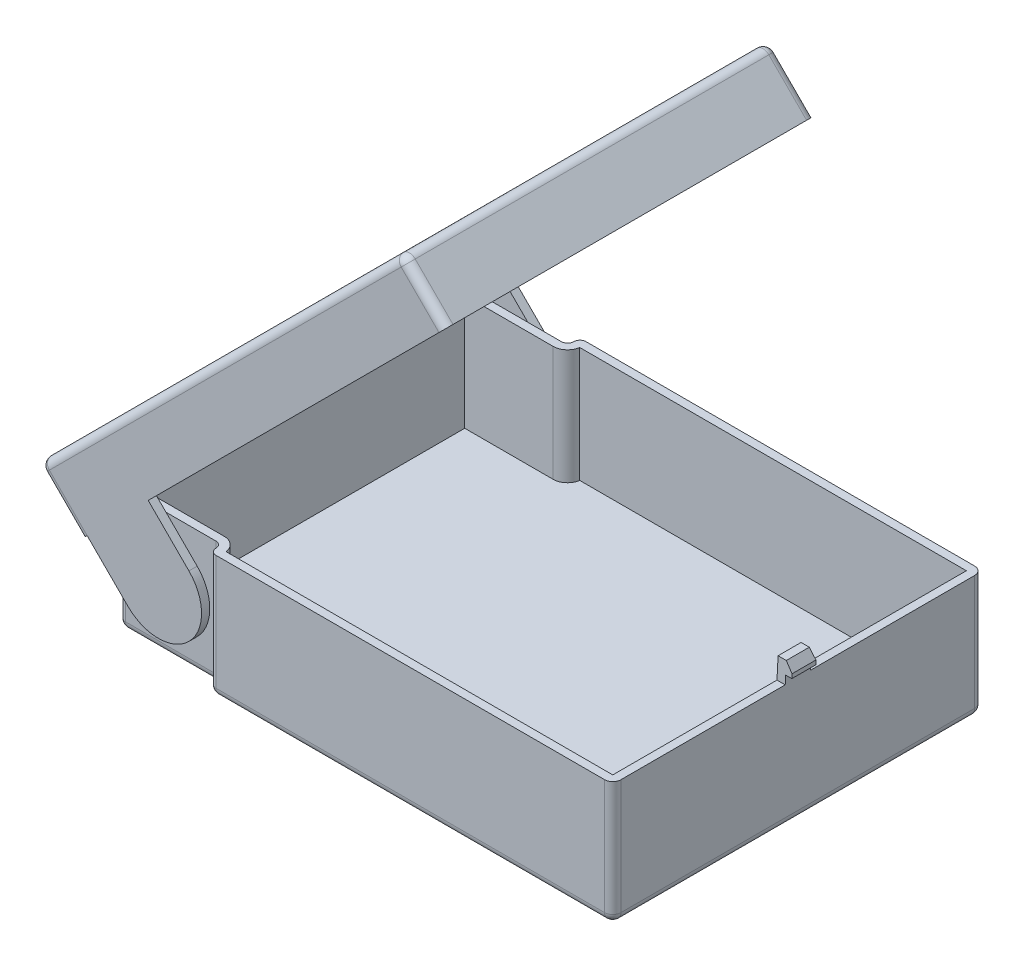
ISO-10303-21;
HEADER;
FILE_DESCRIPTION(('STEP AP214'),'2;1');
FILE_NAME('part.step','',(''),(''),'','','');
FILE_SCHEMA(('AUTOMOTIVE_DESIGN { 1 0 10303 214 1 1 1 1 }'));
ENDSEC;
DATA;
#1=APPLICATION_CONTEXT('core data for automotive mechanical design processes');
#2=APPLICATION_PROTOCOL_DEFINITION('international standard','automotive_design',2000,#1);
#3=PRODUCT_CONTEXT('',#1,'mechanical');
#4=PRODUCT('Part','Part','',(#3));
#5=PRODUCT_RELATED_PRODUCT_CATEGORY('part','',(#4));
#6=PRODUCT_DEFINITION_FORMATION('','',#4);
#7=PRODUCT_DEFINITION_CONTEXT('part definition',#1,'design');
#8=PRODUCT_DEFINITION('design','',#6,#7);
#9=PRODUCT_DEFINITION_SHAPE('','',#8);
#10=(LENGTH_UNIT() NAMED_UNIT(*) SI_UNIT(.MILLI.,.METRE.));
#11=(NAMED_UNIT(*) PLANE_ANGLE_UNIT() SI_UNIT($,.RADIAN.));
#12=(NAMED_UNIT(*) SI_UNIT($,.STERADIAN.) SOLID_ANGLE_UNIT());
#13=UNCERTAINTY_MEASURE_WITH_UNIT(LENGTH_MEASURE(1.E-05),#10,'distance_accuracy_value','');
#14=(GEOMETRIC_REPRESENTATION_CONTEXT(3) GLOBAL_UNCERTAINTY_ASSIGNED_CONTEXT((#13)) GLOBAL_UNIT_ASSIGNED_CONTEXT((#10,
#11,#12)) REPRESENTATION_CONTEXT('',''));
#15=CARTESIAN_POINT('',(0.,0.,0.));
#16=DIRECTION('',(0.,0.,1.));
#17=DIRECTION('',(1.,0.,0.));
#18=AXIS2_PLACEMENT_3D('',#15,#16,#17);
#19=CARTESIAN_POINT('',(20.6500179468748,105.449007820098,-45.));
#20=DIRECTION('',(-0.707106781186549,0.707106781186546,0.));
#21=DIRECTION('',(0.,0.,1.));
#22=AXIS2_PLACEMENT_3D('',#19,#20,#21);
#23=PLANE('',#22);
#24=DIRECTION('',(0.,0.,-1.));
#25=VECTOR('',#24,1.);
#26=CARTESIAN_POINT('',(-66.3241161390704,18.4748737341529,-43.));
#27=LINE('',#26,#25);
#28=CARTESIAN_POINT('',(-66.3241161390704,18.4748737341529,-43.));
#29=VERTEX_POINT('',#28);
#30=CARTESIAN_POINT('',(-66.3241161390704,18.4748737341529,-45.));
#31=VERTEX_POINT('',#30);
#32=EDGE_CURVE('E264',#29,#31,#27,.T.);
#33=ORIENTED_EDGE('',*,*,#32,.F.);
#34=DIRECTION('',(0.,0.,1.));
#35=VECTOR('',#34,1.);
#36=CARTESIAN_POINT('',(-66.3241161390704,18.4748737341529,45.));
#37=LINE('',#36,#35);
#38=CARTESIAN_POINT('',(-66.3241161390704,18.4748737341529,43.));
#39=VERTEX_POINT('',#38);
#40=EDGE_CURVE('E329',#29,#39,#37,.T.);
#41=ORIENTED_EDGE('',*,*,#40,.T.);
#42=DIRECTION('',(0.,0.,1.));
#43=VECTOR('',#42,1.);
#44=CARTESIAN_POINT('',(-66.3241161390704,18.4748737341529,43.));
#45=LINE('',#44,#43);
#46=CARTESIAN_POINT('',(-66.3241161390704,18.4748737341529,45.));
#47=VERTEX_POINT('',#46);
#48=EDGE_CURVE('E307',#39,#47,#45,.T.);
#49=ORIENTED_EDGE('',*,*,#48,.T.);
#50=CARTESIAN_POINT('',(-66.3241161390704,18.4748737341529,43.));
#51=DIRECTION('',(-0.707106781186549,0.707106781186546,0.));
#52=DIRECTION('',(0.,0.,1.));
#53=AXIS2_PLACEMENT_3D('',#50,#51,#52);
#54=CIRCLE('',#53,2.);
#55=CARTESIAN_POINT('',(-67.7383297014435,17.0606601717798,43.));
#56=VERTEX_POINT('',#55);
#57=EDGE_CURVE('E378',#47,#56,#54,.F.);
#58=ORIENTED_EDGE('',*,*,#57,.T.);
#59=DIRECTION('',(0.,0.,1.));
#60=VECTOR('',#59,1.);
#61=CARTESIAN_POINT('',(-67.7383297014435,17.0606601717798,45.));
#62=LINE('',#61,#60);
#63=CARTESIAN_POINT('',(-67.7383297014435,17.0606601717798,-43.));
#64=VERTEX_POINT('',#63);
#65=EDGE_CURVE('E361',#64,#56,#62,.T.);
#66=ORIENTED_EDGE('',*,*,#65,.F.);
#67=CARTESIAN_POINT('',(-66.3241161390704,18.4748737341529,-43.));
#68=DIRECTION('',(-0.707106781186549,0.707106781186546,0.));
#69=DIRECTION('',(0.,0.,1.));
#70=AXIS2_PLACEMENT_3D('',#67,#68,#69);
#71=CIRCLE('',#70,2.);
#72=EDGE_CURVE('E380',#64,#31,#71,.F.);
#73=ORIENTED_EDGE('',*,*,#72,.T.);
#74=EDGE_LOOP('',(#33,#41,#49,#58,#66,#73));
#75=FACE_BOUND('',#74,.T.);
#76=ADVANCED_FACE('F52',(#75),#23,.F.);
#77=DIRECTION('',(0.,0.,-1.));
#78=VECTOR('',#77,1.);
#79=CARTESIAN_POINT('',(-51.4748737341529,33.3241161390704,-43.));
#80=LINE('',#79,#78);
#81=CARTESIAN_POINT('',(-51.4748737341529,33.3241161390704,-43.));
#82=VERTEX_POINT('',#81);
#83=CARTESIAN_POINT('',(-51.4748737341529,33.3241161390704,-45.));
#84=VERTEX_POINT('',#83);
#85=EDGE_CURVE('E75',#82,#84,#80,.T.);
#86=ORIENTED_EDGE('',*,*,#85,.T.);
#87=DIRECTION('',(-0.707106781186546,-0.707106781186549,0.));
#88=VECTOR('',#87,1.);
#89=CARTESIAN_POINT('',(-67.7383297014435,17.0606601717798,-45.));
#90=LINE('',#89,#88);
#91=CARTESIAN_POINT('',(19.2358043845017,104.034794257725,-45.));
#92=VERTEX_POINT('',#91);
#93=EDGE_CURVE('E359',#92,#84,#90,.T.);
#94=ORIENTED_EDGE('',*,*,#93,.F.);
#95=CARTESIAN_POINT('',(19.2358043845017,104.034794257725,-43.));
#96=DIRECTION('',(-0.707106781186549,0.707106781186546,0.));
#97=DIRECTION('',(0.,0.,1.));
#98=AXIS2_PLACEMENT_3D('',#95,#96,#97);
#99=CIRCLE('',#98,2.);
#100=CARTESIAN_POINT('',(20.6500179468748,105.449007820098,-43.));
#101=VERTEX_POINT('',#100);
#102=EDGE_CURVE('E376',#92,#101,#99,.F.);
#103=ORIENTED_EDGE('',*,*,#102,.T.);
#104=DIRECTION('',(0.,0.,-1.));
#105=VECTOR('',#104,1.);
#106=CARTESIAN_POINT('',(20.6500179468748,105.449007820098,45.));
#107=LINE('',#106,#105);
#108=CARTESIAN_POINT('',(20.6500179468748,105.449007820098,43.));
#109=VERTEX_POINT('',#108);
#110=EDGE_CURVE('E365',#109,#101,#107,.T.);
#111=ORIENTED_EDGE('',*,*,#110,.F.);
#112=CARTESIAN_POINT('',(19.2358043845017,104.034794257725,43.));
#113=DIRECTION('',(-0.707106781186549,0.707106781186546,0.));
#114=DIRECTION('',(0.,0.,1.));
#115=AXIS2_PLACEMENT_3D('',#112,#113,#114);
#116=CIRCLE('',#115,2.);
#117=CARTESIAN_POINT('',(19.2358043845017,104.034794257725,45.));
#118=VERTEX_POINT('',#117);
#119=EDGE_CURVE('E373',#109,#118,#116,.F.);
#120=ORIENTED_EDGE('',*,*,#119,.T.);
#121=DIRECTION('',(0.707106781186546,0.707106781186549,0.));
#122=VECTOR('',#121,1.);
#123=CARTESIAN_POINT('',(-67.7383297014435,17.0606601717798,45.));
#124=LINE('',#123,#122);
#125=CARTESIAN_POINT('',(-51.4748737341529,33.3241161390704,45.));
#126=VERTEX_POINT('',#125);
#127=EDGE_CURVE('E303',#126,#118,#124,.T.);
#128=ORIENTED_EDGE('',*,*,#127,.F.);
#129=DIRECTION('',(0.,0.,1.));
#130=VECTOR('',#129,1.);
#131=CARTESIAN_POINT('',(-51.4748737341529,33.3241161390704,43.));
#132=LINE('',#131,#130);
#133=CARTESIAN_POINT('',(-51.4748737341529,33.3241161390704,43.));
#134=VERTEX_POINT('',#133);
#135=EDGE_CURVE('E299',#134,#126,#132,.T.);
#136=ORIENTED_EDGE('',*,*,#135,.F.);
#137=DIRECTION('',(0.707106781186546,0.707106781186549,0.));
#138=VECTOR('',#137,1.);
#139=CARTESIAN_POINT('',(-67.7383297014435,17.0606601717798,43.));
#140=LINE('',#139,#138);
#141=CARTESIAN_POINT('',(19.2358043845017,104.034794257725,43.));
#142=VERTEX_POINT('',#141);
#143=EDGE_CURVE('E326',#134,#142,#140,.T.);
#144=ORIENTED_EDGE('',*,*,#143,.T.);
#145=DIRECTION('',(0.,0.,-1.));
#146=VECTOR('',#145,1.);
#147=CARTESIAN_POINT('',(19.2358043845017,104.034794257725,45.));
#148=LINE('',#147,#146);
#149=CARTESIAN_POINT('',(19.2358043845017,104.034794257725,-43.));
#150=VERTEX_POINT('',#149);
#151=EDGE_CURVE('E328',#142,#150,#148,.T.);
#152=ORIENTED_EDGE('',*,*,#151,.T.);
#153=DIRECTION('',(-0.707106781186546,-0.707106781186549,0.));
#154=VECTOR('',#153,1.);
#155=CARTESIAN_POINT('',(-67.7383297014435,17.0606601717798,-43.));
#156=LINE('',#155,#154);
#157=EDGE_CURVE('E302',#150,#82,#156,.T.);
#158=ORIENTED_EDGE('',*,*,#157,.T.);
#159=EDGE_LOOP('',(#86,#94,#103,#111,#120,#128,#136,#144,#152,#158));
#160=FACE_BOUND('',#159,.T.);
#161=ADVANCED_FACE('F476',(#160),#23,.F.);
#162=CARTESIAN_POINT('',(-78.3449314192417,27.667261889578,-45.));
#163=DIRECTION('',(0.,0.,1.));
#164=DIRECTION('',(0.707106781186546,0.707106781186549,0.));
#165=AXIS2_PLACEMENT_3D('',#162,#163,#164);
#166=PLANE('',#165);
#167=DIRECTION('',(0.707106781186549,-0.707106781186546,0.));
#168=VECTOR('',#167,1.);
#169=CARTESIAN_POINT('',(-76.9307178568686,29.0814754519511,-45.));
#170=LINE('',#169,#168);
#171=CARTESIAN_POINT('',(-75.5165042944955,27.667261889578,-45.));
#172=VERTEX_POINT('',#171);
#173=EDGE_CURVE('E384',#31,#172,#170,.F.);
#174=ORIENTED_EDGE('',*,*,#173,.T.);
#175=DIRECTION('',(-0.707106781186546,-0.707106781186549,0.));
#176=VECTOR('',#175,1.);
#177=CARTESIAN_POINT('',(10.0434162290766,113.22718241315,-45.));
#178=LINE('',#177,#176);
#179=CARTESIAN_POINT('',(10.0434162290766,113.22718241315,-45.));
#180=VERTEX_POINT('',#179);
#181=EDGE_CURVE('E412',#172,#180,#178,.F.);
#182=ORIENTED_EDGE('',*,*,#181,.T.);
#183=DIRECTION('',(0.707106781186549,-0.707106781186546,0.));
#184=VECTOR('',#183,1.);
#185=CARTESIAN_POINT('',(8.62920266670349,114.641395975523,-45.));
#186=LINE('',#185,#184);
#187=EDGE_CURVE('E382',#180,#92,#186,.T.);
#188=ORIENTED_EDGE('',*,*,#187,.T.);
#189=ORIENTED_EDGE('',*,*,#93,.T.);
#190=DIRECTION('',(-0.707106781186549,0.707106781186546,0.));
#191=VECTOR('',#190,1.);
#192=CARTESIAN_POINT('',(-41.5753787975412,23.4246212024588,-45.));
#193=LINE('',#192,#191);
#194=CARTESIAN_POINT('',(-41.5753787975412,23.4246212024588,-45.));
#195=VERTEX_POINT('',#194);
#196=EDGE_CURVE('E250',#195,#84,#193,.T.);
#197=ORIENTED_EDGE('',*,*,#196,.F.);
#198=CARTESIAN_POINT('',(-49.,16.,-45.));
#199=DIRECTION('',(0.,0.,1.));
#200=DIRECTION('',(0.707106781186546,0.707106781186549,0.));
#201=AXIS2_PLACEMENT_3D('',#198,#199,#200);
#202=CIRCLE('',#201,10.5);
#203=CARTESIAN_POINT('',(-56.4246212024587,8.57537879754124,-45.));
#204=VERTEX_POINT('',#203);
#205=EDGE_CURVE('E253',#204,#195,#202,.T.);
#206=ORIENTED_EDGE('',*,*,#205,.F.);
#207=DIRECTION('',(0.707106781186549,-0.707106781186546,0.));
#208=VECTOR('',#207,1.);
#209=CARTESIAN_POINT('',(-66.3241161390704,18.4748737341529,-45.));
#210=LINE('',#209,#208);
#211=EDGE_CURVE('E255',#31,#204,#210,.T.);
#212=ORIENTED_EDGE('',*,*,#211,.F.);
#213=EDGE_LOOP('',(#174,#182,#188,#189,#197,#206,#212));
#214=FACE_BOUND('',#213,.T.);
#215=ADVANCED_FACE('F54',(#214),#166,.F.);
#216=CARTESIAN_POINT('',(-78.3449314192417,27.667261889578,45.));
#217=DIRECTION('',(0.707106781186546,0.707106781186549,0.));
#218=DIRECTION('',(0.,0.,-1.));
#219=AXIS2_PLACEMENT_3D('',#216,#217,#218);
#220=PLANE('',#219);
#221=DIRECTION('',(0.707106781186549,-0.707106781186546,0.));
#222=VECTOR('',#221,1.);
#223=CARTESIAN_POINT('',(-78.3449314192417,27.667261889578,43.));
#224=LINE('',#223,#222);
#225=CARTESIAN_POINT('',(-76.9307178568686,26.2530483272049,43.));
#226=VERTEX_POINT('',#225);
#227=EDGE_CURVE('E368',#56,#226,#224,.F.);
#228=ORIENTED_EDGE('',*,*,#227,.T.);
#229=DIRECTION('',(0.,0.,1.));
#230=VECTOR('',#229,1.);
#231=CARTESIAN_POINT('',(-76.9307178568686,26.2530483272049,-43.));
#232=LINE('',#231,#230);
#233=CARTESIAN_POINT('',(-76.9307178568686,26.2530483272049,-43.));
#234=VERTEX_POINT('',#233);
#235=EDGE_CURVE('E408',#226,#234,#232,.F.);
#236=ORIENTED_EDGE('',*,*,#235,.T.);
#237=DIRECTION('',(0.707106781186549,-0.707106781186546,0.));
#238=VECTOR('',#237,1.);
#239=CARTESIAN_POINT('',(-78.3449314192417,27.667261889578,-43.));
#240=LINE('',#239,#238);
#241=EDGE_CURVE('E371',#234,#64,#240,.T.);
#242=ORIENTED_EDGE('',*,*,#241,.T.);
#243=ORIENTED_EDGE('',*,*,#65,.T.);
#244=EDGE_LOOP('',(#228,#236,#242,#243));
#245=FACE_BOUND('',#244,.T.);
#246=ADVANCED_FACE('F453',(#245),#220,.F.);
#247=CARTESIAN_POINT('',(-78.3449314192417,27.667261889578,45.));
#248=DIRECTION('',(0.,0.,-1.));
#249=DIRECTION('',(-0.707106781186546,-0.707106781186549,0.));
#250=AXIS2_PLACEMENT_3D('',#247,#248,#249);
#251=PLANE('',#250);
#252=DIRECTION('',(0.707106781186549,-0.707106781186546,0.));
#253=VECTOR('',#252,1.);
#254=CARTESIAN_POINT('',(8.62920266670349,114.641395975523,45.));
#255=LINE('',#254,#253);
#256=CARTESIAN_POINT('',(10.0434162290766,113.22718241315,45.));
#257=VERTEX_POINT('',#256);
#258=EDGE_CURVE('E387',#118,#257,#255,.F.);
#259=ORIENTED_EDGE('',*,*,#258,.T.);
#260=DIRECTION('',(0.707106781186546,0.707106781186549,0.));
#261=VECTOR('',#260,1.);
#262=CARTESIAN_POINT('',(-75.5165042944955,27.667261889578,45.));
#263=LINE('',#262,#261);
#264=CARTESIAN_POINT('',(-75.5165042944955,27.667261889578,45.));
#265=VERTEX_POINT('',#264);
#266=EDGE_CURVE('E315',#257,#265,#263,.F.);
#267=ORIENTED_EDGE('',*,*,#266,.T.);
#268=DIRECTION('',(0.707106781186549,-0.707106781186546,0.));
#269=VECTOR('',#268,1.);
#270=CARTESIAN_POINT('',(-76.9307178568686,29.0814754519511,45.));
#271=LINE('',#270,#269);
#272=EDGE_CURVE('E389',#265,#47,#271,.T.);
#273=ORIENTED_EDGE('',*,*,#272,.T.);
#274=DIRECTION('',(0.707106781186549,-0.707106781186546,0.));
#275=VECTOR('',#274,1.);
#276=CARTESIAN_POINT('',(-66.3241161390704,18.4748737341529,45.));
#277=LINE('',#276,#275);
#278=CARTESIAN_POINT('',(-56.4246212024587,8.57537879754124,45.));
#279=VERTEX_POINT('',#278);
#280=EDGE_CURVE('E280',#47,#279,#277,.T.);
#281=ORIENTED_EDGE('',*,*,#280,.T.);
#282=CARTESIAN_POINT('',(-49.,16.,45.));
#283=DIRECTION('',(0.,0.,1.));
#284=DIRECTION('',(0.707106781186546,0.707106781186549,0.));
#285=AXIS2_PLACEMENT_3D('',#282,#283,#284);
#286=CIRCLE('',#285,10.5);
#287=CARTESIAN_POINT('',(-41.5753787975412,23.4246212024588,45.));
#288=VERTEX_POINT('',#287);
#289=EDGE_CURVE('E283',#279,#288,#286,.T.);
#290=ORIENTED_EDGE('',*,*,#289,.T.);
#291=DIRECTION('',(-0.707106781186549,0.707106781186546,0.));
#292=VECTOR('',#291,1.);
#293=CARTESIAN_POINT('',(-41.5753787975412,23.4246212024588,45.));
#294=LINE('',#293,#292);
#295=EDGE_CURVE('E286',#288,#126,#294,.T.);
#296=ORIENTED_EDGE('',*,*,#295,.T.);
#297=ORIENTED_EDGE('',*,*,#127,.T.);
#298=EDGE_LOOP('',(#259,#267,#273,#281,#290,#296,#297));
#299=FACE_BOUND('',#298,.T.);
#300=ADVANCED_FACE('F464',(#299),#251,.F.);
#301=CARTESIAN_POINT('',(10.0434162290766,116.055609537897,45.));
#302=DIRECTION('',(-0.707106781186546,-0.707106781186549,0.));
#303=DIRECTION('',(0.,0.,1.));
#304=AXIS2_PLACEMENT_3D('',#301,#302,#303);
#305=PLANE('',#304);
#306=DIRECTION('',(0.707106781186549,-0.707106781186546,0.));
#307=VECTOR('',#306,1.);
#308=CARTESIAN_POINT('',(10.0434162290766,116.055609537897,-43.));
#309=LINE('',#308,#307);
#310=CARTESIAN_POINT('',(11.4576297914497,114.641395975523,-43.));
#311=VERTEX_POINT('',#310);
#312=EDGE_CURVE('E393',#101,#311,#309,.F.);
#313=ORIENTED_EDGE('',*,*,#312,.T.);
#314=DIRECTION('',(0.,0.,-1.));
#315=VECTOR('',#314,1.);
#316=CARTESIAN_POINT('',(11.4576297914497,114.641395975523,43.));
#317=LINE('',#316,#315);
#318=CARTESIAN_POINT('',(11.4576297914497,114.641395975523,43.));
#319=VERTEX_POINT('',#318);
#320=EDGE_CURVE('E323',#311,#319,#317,.F.);
#321=ORIENTED_EDGE('',*,*,#320,.T.);
#322=DIRECTION('',(0.707106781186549,-0.707106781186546,0.));
#323=VECTOR('',#322,1.);
#324=CARTESIAN_POINT('',(10.0434162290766,116.055609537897,43.));
#325=LINE('',#324,#323);
#326=EDGE_CURVE('E391',#319,#109,#325,.T.);
#327=ORIENTED_EDGE('',*,*,#326,.T.);
#328=ORIENTED_EDGE('',*,*,#110,.T.);
#329=EDGE_LOOP('',(#313,#321,#327,#328));
#330=FACE_BOUND('',#329,.T.);
#331=ADVANCED_FACE('F418',(#330),#305,.F.);
#332=CARTESIAN_POINT('',(10.0434162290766,116.055609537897,-45.));
#333=DIRECTION('',(-0.707106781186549,0.707106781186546,0.));
#334=DIRECTION('',(0.,0.,1.));
#335=AXIS2_PLACEMENT_3D('',#332,#333,#334);
#336=PLANE('',#335);
#337=DIRECTION('',(-0.707106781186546,-0.707106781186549,0.));
#338=VECTOR('',#337,1.);
#339=CARTESIAN_POINT('',(-76.9307178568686,29.0814754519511,-43.));
#340=LINE('',#339,#338);
#341=CARTESIAN_POINT('',(8.62920266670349,114.641395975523,-43.));
#342=VERTEX_POINT('',#341);
#343=CARTESIAN_POINT('',(-76.9307178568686,29.0814754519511,-43.));
#344=VERTEX_POINT('',#343);
#345=EDGE_CURVE('E403',#342,#344,#340,.T.);
#346=ORIENTED_EDGE('',*,*,#345,.T.);
#347=DIRECTION('',(0.,0.,1.));
#348=VECTOR('',#347,1.);
#349=CARTESIAN_POINT('',(-76.9307178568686,29.0814754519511,43.));
#350=LINE('',#349,#348);
#351=CARTESIAN_POINT('',(-76.9307178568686,29.0814754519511,43.));
#352=VERTEX_POINT('',#351);
#353=EDGE_CURVE('E405',#344,#352,#350,.T.);
#354=ORIENTED_EDGE('',*,*,#353,.T.);
#355=DIRECTION('',(0.707106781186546,0.707106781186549,0.));
#356=VECTOR('',#355,1.);
#357=CARTESIAN_POINT('',(8.62920266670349,114.641395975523,43.));
#358=LINE('',#357,#356);
#359=CARTESIAN_POINT('',(8.62920266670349,114.641395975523,43.));
#360=VERTEX_POINT('',#359);
#361=EDGE_CURVE('E399',#352,#360,#358,.T.);
#362=ORIENTED_EDGE('',*,*,#361,.T.);
#363=DIRECTION('',(0.,0.,-1.));
#364=VECTOR('',#363,1.);
#365=CARTESIAN_POINT('',(8.62920266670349,114.641395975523,-43.));
#366=LINE('',#365,#364);
#367=EDGE_CURVE('E401',#360,#342,#366,.T.);
#368=ORIENTED_EDGE('',*,*,#367,.T.);
#369=EDGE_LOOP('',(#346,#354,#362,#368));
#370=FACE_BOUND('',#369,.T.);
#371=ADVANCED_FACE('F492',(#370),#336,.T.);
#372=CARTESIAN_POINT('',(-76.9307178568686,29.0814754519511,-43.));
#373=DIRECTION('',(0.707106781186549,-0.707106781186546,0.));
#374=DIRECTION('',(0.,0.,-1.));
#375=AXIS2_PLACEMENT_3D('',#372,#373,#374);
#376=CYLINDRICAL_SURFACE('',#375,2.);
#377=ORIENTED_EDGE('',*,*,#241,.F.);
#378=CARTESIAN_POINT('',(-75.5165042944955,27.667261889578,-43.));
#379=DIRECTION('',(0.707106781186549,-0.707106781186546,0.));
#380=DIRECTION('',(0.,0.,-1.));
#381=AXIS2_PLACEMENT_3D('',#378,#379,#380);
#382=CIRCLE('',#381,2.);
#383=EDGE_CURVE('E410',#234,#172,#382,.T.);
#384=ORIENTED_EDGE('',*,*,#383,.T.);
#385=ORIENTED_EDGE('',*,*,#173,.F.);
#386=ORIENTED_EDGE('',*,*,#72,.F.);
#387=EDGE_LOOP('',(#377,#384,#385,#386));
#388=FACE_BOUND('',#387,.T.);
#389=ADVANCED_FACE('F494',(#388),#376,.T.);
#390=CARTESIAN_POINT('',(-76.9307178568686,29.0814754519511,43.));
#391=DIRECTION('',(0.707106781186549,-0.707106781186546,0.));
#392=DIRECTION('',(0.,0.,-1.));
#393=AXIS2_PLACEMENT_3D('',#390,#391,#392);
#394=CYLINDRICAL_SURFACE('',#393,2.);
#395=ORIENTED_EDGE('',*,*,#272,.F.);
#396=CARTESIAN_POINT('',(-75.5165042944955,27.667261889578,43.));
#397=DIRECTION('',(0.707106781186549,-0.707106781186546,0.));
#398=DIRECTION('',(0.,0.,-1.));
#399=AXIS2_PLACEMENT_3D('',#396,#397,#398);
#400=CIRCLE('',#399,2.);
#401=EDGE_CURVE('E396',#265,#226,#400,.T.);
#402=ORIENTED_EDGE('',*,*,#401,.T.);
#403=ORIENTED_EDGE('',*,*,#227,.F.);
#404=ORIENTED_EDGE('',*,*,#57,.F.);
#405=EDGE_LOOP('',(#395,#402,#403,#404));
#406=FACE_BOUND('',#405,.T.);
#407=ADVANCED_FACE('F451',(#406),#394,.T.);
#408=CARTESIAN_POINT('',(8.62920266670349,114.641395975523,-43.));
#409=DIRECTION('',(0.707106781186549,-0.707106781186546,0.));
#410=DIRECTION('',(0.,0.,-1.));
#411=AXIS2_PLACEMENT_3D('',#408,#409,#410);
#412=CYLINDRICAL_SURFACE('',#411,2.);
#413=ORIENTED_EDGE('',*,*,#187,.F.);
#414=CARTESIAN_POINT('',(10.0434162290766,113.22718241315,-43.));
#415=DIRECTION('',(0.707106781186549,-0.707106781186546,0.));
#416=DIRECTION('',(0.,0.,-1.));
#417=AXIS2_PLACEMENT_3D('',#414,#415,#416);
#418=CIRCLE('',#417,2.);
#419=EDGE_CURVE('E414',#180,#311,#418,.T.);
#420=ORIENTED_EDGE('',*,*,#419,.T.);
#421=ORIENTED_EDGE('',*,*,#312,.F.);
#422=ORIENTED_EDGE('',*,*,#102,.F.);
#423=EDGE_LOOP('',(#413,#420,#421,#422));
#424=FACE_BOUND('',#423,.T.);
#425=ADVANCED_FACE('F481',(#424),#412,.T.);
#426=CARTESIAN_POINT('',(8.62920266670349,114.641395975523,43.));
#427=DIRECTION('',(0.707106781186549,-0.707106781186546,0.));
#428=DIRECTION('',(0.,0.,-1.));
#429=AXIS2_PLACEMENT_3D('',#426,#427,#428);
#430=CYLINDRICAL_SURFACE('',#429,2.);
#431=ORIENTED_EDGE('',*,*,#326,.F.);
#432=CARTESIAN_POINT('',(10.0434162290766,113.22718241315,43.));
#433=DIRECTION('',(0.707106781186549,-0.707106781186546,0.));
#434=DIRECTION('',(0.,0.,-1.));
#435=AXIS2_PLACEMENT_3D('',#432,#433,#434);
#436=CIRCLE('',#435,2.);
#437=EDGE_CURVE('E316',#319,#257,#436,.T.);
#438=ORIENTED_EDGE('',*,*,#437,.T.);
#439=ORIENTED_EDGE('',*,*,#258,.F.);
#440=ORIENTED_EDGE('',*,*,#119,.F.);
#441=EDGE_LOOP('',(#431,#438,#439,#440));
#442=FACE_BOUND('',#441,.T.);
#443=ADVANCED_FACE('F425',(#442),#430,.T.);
#444=CARTESIAN_POINT('',(10.0434162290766,113.22718241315,-43.));
#445=DIRECTION('',(0.,0.,1.));
#446=DIRECTION('',(0.707106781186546,0.707106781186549,0.));
#447=AXIS2_PLACEMENT_3D('',#444,#445,#446);
#448=SPHERICAL_SURFACE('',#447,2.);
#449=CARTESIAN_POINT('',(10.0434162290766,113.22718241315,-43.));
#450=DIRECTION('',(0.,0.,1.));
#451=DIRECTION('',(0.707106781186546,0.707106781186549,0.));
#452=AXIS2_PLACEMENT_3D('',#449,#450,#451);
#453=CIRCLE('',#452,2.);
#454=EDGE_CURVE('E353',#311,#342,#453,.T.);
#455=ORIENTED_EDGE('',*,*,#454,.F.);
#456=ORIENTED_EDGE('',*,*,#419,.F.);
#457=CARTESIAN_POINT('',(10.0434162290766,113.22718241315,-43.));
#458=DIRECTION('',(-0.707106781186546,-0.707106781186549,0.));
#459=DIRECTION('',(0.,0.,1.));
#460=AXIS2_PLACEMENT_3D('',#457,#458,#459);
#461=CIRCLE('',#460,2.);
#462=EDGE_CURVE('E356',#342,#180,#461,.T.);
#463=ORIENTED_EDGE('',*,*,#462,.F.);
#464=EDGE_LOOP('',(#455,#456,#463));
#465=FACE_BOUND('',#464,.T.);
#466=ADVANCED_FACE('F485',(#465),#448,.T.);
#467=CARTESIAN_POINT('',(11.4576297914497,114.641395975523,-43.));
#468=DIRECTION('',(0.707106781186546,0.707106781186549,0.));
#469=DIRECTION('',(0.,0.,-1.));
#470=AXIS2_PLACEMENT_3D('',#467,#468,#469);
#471=CYLINDRICAL_SURFACE('',#470,2.);
#472=ORIENTED_EDGE('',*,*,#462,.T.);
#473=ORIENTED_EDGE('',*,*,#181,.F.);
#474=CARTESIAN_POINT('',(-75.5165042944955,27.667261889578,-43.));
#475=DIRECTION('',(-0.707106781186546,-0.707106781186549,0.));
#476=DIRECTION('',(0.,0.,1.));
#477=AXIS2_PLACEMENT_3D('',#474,#475,#476);
#478=CIRCLE('',#477,2.);
#479=EDGE_CURVE('E350',#344,#172,#478,.T.);
#480=ORIENTED_EDGE('',*,*,#479,.F.);
#481=ORIENTED_EDGE('',*,*,#345,.F.);
#482=EDGE_LOOP('',(#472,#473,#480,#481));
#483=FACE_BOUND('',#482,.T.);
#484=ADVANCED_FACE('F489',(#483),#471,.T.);
#485=CARTESIAN_POINT('',(10.0434162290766,113.22718241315,-45.));
#486=DIRECTION('',(0.,0.,1.));
#487=DIRECTION('',(0.707106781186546,0.707106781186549,0.));
#488=AXIS2_PLACEMENT_3D('',#485,#486,#487);
#489=CYLINDRICAL_SURFACE('',#488,2.);
#490=ORIENTED_EDGE('',*,*,#454,.T.);
#491=ORIENTED_EDGE('',*,*,#367,.F.);
#492=CARTESIAN_POINT('',(10.0434162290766,113.22718241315,43.));
#493=DIRECTION('',(0.,0.,1.));
#494=DIRECTION('',(0.707106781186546,0.707106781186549,0.));
#495=AXIS2_PLACEMENT_3D('',#492,#493,#494);
#496=CIRCLE('',#495,2.);
#497=EDGE_CURVE('E347',#319,#360,#496,.T.);
#498=ORIENTED_EDGE('',*,*,#497,.F.);
#499=ORIENTED_EDGE('',*,*,#320,.F.);
#500=EDGE_LOOP('',(#490,#491,#498,#499));
#501=FACE_BOUND('',#500,.T.);
#502=ADVANCED_FACE('F430',(#501),#489,.T.);
#503=CARTESIAN_POINT('',(-75.5165042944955,27.667261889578,-43.));
#504=DIRECTION('',(0.,0.,1.));
#505=DIRECTION('',(0.707106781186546,0.707106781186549,0.));
#506=AXIS2_PLACEMENT_3D('',#503,#504,#505);
#507=SPHERICAL_SURFACE('',#506,2.);
#508=ORIENTED_EDGE('',*,*,#479,.T.);
#509=ORIENTED_EDGE('',*,*,#383,.F.);
#510=CARTESIAN_POINT('',(-75.5165042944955,27.667261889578,-43.));
#511=DIRECTION('',(0.,0.,1.));
#512=DIRECTION('',(0.707106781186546,0.707106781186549,0.));
#513=AXIS2_PLACEMENT_3D('',#510,#511,#512);
#514=CIRCLE('',#513,2.);
#515=EDGE_CURVE('E344',#344,#234,#514,.T.);
#516=ORIENTED_EDGE('',*,*,#515,.F.);
#517=EDGE_LOOP('',(#508,#509,#516));
#518=FACE_BOUND('',#517,.T.);
#519=ADVANCED_FACE('F521',(#518),#507,.T.);
#520=CARTESIAN_POINT('',(10.0434162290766,113.22718241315,43.));
#521=DIRECTION('',(0.,0.,1.));
#522=DIRECTION('',(0.707106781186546,0.707106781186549,0.));
#523=AXIS2_PLACEMENT_3D('',#520,#521,#522);
#524=SPHERICAL_SURFACE('',#523,2.);
#525=ORIENTED_EDGE('',*,*,#437,.F.);
#526=ORIENTED_EDGE('',*,*,#497,.T.);
#527=CARTESIAN_POINT('',(10.0434162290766,113.22718241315,43.));
#528=DIRECTION('',(-0.707106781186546,-0.707106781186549,0.));
#529=DIRECTION('',(0.,0.,1.));
#530=AXIS2_PLACEMENT_3D('',#527,#528,#529);
#531=CIRCLE('',#530,2.);
#532=EDGE_CURVE('E341',#257,#360,#531,.T.);
#533=ORIENTED_EDGE('',*,*,#532,.F.);
#534=EDGE_LOOP('',(#525,#526,#533));
#535=FACE_BOUND('',#534,.T.);
#536=ADVANCED_FACE('F433',(#535),#524,.T.);
#537=CARTESIAN_POINT('',(-75.5165042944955,27.667261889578,-45.));
#538=DIRECTION('',(0.,0.,-1.));
#539=DIRECTION('',(-0.707106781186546,-0.707106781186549,0.));
#540=AXIS2_PLACEMENT_3D('',#537,#538,#539);
#541=CYLINDRICAL_SURFACE('',#540,2.);
#542=ORIENTED_EDGE('',*,*,#515,.T.);
#543=ORIENTED_EDGE('',*,*,#235,.F.);
#544=CARTESIAN_POINT('',(-75.5165042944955,27.667261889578,43.));
#545=DIRECTION('',(0.,0.,1.));
#546=DIRECTION('',(0.707106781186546,0.707106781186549,0.));
#547=AXIS2_PLACEMENT_3D('',#544,#545,#546);
#548=CIRCLE('',#547,2.);
#549=EDGE_CURVE('E338',#352,#226,#548,.T.);
#550=ORIENTED_EDGE('',*,*,#549,.F.);
#551=ORIENTED_EDGE('',*,*,#353,.F.);
#552=EDGE_LOOP('',(#542,#543,#550,#551));
#553=FACE_BOUND('',#552,.T.);
#554=ADVANCED_FACE('F445',(#553),#541,.T.);
#555=CARTESIAN_POINT('',(11.4576297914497,114.641395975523,43.));
#556=DIRECTION('',(-0.707106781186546,-0.707106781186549,0.));
#557=DIRECTION('',(0.,0.,1.));
#558=AXIS2_PLACEMENT_3D('',#555,#556,#557);
#559=CYLINDRICAL_SURFACE('',#558,2.);
#560=ORIENTED_EDGE('',*,*,#532,.T.);
#561=ORIENTED_EDGE('',*,*,#361,.F.);
#562=CARTESIAN_POINT('',(-75.5165042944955,27.667261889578,43.));
#563=DIRECTION('',(-0.707106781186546,-0.707106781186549,0.));
#564=DIRECTION('',(0.,0.,1.));
#565=AXIS2_PLACEMENT_3D('',#562,#563,#564);
#566=CIRCLE('',#565,2.);
#567=EDGE_CURVE('E336',#265,#352,#566,.T.);
#568=ORIENTED_EDGE('',*,*,#567,.F.);
#569=ORIENTED_EDGE('',*,*,#266,.F.);
#570=EDGE_LOOP('',(#560,#561,#568,#569));
#571=FACE_BOUND('',#570,.T.);
#572=ADVANCED_FACE('F437',(#571),#559,.T.);
#573=CARTESIAN_POINT('',(-75.5165042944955,27.667261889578,43.));
#574=DIRECTION('',(0.,0.,1.));
#575=DIRECTION('',(0.707106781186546,0.707106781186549,0.));
#576=AXIS2_PLACEMENT_3D('',#573,#574,#575);
#577=SPHERICAL_SURFACE('',#576,2.);
#578=ORIENTED_EDGE('',*,*,#549,.T.);
#579=ORIENTED_EDGE('',*,*,#401,.F.);
#580=ORIENTED_EDGE('',*,*,#567,.T.);
#581=EDGE_LOOP('',(#578,#579,#580));
#582=FACE_BOUND('',#581,.T.);
#583=ADVANCED_FACE('F441',(#582),#577,.T.);
#584=CARTESIAN_POINT('',(-78.3449314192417,27.667261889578,-43.));
#585=DIRECTION('',(0.,0.,1.));
#586=DIRECTION('',(0.707106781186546,0.707106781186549,0.));
#587=AXIS2_PLACEMENT_3D('',#584,#585,#586);
#588=PLANE('',#587);
#589=CARTESIAN_POINT('',(-49.,16.,-43.));
#590=DIRECTION('',(0.,0.,1.));
#591=DIRECTION('',(0.707106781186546,0.707106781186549,0.));
#592=AXIS2_PLACEMENT_3D('',#589,#590,#591);
#593=CIRCLE('',#592,1.25000000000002);
#594=CARTESIAN_POINT('',(-48.1161165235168,16.8838834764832,-43.));
#595=VERTEX_POINT('',#594);
#596=EDGE_CURVE('E241',#595,#595,#593,.T.);
#597=ORIENTED_EDGE('',*,*,#596,.F.);
#598=EDGE_LOOP('',(#597));
#599=FACE_BOUND('',#598,.T.);
#600=DIRECTION('',(-0.707106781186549,0.707106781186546,0.));
#601=VECTOR('',#600,1.);
#602=CARTESIAN_POINT('',(-76.9307178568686,29.0814754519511,-43.));
#603=LINE('',#602,#601);
#604=CARTESIAN_POINT('',(-75.5165042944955,27.667261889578,-43.));
#605=VERTEX_POINT('',#604);
#606=EDGE_CURVE('E858',#29,#605,#603,.T.);
#607=ORIENTED_EDGE('',*,*,#606,.F.);
#608=DIRECTION('',(0.707106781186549,-0.707106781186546,0.));
#609=VECTOR('',#608,1.);
#610=CARTESIAN_POINT('',(-66.3241161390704,18.4748737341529,-43.));
#611=LINE('',#610,#609);
#612=CARTESIAN_POINT('',(-56.4246212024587,8.57537879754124,-43.));
#613=VERTEX_POINT('',#612);
#614=EDGE_CURVE('E262',#29,#613,#611,.T.);
#615=ORIENTED_EDGE('',*,*,#614,.T.);
#616=CARTESIAN_POINT('',(-49.,16.,-43.));
#617=DIRECTION('',(0.,0.,1.));
#618=DIRECTION('',(0.707106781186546,0.707106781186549,0.));
#619=AXIS2_PLACEMENT_3D('',#616,#617,#618);
#620=CIRCLE('',#619,10.5);
#621=CARTESIAN_POINT('',(-41.5753787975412,23.4246212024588,-43.));
#622=VERTEX_POINT('',#621);
#623=EDGE_CURVE('E260',#613,#622,#620,.T.);
#624=ORIENTED_EDGE('',*,*,#623,.T.);
#625=DIRECTION('',(-0.707106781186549,0.707106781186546,0.));
#626=VECTOR('',#625,1.);
#627=CARTESIAN_POINT('',(-41.5753787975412,23.4246212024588,-43.));
#628=LINE('',#627,#626);
#629=EDGE_CURVE('E257',#622,#82,#628,.T.);
#630=ORIENTED_EDGE('',*,*,#629,.T.);
#631=ORIENTED_EDGE('',*,*,#157,.F.);
#632=DIRECTION('',(-0.707106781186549,0.707106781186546,0.));
#633=VECTOR('',#632,1.);
#634=CARTESIAN_POINT('',(8.62920266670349,114.641395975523,-43.));
#635=LINE('',#634,#633);
#636=CARTESIAN_POINT('',(10.0434162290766,113.22718241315,-43.));
#637=VERTEX_POINT('',#636);
#638=EDGE_CURVE('E865',#150,#637,#635,.T.);
#639=ORIENTED_EDGE('',*,*,#638,.T.);
#640=DIRECTION('',(0.707106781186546,0.707106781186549,0.));
#641=VECTOR('',#640,1.);
#642=CARTESIAN_POINT('',(11.4576297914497,114.641395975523,-43.));
#643=LINE('',#642,#641);
#644=EDGE_CURVE('E339',#605,#637,#643,.T.);
#645=ORIENTED_EDGE('',*,*,#644,.F.);
#646=EDGE_LOOP('',(#607,#615,#624,#630,#631,#639,#645));
#647=FACE_BOUND('',#646,.T.);
#648=ADVANCED_FACE('F533',(#599,#647),#588,.T.);
#649=CARTESIAN_POINT('',(-76.9307178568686,29.0814754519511,45.));
#650=DIRECTION('',(0.707106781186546,0.707106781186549,0.));
#651=DIRECTION('',(0.,0.,-1.));
#652=AXIS2_PLACEMENT_3D('',#649,#650,#651);
#653=PLANE('',#652);
#654=DIRECTION('',(-0.707106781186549,0.707106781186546,0.));
#655=VECTOR('',#654,1.);
#656=CARTESIAN_POINT('',(-76.9307178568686,29.0814754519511,43.));
#657=LINE('',#656,#655);
#658=CARTESIAN_POINT('',(-75.5165042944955,27.667261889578,43.));
#659=VERTEX_POINT('',#658);
#660=EDGE_CURVE('E863',#39,#659,#657,.T.);
#661=ORIENTED_EDGE('',*,*,#660,.F.);
#662=ORIENTED_EDGE('',*,*,#40,.F.);
#663=ORIENTED_EDGE('',*,*,#606,.T.);
#664=DIRECTION('',(0.,0.,-1.));
#665=VECTOR('',#664,1.);
#666=CARTESIAN_POINT('',(-75.5165042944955,27.667261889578,-45.));
#667=LINE('',#666,#665);
#668=EDGE_CURVE('E871',#659,#605,#667,.T.);
#669=ORIENTED_EDGE('',*,*,#668,.F.);
#670=EDGE_LOOP('',(#661,#662,#663,#669));
#671=FACE_BOUND('',#670,.T.);
#672=ADVANCED_FACE('F545',(#671),#653,.T.);
#673=CARTESIAN_POINT('',(-78.3449314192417,27.667261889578,43.));
#674=DIRECTION('',(0.,0.,-1.));
#675=DIRECTION('',(-0.707106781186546,-0.707106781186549,0.));
#676=AXIS2_PLACEMENT_3D('',#673,#674,#675);
#677=PLANE('',#676);
#678=CARTESIAN_POINT('',(-49.,16.,43.));
#679=DIRECTION('',(0.,0.,-1.));
#680=DIRECTION('',(-0.707106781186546,-0.707106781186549,0.));
#681=AXIS2_PLACEMENT_3D('',#678,#679,#680);
#682=CIRCLE('',#681,1.25000000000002);
#683=CARTESIAN_POINT('',(-49.8838834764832,15.1161165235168,43.));
#684=VERTEX_POINT('',#683);
#685=EDGE_CURVE('E267',#684,#684,#682,.T.);
#686=ORIENTED_EDGE('',*,*,#685,.F.);
#687=EDGE_LOOP('',(#686));
#688=FACE_BOUND('',#687,.T.);
#689=DIRECTION('',(-0.707106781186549,0.707106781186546,0.));
#690=VECTOR('',#689,1.);
#691=CARTESIAN_POINT('',(8.62920266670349,114.641395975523,43.));
#692=LINE('',#691,#690);
#693=CARTESIAN_POINT('',(10.0434162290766,113.22718241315,43.));
#694=VERTEX_POINT('',#693);
#695=EDGE_CURVE('E862',#142,#694,#692,.T.);
#696=ORIENTED_EDGE('',*,*,#695,.F.);
#697=ORIENTED_EDGE('',*,*,#143,.F.);
#698=DIRECTION('',(-0.707106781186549,0.707106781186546,0.));
#699=VECTOR('',#698,1.);
#700=CARTESIAN_POINT('',(-41.5753787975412,23.4246212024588,43.));
#701=LINE('',#700,#699);
#702=CARTESIAN_POINT('',(-41.5753787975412,23.4246212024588,43.));
#703=VERTEX_POINT('',#702);
#704=EDGE_CURVE('E293',#703,#134,#701,.T.);
#705=ORIENTED_EDGE('',*,*,#704,.F.);
#706=CARTESIAN_POINT('',(-49.,16.,43.));
#707=DIRECTION('',(0.,0.,1.));
#708=DIRECTION('',(0.707106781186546,0.707106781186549,0.));
#709=AXIS2_PLACEMENT_3D('',#706,#707,#708);
#710=CIRCLE('',#709,10.5);
#711=CARTESIAN_POINT('',(-56.4246212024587,8.57537879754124,43.));
#712=VERTEX_POINT('',#711);
#713=EDGE_CURVE('E290',#712,#703,#710,.T.);
#714=ORIENTED_EDGE('',*,*,#713,.F.);
#715=DIRECTION('',(0.707106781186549,-0.707106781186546,0.));
#716=VECTOR('',#715,1.);
#717=CARTESIAN_POINT('',(-66.3241161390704,18.4748737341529,43.));
#718=LINE('',#717,#716);
#719=EDGE_CURVE('E287',#39,#712,#718,.T.);
#720=ORIENTED_EDGE('',*,*,#719,.F.);
#721=ORIENTED_EDGE('',*,*,#660,.T.);
#722=DIRECTION('',(0.707106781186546,0.707106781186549,0.));
#723=VECTOR('',#722,1.);
#724=CARTESIAN_POINT('',(-76.9307178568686,26.2530483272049,43.));
#725=LINE('',#724,#723);
#726=EDGE_CURVE('E872',#659,#694,#725,.T.);
#727=ORIENTED_EDGE('',*,*,#726,.T.);
#728=EDGE_LOOP('',(#696,#697,#705,#714,#720,#721,#727));
#729=FACE_BOUND('',#728,.T.);
#730=ADVANCED_FACE('F541',(#688,#729),#677,.T.);
#731=CARTESIAN_POINT('',(8.62920266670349,114.641395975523,45.));
#732=DIRECTION('',(-0.707106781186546,-0.707106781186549,0.));
#733=DIRECTION('',(0.,0.,1.));
#734=AXIS2_PLACEMENT_3D('',#731,#732,#733);
#735=PLANE('',#734);
#736=DIRECTION('',(-0.706137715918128,0.706137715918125,-0.0523359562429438));
#737=VECTOR('',#736,1.);
#738=CARTESIAN_POINT('',(10.2081304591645,113.062468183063,2.39294569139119));
#739=LINE('',#738,#737);
#740=CARTESIAN_POINT('',(17.8215908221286,105.449007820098,2.95722333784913));
#741=VERTEX_POINT('',#740);
#742=CARTESIAN_POINT('',(15.700270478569,107.570328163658,2.80000000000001));
#743=VERTEX_POINT('',#742);
#744=EDGE_CURVE('E13',#741,#743,#739,.T.);
#745=ORIENTED_EDGE('',*,*,#744,.F.);
#746=DIRECTION('',(0.,0.,1.));
#747=VECTOR('',#746,1.);
#748=CARTESIAN_POINT('',(17.8215908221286,105.449007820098,0.));
#749=LINE('',#748,#747);
#750=CARTESIAN_POINT('',(17.8215908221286,105.449007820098,-2.9572233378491));
#751=VERTEX_POINT('',#750);
#752=EDGE_CURVE('E234',#751,#741,#749,.T.);
#753=ORIENTED_EDGE('',*,*,#752,.F.);
#754=DIRECTION('',(0.706137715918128,-0.706137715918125,-0.0523359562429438));
#755=VECTOR('',#754,1.);
#756=CARTESIAN_POINT('',(6.88205512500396,116.388543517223,-2.14643098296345));
#757=LINE('',#756,#755);
#758=CARTESIAN_POINT('',(15.700270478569,107.570328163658,-2.8));
#759=VERTEX_POINT('',#758);
#760=EDGE_CURVE('E314',#759,#751,#757,.T.);
#761=ORIENTED_EDGE('',*,*,#760,.F.);
#762=DIRECTION('',(0.,0.,-1.));
#763=VECTOR('',#762,1.);
#764=CARTESIAN_POINT('',(15.700270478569,107.570328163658,45.));
#765=LINE('',#764,#763);
#766=EDGE_CURVE('E60',#743,#759,#765,.T.);
#767=ORIENTED_EDGE('',*,*,#766,.F.);
#768=EDGE_LOOP('',(#745,#753,#761,#767));
#769=FACE_BOUND('',#768,.T.);
#770=ORIENTED_EDGE('',*,*,#638,.F.);
#771=ORIENTED_EDGE('',*,*,#151,.F.);
#772=ORIENTED_EDGE('',*,*,#695,.T.);
#773=DIRECTION('',(0.,0.,-1.));
#774=VECTOR('',#773,1.);
#775=CARTESIAN_POINT('',(10.0434162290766,113.22718241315,45.));
#776=LINE('',#775,#774);
#777=EDGE_CURVE('E874',#694,#637,#776,.T.);
#778=ORIENTED_EDGE('',*,*,#777,.T.);
#779=EDGE_LOOP('',(#770,#771,#772,#778));
#780=FACE_BOUND('',#779,.T.);
#781=ADVANCED_FACE('F537',(#769,#780),#735,.T.);
#782=CARTESIAN_POINT('',(11.4576297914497,114.641395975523,-45.));
#783=DIRECTION('',(-0.707106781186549,0.707106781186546,0.));
#784=DIRECTION('',(0.,0.,1.));
#785=AXIS2_PLACEMENT_3D('',#782,#783,#784);
#786=PLANE('',#785);
#787=ORIENTED_EDGE('',*,*,#644,.T.);
#788=ORIENTED_EDGE('',*,*,#777,.F.);
#789=ORIENTED_EDGE('',*,*,#726,.F.);
#790=ORIENTED_EDGE('',*,*,#668,.T.);
#791=EDGE_LOOP('',(#787,#788,#789,#790));
#792=FACE_BOUND('',#791,.T.);
#793=ADVANCED_FACE('F534',(#792),#786,.F.);
#794=CARTESIAN_POINT('',(-41.5753787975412,23.4246212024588,43.));
#795=DIRECTION('',(0.707106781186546,0.707106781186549,0.));
#796=DIRECTION('',(0.,0.,-1.));
#797=AXIS2_PLACEMENT_3D('',#794,#795,#796);
#798=PLANE('',#797);
#799=ORIENTED_EDGE('',*,*,#295,.F.);
#800=DIRECTION('',(0.,0.,1.));
#801=VECTOR('',#800,1.);
#802=CARTESIAN_POINT('',(-41.5753787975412,23.4246212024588,43.));
#803=LINE('',#802,#801);
#804=EDGE_CURVE('E296',#703,#288,#803,.T.);
#805=ORIENTED_EDGE('',*,*,#804,.F.);
#806=ORIENTED_EDGE('',*,*,#704,.T.);
#807=ORIENTED_EDGE('',*,*,#135,.T.);
#808=EDGE_LOOP('',(#799,#805,#806,#807));
#809=FACE_BOUND('',#808,.T.);
#810=ADVANCED_FACE('F473',(#809),#798,.T.);
#811=CARTESIAN_POINT('',(-49.,16.,43.));
#812=DIRECTION('',(0.,0.,1.));
#813=DIRECTION('',(0.707106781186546,0.707106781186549,0.));
#814=AXIS2_PLACEMENT_3D('',#811,#812,#813);
#815=CYLINDRICAL_SURFACE('',#814,10.5);
#816=ORIENTED_EDGE('',*,*,#289,.F.);
#817=DIRECTION('',(0.,0.,1.));
#818=VECTOR('',#817,1.);
#819=CARTESIAN_POINT('',(-56.4246212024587,8.57537879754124,43.));
#820=LINE('',#819,#818);
#821=EDGE_CURVE('E462',#712,#279,#820,.T.);
#822=ORIENTED_EDGE('',*,*,#821,.F.);
#823=ORIENTED_EDGE('',*,*,#713,.T.);
#824=ORIENTED_EDGE('',*,*,#804,.T.);
#825=EDGE_LOOP('',(#816,#822,#823,#824));
#826=FACE_BOUND('',#825,.T.);
#827=ADVANCED_FACE('F470',(#826),#815,.T.);
#828=CARTESIAN_POINT('',(-66.3241161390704,18.4748737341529,43.));
#829=DIRECTION('',(-0.707106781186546,-0.707106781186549,0.));
#830=DIRECTION('',(0.,0.,1.));
#831=AXIS2_PLACEMENT_3D('',#828,#829,#830);
#832=PLANE('',#831);
#833=ORIENTED_EDGE('',*,*,#280,.F.);
#834=ORIENTED_EDGE('',*,*,#48,.F.);
#835=ORIENTED_EDGE('',*,*,#719,.T.);
#836=ORIENTED_EDGE('',*,*,#821,.T.);
#837=EDGE_LOOP('',(#833,#834,#835,#836));
#838=FACE_BOUND('',#837,.T.);
#839=ADVANCED_FACE('F467',(#838),#832,.T.);
#840=CARTESIAN_POINT('',(-49.,16.,44.));
#841=DIRECTION('',(0.,0.,1.));
#842=DIRECTION('',(0.707106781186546,0.707106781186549,0.));
#843=AXIS2_PLACEMENT_3D('',#840,#841,#842);
#844=PLANE('',#843);
#845=CARTESIAN_POINT('',(-49.,16.,44.));
#846=DIRECTION('',(0.,0.,-1.));
#847=DIRECTION('',(-0.707106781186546,-0.707106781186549,0.));
#848=AXIS2_PLACEMENT_3D('',#845,#846,#847);
#849=CIRCLE('',#848,1.25000000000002);
#850=CARTESIAN_POINT('',(-49.8838834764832,15.1161165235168,44.));
#851=VERTEX_POINT('',#850);
#852=EDGE_CURVE('E277',#851,#851,#849,.T.);
#853=ORIENTED_EDGE('',*,*,#852,.T.);
#854=EDGE_LOOP('',(#853));
#855=FACE_BOUND('',#854,.T.);
#856=ADVANCED_FACE('F555',(#855),#844,.F.);
#857=CARTESIAN_POINT('',(-49.,16.,43.));
#858=DIRECTION('',(0.,0.,-1.));
#859=DIRECTION('',(-0.707106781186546,-0.707106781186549,0.));
#860=AXIS2_PLACEMENT_3D('',#857,#858,#859);
#861=CYLINDRICAL_SURFACE('',#860,1.25000000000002);
#862=ORIENTED_EDGE('',*,*,#852,.F.);
#863=EDGE_LOOP('',(#862));
#864=FACE_BOUND('',#863,.T.);
#865=ORIENTED_EDGE('',*,*,#685,.T.);
#866=EDGE_LOOP('',(#865));
#867=FACE_BOUND('',#866,.T.);
#868=ADVANCED_FACE('F562',(#864,#867),#861,.F.);
#869=CARTESIAN_POINT('',(-66.3241161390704,18.4748737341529,-43.));
#870=DIRECTION('',(0.707106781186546,0.707106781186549,0.));
#871=DIRECTION('',(0.,0.,-1.));
#872=AXIS2_PLACEMENT_3D('',#869,#870,#871);
#873=PLANE('',#872);
#874=ORIENTED_EDGE('',*,*,#211,.T.);
#875=DIRECTION('',(0.,0.,-1.));
#876=VECTOR('',#875,1.);
#877=CARTESIAN_POINT('',(-56.4246212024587,8.57537879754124,-43.));
#878=LINE('',#877,#876);
#879=EDGE_CURVE('E268',#613,#204,#878,.T.);
#880=ORIENTED_EDGE('',*,*,#879,.F.);
#881=ORIENTED_EDGE('',*,*,#614,.F.);
#882=ORIENTED_EDGE('',*,*,#32,.T.);
#883=EDGE_LOOP('',(#874,#880,#881,#882));
#884=FACE_BOUND('',#883,.T.);
#885=ADVANCED_FACE('F566',(#884),#873,.F.);
#886=CARTESIAN_POINT('',(-49.,16.,-43.));
#887=DIRECTION('',(0.,0.,-1.));
#888=DIRECTION('',(-0.707106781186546,-0.707106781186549,0.));
#889=AXIS2_PLACEMENT_3D('',#886,#887,#888);
#890=CYLINDRICAL_SURFACE('',#889,10.5);
#891=ORIENTED_EDGE('',*,*,#205,.T.);
#892=DIRECTION('',(0.,0.,-1.));
#893=VECTOR('',#892,1.);
#894=CARTESIAN_POINT('',(-41.5753787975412,23.4246212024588,-43.));
#895=LINE('',#894,#893);
#896=EDGE_CURVE('E271',#622,#195,#895,.T.);
#897=ORIENTED_EDGE('',*,*,#896,.F.);
#898=ORIENTED_EDGE('',*,*,#623,.F.);
#899=ORIENTED_EDGE('',*,*,#879,.T.);
#900=EDGE_LOOP('',(#891,#897,#898,#899));
#901=FACE_BOUND('',#900,.T.);
#902=ADVANCED_FACE('F572',(#901),#890,.T.);
#903=CARTESIAN_POINT('',(-41.5753787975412,23.4246212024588,-43.));
#904=DIRECTION('',(-0.707106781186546,-0.707106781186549,0.));
#905=DIRECTION('',(0.,0.,1.));
#906=AXIS2_PLACEMENT_3D('',#903,#904,#905);
#907=PLANE('',#906);
#908=ORIENTED_EDGE('',*,*,#196,.T.);
#909=ORIENTED_EDGE('',*,*,#85,.F.);
#910=ORIENTED_EDGE('',*,*,#629,.F.);
#911=ORIENTED_EDGE('',*,*,#896,.T.);
#912=EDGE_LOOP('',(#908,#909,#910,#911));
#913=FACE_BOUND('',#912,.T.);
#914=ADVANCED_FACE('F568',(#913),#907,.F.);
#915=CARTESIAN_POINT('',(-49.,16.,-44.));
#916=DIRECTION('',(0.,0.,-1.));
#917=DIRECTION('',(-0.707106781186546,-0.707106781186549,0.));
#918=AXIS2_PLACEMENT_3D('',#915,#916,#917);
#919=PLANE('',#918);
#920=CARTESIAN_POINT('',(-49.,16.,-44.));
#921=DIRECTION('',(0.,0.,1.));
#922=DIRECTION('',(0.707106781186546,0.707106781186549,0.));
#923=AXIS2_PLACEMENT_3D('',#920,#921,#922);
#924=CIRCLE('',#923,1.25000000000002);
#925=CARTESIAN_POINT('',(-48.1161165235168,16.8838834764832,-44.));
#926=VERTEX_POINT('',#925);
#927=EDGE_CURVE('E247',#926,#926,#924,.T.);
#928=ORIENTED_EDGE('',*,*,#927,.T.);
#929=EDGE_LOOP('',(#928));
#930=FACE_BOUND('',#929,.T.);
#931=ADVANCED_FACE('F571',(#930),#919,.F.);
#932=CARTESIAN_POINT('',(-49.,16.,-43.));
#933=DIRECTION('',(0.,0.,1.));
#934=DIRECTION('',(0.707106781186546,0.707106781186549,0.));
#935=AXIS2_PLACEMENT_3D('',#932,#933,#934);
#936=CYLINDRICAL_SURFACE('',#935,1.25000000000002);
#937=ORIENTED_EDGE('',*,*,#927,.F.);
#938=EDGE_LOOP('',(#937));
#939=FACE_BOUND('',#938,.T.);
#940=ORIENTED_EDGE('',*,*,#596,.T.);
#941=EDGE_LOOP('',(#940));
#942=FACE_BOUND('',#941,.T.);
#943=ADVANCED_FACE('F582',(#939,#942),#936,.F.);
#944=CARTESIAN_POINT('',(17.8215908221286,105.449007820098,0.));
#945=DIRECTION('',(0.707106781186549,-0.707106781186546,0.));
#946=DIRECTION('',(-0.707106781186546,-0.707106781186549,0.));
#947=AXIS2_PLACEMENT_3D('',#944,#945,#946);
#948=PLANE('',#947);
#949=ORIENTED_EDGE('',*,*,#752,.T.);
#950=DIRECTION('',(0.707106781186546,0.707106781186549,0.));
#951=VECTOR('',#950,1.);
#952=CARTESIAN_POINT('',(17.644814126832,105.272231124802,2.95722333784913));
#953=LINE('',#952,#951);
#954=CARTESIAN_POINT('',(18.8822509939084,106.509667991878,2.95722333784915));
#955=VERTEX_POINT('',#954);
#956=EDGE_CURVE('E239',#741,#955,#953,.T.);
#957=ORIENTED_EDGE('',*,*,#956,.T.);
#958=DIRECTION('',(0.,0.,-1.));
#959=VECTOR('',#958,1.);
#960=CARTESIAN_POINT('',(18.8822509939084,106.509667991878,0.));
#961=LINE('',#960,#959);
#962=CARTESIAN_POINT('',(18.8822509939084,106.509667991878,-2.9572233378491));
#963=VERTEX_POINT('',#962);
#964=EDGE_CURVE('E242',#955,#963,#961,.T.);
#965=ORIENTED_EDGE('',*,*,#964,.T.);
#966=DIRECTION('',(-0.707106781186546,-0.707106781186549,0.));
#967=VECTOR('',#966,1.);
#968=CARTESIAN_POINT('',(17.644814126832,105.272231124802,-2.9572233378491));
#969=LINE('',#968,#967);
#970=EDGE_CURVE('E225',#963,#751,#969,.T.);
#971=ORIENTED_EDGE('',*,*,#970,.T.);
#972=EDGE_LOOP('',(#949,#957,#965,#971));
#973=FACE_BOUND('',#972,.T.);
#974=ADVANCED_FACE('F586',(#973),#948,.F.);
#975=CARTESIAN_POINT('',(15.5234937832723,107.393551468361,2.80000000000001));
#976=DIRECTION('',(-0.0370071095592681,0.0370071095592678,0.998629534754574));
#977=DIRECTION('',(0.706137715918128,-0.706137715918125,0.0523359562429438));
#978=AXIS2_PLACEMENT_3D('',#975,#976,#977);
#979=PLANE('',#978);
#980=ORIENTED_EDGE('',*,*,#744,.T.);
#981=DIRECTION('',(-0.707106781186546,-0.707106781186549,0.));
#982=VECTOR('',#981,1.);
#983=CARTESIAN_POINT('',(15.5234937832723,107.393551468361,2.80000000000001));
#984=LINE('',#983,#982);
#985=CARTESIAN_POINT('',(16.7609306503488,108.630988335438,2.80000000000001));
#986=VERTEX_POINT('',#985);
#987=EDGE_CURVE('E232',#986,#743,#984,.T.);
#988=ORIENTED_EDGE('',*,*,#987,.F.);
#989=DIRECTION('',(0.706137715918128,-0.706137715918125,0.0523359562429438));
#990=VECTOR('',#989,1.);
#991=CARTESIAN_POINT('',(16.6574527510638,108.734466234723,2.7923306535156));
#992=LINE('',#991,#990);
#993=EDGE_CURVE('E228',#986,#955,#992,.T.);
#994=ORIENTED_EDGE('',*,*,#993,.T.);
#995=ORIENTED_EDGE('',*,*,#956,.F.);
#996=EDGE_LOOP('',(#980,#988,#994,#995));
#997=FACE_BOUND('',#996,.T.);
#998=ADVANCED_FACE('F590',(#997),#979,.F.);
#999=CARTESIAN_POINT('',(16.7609306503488,108.630988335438,0.));
#1000=DIRECTION('',(0.707106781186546,0.707106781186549,0.));
#1001=DIRECTION('',(0.707106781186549,-0.707106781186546,0.));
#1002=AXIS2_PLACEMENT_3D('',#999,#1000,#1001);
#1003=PLANE('',#1002);
#1004=ORIENTED_EDGE('',*,*,#993,.F.);
#1005=DIRECTION('',(0.,0.,1.));
#1006=VECTOR('',#1005,1.);
#1007=CARTESIAN_POINT('',(16.7609306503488,108.630988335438,0.));
#1008=LINE('',#1007,#1006);
#1009=CARTESIAN_POINT('',(16.7609306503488,108.630988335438,-2.79999999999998));
#1010=VERTEX_POINT('',#1009);
#1011=EDGE_CURVE('E215',#1010,#986,#1008,.T.);
#1012=ORIENTED_EDGE('',*,*,#1011,.F.);
#1013=DIRECTION('',(0.706137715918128,-0.706137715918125,-0.0523359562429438));
#1014=VECTOR('',#1013,1.);
#1015=CARTESIAN_POINT('',(16.7609306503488,108.630988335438,-2.79999999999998));
#1016=LINE('',#1015,#1014);
#1017=EDGE_CURVE('E219',#1010,#963,#1016,.T.);
#1018=ORIENTED_EDGE('',*,*,#1017,.T.);
#1019=ORIENTED_EDGE('',*,*,#964,.F.);
#1020=EDGE_LOOP('',(#1004,#1012,#1018,#1019));
#1021=FACE_BOUND('',#1020,.T.);
#1022=ADVANCED_FACE('F230',(#1021),#1003,.F.);
#1023=CARTESIAN_POINT('',(15.5234937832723,107.393551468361,0.));
#1024=DIRECTION('',(-0.707106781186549,0.707106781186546,0.));
#1025=DIRECTION('',(0.,0.,1.));
#1026=AXIS2_PLACEMENT_3D('',#1023,#1024,#1025);
#1027=PLANE('',#1026);
#1028=ORIENTED_EDGE('',*,*,#766,.T.);
#1029=DIRECTION('',(0.707106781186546,0.707106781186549,0.));
#1030=VECTOR('',#1029,1.);
#1031=CARTESIAN_POINT('',(15.5234937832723,107.393551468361,-2.79999999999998));
#1032=LINE('',#1031,#1030);
#1033=EDGE_CURVE('E67',#759,#1010,#1032,.T.);
#1034=ORIENTED_EDGE('',*,*,#1033,.T.);
#1035=ORIENTED_EDGE('',*,*,#1011,.T.);
#1036=ORIENTED_EDGE('',*,*,#987,.T.);
#1037=EDGE_LOOP('',(#1028,#1034,#1035,#1036));
#1038=FACE_BOUND('',#1037,.T.);
#1039=ADVANCED_FACE('F212',(#1038),#1027,.F.);
#1040=CARTESIAN_POINT('',(15.5234937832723,107.393551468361,-2.79999999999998));
#1041=DIRECTION('',(-0.0370071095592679,0.037007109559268,-0.998629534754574));
#1042=DIRECTION('',(-0.706137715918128,0.706137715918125,0.0523359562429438));
#1043=AXIS2_PLACEMENT_3D('',#1040,#1041,#1042);
#1044=PLANE('',#1043);
#1045=ORIENTED_EDGE('',*,*,#760,.T.);
#1046=ORIENTED_EDGE('',*,*,#970,.F.);
#1047=ORIENTED_EDGE('',*,*,#1017,.F.);
#1048=ORIENTED_EDGE('',*,*,#1033,.F.);
#1049=EDGE_LOOP('',(#1045,#1046,#1047,#1048));
#1050=FACE_BOUND('',#1049,.T.);
#1051=ADVANCED_FACE('F223',(#1050),#1044,.F.);
#1052=CLOSED_SHELL('',(#76,#161,#215,#246,#300,#331,#371,#389,#407,#425,#443,#466,#484,#502,
#519,#536,#554,#572,#583,#648,#672,#730,#781,#793,#810,#827,#839,#856,#868,#885,#902,#914,#931,
#943,#974,#998,#1022,#1039,#1051));
#1053=MANIFOLD_SOLID_BREP('B2',#1052);
#1054=CARTESIAN_POINT('',(61.5,30.,-45.));
#1055=DIRECTION('',(0.,-1.,0.));
#1056=DIRECTION('',(0.,0.,-1.));
#1057=AXIS2_PLACEMENT_3D('',#1054,#1055,#1056);
#1058=PLANE('',#1057);
#1059=DIRECTION('',(-1.,0.,0.));
#1060=VECTOR('',#1059,1.);
#1061=CARTESIAN_POINT('',(59.5,30.,-3.06203889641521));
#1062=LINE('',#1061,#1060);
#1063=CARTESIAN_POINT('',(61.5,30.,-3.06203889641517));
#1064=VERTEX_POINT('',#1063);
#1065=CARTESIAN_POINT('',(59.5,30.,-3.0620388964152));
#1066=VERTEX_POINT('',#1065);
#1067=EDGE_CURVE('E1190',#1064,#1066,#1062,.T.);
#1068=ORIENTED_EDGE('',*,*,#1067,.F.);
#1069=DIRECTION('',(0.,0.,-1.));
#1070=VECTOR('',#1069,1.);
#1071=CARTESIAN_POINT('',(61.5,30.,45.));
#1072=LINE('',#1071,#1070);
#1073=CARTESIAN_POINT('',(61.5,30.,-43.));
#1074=VERTEX_POINT('',#1073);
#1075=EDGE_CURVE('E1206',#1064,#1074,#1072,.T.);
#1076=ORIENTED_EDGE('',*,*,#1075,.T.);
#1077=CARTESIAN_POINT('',(59.5,30.,-43.));
#1078=DIRECTION('',(0.,-1.,0.));
#1079=DIRECTION('',(0.,0.,-1.));
#1080=AXIS2_PLACEMENT_3D('',#1077,#1078,#1079);
#1081=CIRCLE('',#1080,2.);
#1082=CARTESIAN_POINT('',(59.5,30.,-45.));
#1083=VERTEX_POINT('',#1082);
#1084=EDGE_CURVE('E1283',#1074,#1083,#1081,.F.);
#1085=ORIENTED_EDGE('',*,*,#1084,.T.);
#1086=DIRECTION('',(-1.,0.,0.));
#1087=VECTOR('',#1086,1.);
#1088=CARTESIAN_POINT('',(-36.5,30.,-45.));
#1089=LINE('',#1088,#1087);
#1090=CARTESIAN_POINT('',(-35.,30.,-45.));
#1091=VERTEX_POINT('',#1090);
#1092=EDGE_CURVE('E1213',#1083,#1091,#1089,.T.);
#1093=ORIENTED_EDGE('',*,*,#1092,.T.);
#1094=CARTESIAN_POINT('',(-35.,30.,-43.5));
#1095=DIRECTION('',(0.,-1.,0.));
#1096=DIRECTION('',(0.,0.,-1.));
#1097=AXIS2_PLACEMENT_3D('',#1094,#1095,#1096);
#1098=CIRCLE('',#1097,1.5);
#1099=CARTESIAN_POINT('',(-36.5,30.,-43.5));
#1100=VERTEX_POINT('',#1099);
#1101=EDGE_CURVE('E1247',#1091,#1100,#1098,.F.);
#1102=ORIENTED_EDGE('',*,*,#1101,.T.);
#1103=CARTESIAN_POINT('',(-38.,30.,-43.5));
#1104=DIRECTION('',(0.,-1.,0.));
#1105=DIRECTION('',(0.,0.,-1.));
#1106=AXIS2_PLACEMENT_3D('',#1103,#1104,#1105);
#1107=CIRCLE('',#1106,1.5);
#1108=CARTESIAN_POINT('',(-38.,30.,-42.));
#1109=VERTEX_POINT('',#1108);
#1110=EDGE_CURVE('E1268',#1100,#1109,#1107,.T.);
#1111=ORIENTED_EDGE('',*,*,#1110,.T.);
#1112=DIRECTION('',(-1.,0.,0.));
#1113=VECTOR('',#1112,1.);
#1114=CARTESIAN_POINT('',(-36.5,30.,-42.));
#1115=LINE('',#1114,#1113);
#1116=CARTESIAN_POINT('',(-60.,30.,-42.));
#1117=VERTEX_POINT('',#1116);
#1118=EDGE_CURVE('E1227',#1109,#1117,#1115,.T.);
#1119=ORIENTED_EDGE('',*,*,#1118,.T.);
#1120=CARTESIAN_POINT('',(-60.,30.,-40.5));
#1121=DIRECTION('',(0.,-1.,0.));
#1122=DIRECTION('',(0.,0.,-1.));
#1123=AXIS2_PLACEMENT_3D('',#1120,#1121,#1122);
#1124=CIRCLE('',#1123,1.5);
#1125=CARTESIAN_POINT('',(-61.5,30.,-40.5));
#1126=VERTEX_POINT('',#1125);
#1127=EDGE_CURVE('E1243',#1117,#1126,#1124,.F.);
#1128=ORIENTED_EDGE('',*,*,#1127,.T.);
#1129=DIRECTION('',(0.,0.,1.));
#1130=VECTOR('',#1129,1.);
#1131=CARTESIAN_POINT('',(-61.5,30.,42.));
#1132=LINE('',#1131,#1130);
#1133=CARTESIAN_POINT('',(-61.5,30.,40.5));
#1134=VERTEX_POINT('',#1133);
#1135=EDGE_CURVE('E1230',#1126,#1134,#1132,.T.);
#1136=ORIENTED_EDGE('',*,*,#1135,.T.);
#1137=CARTESIAN_POINT('',(-60.,30.,40.5));
#1138=DIRECTION('',(0.,-1.,0.));
#1139=DIRECTION('',(0.,0.,-1.));
#1140=AXIS2_PLACEMENT_3D('',#1137,#1138,#1139);
#1141=CIRCLE('',#1140,1.5);
#1142=CARTESIAN_POINT('',(-60.,30.,42.));
#1143=VERTEX_POINT('',#1142);
#1144=EDGE_CURVE('E1241',#1134,#1143,#1141,.F.);
#1145=ORIENTED_EDGE('',*,*,#1144,.T.);
#1146=DIRECTION('',(1.,0.,0.));
#1147=VECTOR('',#1146,1.);
#1148=CARTESIAN_POINT('',(-36.5,30.,42.));
#1149=LINE('',#1148,#1147);
#1150=CARTESIAN_POINT('',(-38.,30.,42.));
#1151=VERTEX_POINT('',#1150);
#1152=EDGE_CURVE('E1233',#1143,#1151,#1149,.T.);
#1153=ORIENTED_EDGE('',*,*,#1152,.T.);
#1154=CARTESIAN_POINT('',(-38.,30.,43.5));
#1155=DIRECTION('',(0.,-1.,0.));
#1156=DIRECTION('',(0.,0.,-1.));
#1157=AXIS2_PLACEMENT_3D('',#1154,#1155,#1156);
#1158=CIRCLE('',#1157,1.5);
#1159=CARTESIAN_POINT('',(-36.5,30.,43.5));
#1160=VERTEX_POINT('',#1159);
#1161=EDGE_CURVE('E1270',#1151,#1160,#1158,.T.);
#1162=ORIENTED_EDGE('',*,*,#1161,.T.);
#1163=CARTESIAN_POINT('',(-35.,30.,43.5));
#1164=DIRECTION('',(0.,-1.,0.));
#1165=DIRECTION('',(0.,0.,-1.));
#1166=AXIS2_PLACEMENT_3D('',#1163,#1164,#1165);
#1167=CIRCLE('',#1166,1.5);
#1168=CARTESIAN_POINT('',(-35.,30.,45.));
#1169=VERTEX_POINT('',#1168);
#1170=EDGE_CURVE('E1245',#1160,#1169,#1167,.F.);
#1171=ORIENTED_EDGE('',*,*,#1170,.T.);
#1172=DIRECTION('',(1.,0.,0.));
#1173=VECTOR('',#1172,1.);
#1174=CARTESIAN_POINT('',(-36.5,30.,45.));
#1175=LINE('',#1174,#1173);
#1176=CARTESIAN_POINT('',(59.5,30.,45.));
#1177=VERTEX_POINT('',#1176);
#1178=EDGE_CURVE('E1236',#1169,#1177,#1175,.T.);
#1179=ORIENTED_EDGE('',*,*,#1178,.T.);
#1180=CARTESIAN_POINT('',(59.5,30.,43.));
#1181=DIRECTION('',(0.,-1.,0.));
#1182=DIRECTION('',(0.,0.,-1.));
#1183=AXIS2_PLACEMENT_3D('',#1180,#1181,#1182);
#1184=CIRCLE('',#1183,2.);
#1185=CARTESIAN_POINT('',(61.5,30.,43.));
#1186=VERTEX_POINT('',#1185);
#1187=EDGE_CURVE('E1281',#1177,#1186,#1184,.F.);
#1188=ORIENTED_EDGE('',*,*,#1187,.T.);
#1189=CARTESIAN_POINT('',(61.5,30.,3.06203889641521));
#1190=VERTEX_POINT('',#1189);
#1191=EDGE_CURVE('E1210',#1186,#1190,#1072,.T.);
#1192=ORIENTED_EDGE('',*,*,#1191,.T.);
#1193=DIRECTION('',(1.,0.,0.));
#1194=VECTOR('',#1193,1.);
#1195=CARTESIAN_POINT('',(59.5,30.,3.0620388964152));
#1196=LINE('',#1195,#1194);
#1197=CARTESIAN_POINT('',(59.5,30.,3.0620388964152));
#1198=VERTEX_POINT('',#1197);
#1199=EDGE_CURVE('E930',#1198,#1190,#1196,.T.);
#1200=ORIENTED_EDGE('',*,*,#1199,.F.);
#1201=DIRECTION('',(0.,0.,-1.));
#1202=VECTOR('',#1201,1.);
#1203=CARTESIAN_POINT('',(59.5,30.,-45.));
#1204=LINE('',#1203,#1202);
#1205=CARTESIAN_POINT('',(59.5,30.,43.));
#1206=VERTEX_POINT('',#1205);
#1207=EDGE_CURVE('E1218',#1206,#1198,#1204,.T.);
#1208=ORIENTED_EDGE('',*,*,#1207,.F.);
#1209=DIRECTION('',(1.,0.,0.));
#1210=VECTOR('',#1209,1.);
#1211=CARTESIAN_POINT('',(61.5,30.,43.));
#1212=LINE('',#1211,#1210);
#1213=CARTESIAN_POINT('',(-34.5358983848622,30.,43.));
#1214=VERTEX_POINT('',#1213);
#1215=EDGE_CURVE('E1222',#1214,#1206,#1212,.T.);
#1216=ORIENTED_EDGE('',*,*,#1215,.F.);
#1217=CARTESIAN_POINT('',(-38.,30.,43.5));
#1218=DIRECTION('',(0.,-1.,0.));
#1219=DIRECTION('',(0.,0.,-1.));
#1220=AXIS2_PLACEMENT_3D('',#1217,#1218,#1219);
#1221=CIRCLE('',#1220,3.5);
#1222=CARTESIAN_POINT('',(-38.,30.,40.));
#1223=VERTEX_POINT('',#1222);
#1224=EDGE_CURVE('E2044',#1223,#1214,#1221,.T.);
#1225=ORIENTED_EDGE('',*,*,#1224,.F.);
#1226=DIRECTION('',(1.,0.,0.));
#1227=VECTOR('',#1226,1.);
#1228=CARTESIAN_POINT('',(61.5,30.,40.));
#1229=LINE('',#1228,#1227);
#1230=CARTESIAN_POINT('',(-59.5,30.,40.));
#1231=VERTEX_POINT('',#1230);
#1232=EDGE_CURVE('E2001',#1231,#1223,#1229,.T.);
#1233=ORIENTED_EDGE('',*,*,#1232,.F.);
#1234=DIRECTION('',(0.,0.,1.));
#1235=VECTOR('',#1234,1.);
#1236=CARTESIAN_POINT('',(-59.5,30.,-45.));
#1237=LINE('',#1236,#1235);
#1238=CARTESIAN_POINT('',(-59.5,30.,-40.));
#1239=VERTEX_POINT('',#1238);
#1240=EDGE_CURVE('E2047',#1239,#1231,#1237,.T.);
#1241=ORIENTED_EDGE('',*,*,#1240,.F.);
#1242=DIRECTION('',(-1.,0.,0.));
#1243=VECTOR('',#1242,1.);
#1244=CARTESIAN_POINT('',(61.5,30.,-40.));
#1245=LINE('',#1244,#1243);
#1246=CARTESIAN_POINT('',(-38.,30.,-40.));
#1247=VERTEX_POINT('',#1246);
#1248=EDGE_CURVE('E2004',#1247,#1239,#1245,.T.);
#1249=ORIENTED_EDGE('',*,*,#1248,.F.);
#1250=CARTESIAN_POINT('',(-38.,30.,-43.5));
#1251=DIRECTION('',(0.,-1.,0.));
#1252=DIRECTION('',(0.,0.,-1.));
#1253=AXIS2_PLACEMENT_3D('',#1250,#1251,#1252);
#1254=CIRCLE('',#1253,3.5);
#1255=CARTESIAN_POINT('',(-34.5358983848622,30.,-43.));
#1256=VERTEX_POINT('',#1255);
#1257=EDGE_CURVE('E2038',#1256,#1247,#1254,.T.);
#1258=ORIENTED_EDGE('',*,*,#1257,.F.);
#1259=DIRECTION('',(-1.,0.,0.));
#1260=VECTOR('',#1259,1.);
#1261=CARTESIAN_POINT('',(61.5,30.,-43.));
#1262=LINE('',#1261,#1260);
#1263=CARTESIAN_POINT('',(59.5,30.,-43.));
#1264=VERTEX_POINT('',#1263);
#1265=EDGE_CURVE('E2002',#1264,#1256,#1262,.T.);
#1266=ORIENTED_EDGE('',*,*,#1265,.F.);
#1267=EDGE_CURVE('E923',#1066,#1264,#1204,.T.);
#1268=ORIENTED_EDGE('',*,*,#1267,.F.);
#1269=EDGE_LOOP('',(#1068,#1076,#1085,#1093,#1102,#1111,#1119,#1128,#1136,#1145,#1153,#1162,
#1171,#1179,#1188,#1192,#1200,#1208,#1216,#1225,#1233,#1241,#1249,#1258,#1266,#1268));
#1270=FACE_BOUND('',#1269,.T.);
#1271=ADVANCED_FACE('F905',(#1270),#1058,.F.);
#1272=CARTESIAN_POINT('',(61.5,30.,45.));
#1273=DIRECTION('',(-1.,0.,0.));
#1274=DIRECTION('',(0.,0.,1.));
#1275=AXIS2_PLACEMENT_3D('',#1272,#1273,#1274);
#1276=PLANE('',#1275);
#1277=DIRECTION('',(0.,-1.,0.));
#1278=VECTOR('',#1277,1.);
#1279=CARTESIAN_POINT('',(61.5,30.,43.));
#1280=LINE('',#1279,#1278);
#1281=CARTESIAN_POINT('',(61.5,2.,43.));
#1282=VERTEX_POINT('',#1281);
#1283=EDGE_CURVE('E1278',#1186,#1282,#1280,.T.);
#1284=ORIENTED_EDGE('',*,*,#1283,.T.);
#1285=DIRECTION('',(0.,0.,-1.));
#1286=VECTOR('',#1285,1.);
#1287=CARTESIAN_POINT('',(61.5,2.,-43.));
#1288=LINE('',#1287,#1286);
#1289=CARTESIAN_POINT('',(61.5,2.,-43.));
#1290=VERTEX_POINT('',#1289);
#1291=EDGE_CURVE('E1329',#1282,#1290,#1288,.T.);
#1292=ORIENTED_EDGE('',*,*,#1291,.T.);
#1293=DIRECTION('',(0.,-1.,0.));
#1294=VECTOR('',#1293,1.);
#1295=CARTESIAN_POINT('',(61.5,30.,-43.));
#1296=LINE('',#1295,#1294);
#1297=EDGE_CURVE('E1208',#1290,#1074,#1296,.F.);
#1298=ORIENTED_EDGE('',*,*,#1297,.T.);
#1299=ORIENTED_EDGE('',*,*,#1075,.F.);
#1300=DIRECTION('',(0.,-0.998629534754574,-0.0523359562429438));
#1301=VECTOR('',#1300,1.);
#1302=CARTESIAN_POINT('',(61.5,35.,-2.8));
#1303=LINE('',#1302,#1301);
#1304=CARTESIAN_POINT('',(61.5,32.,-2.95722333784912));
#1305=VERTEX_POINT('',#1304);
#1306=EDGE_CURVE('E1149',#1305,#1064,#1303,.T.);
#1307=ORIENTED_EDGE('',*,*,#1306,.F.);
#1308=DIRECTION('',(0.,0.,-1.));
#1309=VECTOR('',#1308,1.);
#1310=CARTESIAN_POINT('',(61.5,32.,0.));
#1311=LINE('',#1310,#1309);
#1312=CARTESIAN_POINT('',(61.5,32.,2.95722333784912));
#1313=VERTEX_POINT('',#1312);
#1314=EDGE_CURVE('E1170',#1313,#1305,#1311,.T.);
#1315=ORIENTED_EDGE('',*,*,#1314,.F.);
#1316=DIRECTION('',(0.,0.998629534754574,-0.0523359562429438));
#1317=VECTOR('',#1316,1.);
#1318=CARTESIAN_POINT('',(61.5,35.,2.8));
#1319=LINE('',#1318,#1317);
#1320=EDGE_CURVE('E1146',#1190,#1313,#1319,.T.);
#1321=ORIENTED_EDGE('',*,*,#1320,.F.);
#1322=ORIENTED_EDGE('',*,*,#1191,.F.);
#1323=EDGE_LOOP('',(#1284,#1292,#1298,#1299,#1307,#1315,#1321,#1322));
#1324=FACE_BOUND('',#1323,.T.);
#1325=ADVANCED_FACE('F1204',(#1324),#1276,.F.);
#1326=CARTESIAN_POINT('',(-36.5,30.,-45.));
#1327=DIRECTION('',(0.,0.,1.));
#1328=DIRECTION('',(1.,0.,0.));
#1329=AXIS2_PLACEMENT_3D('',#1326,#1327,#1328);
#1330=PLANE('',#1329);
#1331=DIRECTION('',(0.,-1.,0.));
#1332=VECTOR('',#1331,1.);
#1333=CARTESIAN_POINT('',(59.5,30.,-45.));
#1334=LINE('',#1333,#1332);
#1335=CARTESIAN_POINT('',(59.5,2.,-45.));
#1336=VERTEX_POINT('',#1335);
#1337=EDGE_CURVE('E1271',#1083,#1336,#1334,.T.);
#1338=ORIENTED_EDGE('',*,*,#1337,.T.);
#1339=DIRECTION('',(-1.,0.,0.));
#1340=VECTOR('',#1339,1.);
#1341=CARTESIAN_POINT('',(-35.,2.,-45.));
#1342=LINE('',#1341,#1340);
#1343=CARTESIAN_POINT('',(-35.,2.,-45.));
#1344=VERTEX_POINT('',#1343);
#1345=EDGE_CURVE('E1323',#1336,#1344,#1342,.T.);
#1346=ORIENTED_EDGE('',*,*,#1345,.T.);
#1347=DIRECTION('',(0.,-1.,0.));
#1348=VECTOR('',#1347,1.);
#1349=CARTESIAN_POINT('',(-35.,30.,-45.));
#1350=LINE('',#1349,#1348);
#1351=EDGE_CURVE('E1239',#1344,#1091,#1350,.F.);
#1352=ORIENTED_EDGE('',*,*,#1351,.T.);
#1353=ORIENTED_EDGE('',*,*,#1092,.F.);
#1354=EDGE_LOOP('',(#1338,#1346,#1352,#1353));
#1355=FACE_BOUND('',#1354,.T.);
#1356=ADVANCED_FACE('F1557',(#1355),#1330,.F.);
#1357=CARTESIAN_POINT('',(-36.5,30.,-42.));
#1358=DIRECTION('',(0.,0.,1.));
#1359=DIRECTION('',(1.,0.,0.));
#1360=AXIS2_PLACEMENT_3D('',#1357,#1358,#1359);
#1361=PLANE('',#1360);
#1362=CARTESIAN_POINT('',(-49.,16.,-42.));
#1363=DIRECTION('',(0.,0.,1.));
#1364=DIRECTION('',(1.,0.,0.));
#1365=AXIS2_PLACEMENT_3D('',#1362,#1363,#1364);
#1366=CIRCLE('',#1365,1.25);
#1367=CARTESIAN_POINT('',(-47.75,16.,-42.));
#1368=VERTEX_POINT('',#1367);
#1369=EDGE_CURVE('E1174',#1368,#1368,#1366,.T.);
#1370=ORIENTED_EDGE('',*,*,#1369,.T.);
#1371=EDGE_LOOP('',(#1370));
#1372=FACE_BOUND('',#1371,.T.);
#1373=DIRECTION('',(0.,-1.,0.));
#1374=VECTOR('',#1373,1.);
#1375=CARTESIAN_POINT('',(-38.,0.,-42.));
#1376=LINE('',#1375,#1374);
#1377=CARTESIAN_POINT('',(-38.,2.,-42.));
#1378=VERTEX_POINT('',#1377);
#1379=EDGE_CURVE('E1255',#1109,#1378,#1376,.T.);
#1380=ORIENTED_EDGE('',*,*,#1379,.T.);
#1381=DIRECTION('',(-1.,0.,0.));
#1382=VECTOR('',#1381,1.);
#1383=CARTESIAN_POINT('',(-60.,2.,-42.));
#1384=LINE('',#1383,#1382);
#1385=CARTESIAN_POINT('',(-60.,2.,-42.));
#1386=VERTEX_POINT('',#1385);
#1387=EDGE_CURVE('E1317',#1378,#1386,#1384,.T.);
#1388=ORIENTED_EDGE('',*,*,#1387,.T.);
#1389=DIRECTION('',(0.,-1.,0.));
#1390=VECTOR('',#1389,1.);
#1391=CARTESIAN_POINT('',(-60.,30.,-42.));
#1392=LINE('',#1391,#1390);
#1393=EDGE_CURVE('E1253',#1386,#1117,#1392,.F.);
#1394=ORIENTED_EDGE('',*,*,#1393,.T.);
#1395=ORIENTED_EDGE('',*,*,#1118,.F.);
#1396=EDGE_LOOP('',(#1380,#1388,#1394,#1395));
#1397=FACE_BOUND('',#1396,.T.);
#1398=ADVANCED_FACE('F1476',(#1372,#1397),#1361,.F.);
#1399=CARTESIAN_POINT('',(-61.5,30.,42.));
#1400=DIRECTION('',(1.,0.,0.));
#1401=DIRECTION('',(0.,0.,-1.));
#1402=AXIS2_PLACEMENT_3D('',#1399,#1400,#1401);
#1403=PLANE('',#1402);
#1404=DIRECTION('',(0.,-1.,0.));
#1405=VECTOR('',#1404,1.);
#1406=CARTESIAN_POINT('',(-61.5,30.,-40.5));
#1407=LINE('',#1406,#1405);
#1408=CARTESIAN_POINT('',(-61.5,2.,-40.5));
#1409=VERTEX_POINT('',#1408);
#1410=EDGE_CURVE('E1260',#1126,#1409,#1407,.T.);
#1411=ORIENTED_EDGE('',*,*,#1410,.T.);
#1412=DIRECTION('',(0.,0.,1.));
#1413=VECTOR('',#1412,1.);
#1414=CARTESIAN_POINT('',(-61.5,2.,40.5));
#1415=LINE('',#1414,#1413);
#1416=CARTESIAN_POINT('',(-61.5,2.,40.5));
#1417=VERTEX_POINT('',#1416);
#1418=EDGE_CURVE('E1313',#1409,#1417,#1415,.T.);
#1419=ORIENTED_EDGE('',*,*,#1418,.T.);
#1420=DIRECTION('',(0.,-1.,0.));
#1421=VECTOR('',#1420,1.);
#1422=CARTESIAN_POINT('',(-61.5,30.,40.5));
#1423=LINE('',#1422,#1421);
#1424=EDGE_CURVE('E1258',#1417,#1134,#1423,.F.);
#1425=ORIENTED_EDGE('',*,*,#1424,.T.);
#1426=ORIENTED_EDGE('',*,*,#1135,.F.);
#1427=EDGE_LOOP('',(#1411,#1419,#1425,#1426));
#1428=FACE_BOUND('',#1427,.T.);
#1429=ADVANCED_FACE('F1487',(#1428),#1403,.F.);
#1430=CARTESIAN_POINT('',(-36.5,30.,42.));
#1431=DIRECTION('',(0.,0.,-1.));
#1432=DIRECTION('',(-1.,0.,0.));
#1433=AXIS2_PLACEMENT_3D('',#1430,#1431,#1432);
#1434=PLANE('',#1433);
#1435=CARTESIAN_POINT('',(-49.,16.,42.));
#1436=DIRECTION('',(0.,0.,-1.));
#1437=DIRECTION('',(-1.,0.,0.));
#1438=AXIS2_PLACEMENT_3D('',#1435,#1436,#1437);
#1439=CIRCLE('',#1438,1.25);
#1440=CARTESIAN_POINT('',(-50.25,16.,42.));
#1441=VERTEX_POINT('',#1440);
#1442=EDGE_CURVE('E50',#1441,#1441,#1439,.F.);
#1443=ORIENTED_EDGE('',*,*,#1442,.F.);
#1444=EDGE_LOOP('',(#1443));
#1445=FACE_BOUND('',#1444,.T.);
#1446=DIRECTION('',(0.,-1.,0.));
#1447=VECTOR('',#1446,1.);
#1448=CARTESIAN_POINT('',(-60.,30.,42.));
#1449=LINE('',#1448,#1447);
#1450=CARTESIAN_POINT('',(-60.,2.,42.));
#1451=VERTEX_POINT('',#1450);
#1452=EDGE_CURVE('E1265',#1143,#1451,#1449,.T.);
#1453=ORIENTED_EDGE('',*,*,#1452,.T.);
#1454=DIRECTION('',(1.,0.,0.));
#1455=VECTOR('',#1454,1.);
#1456=CARTESIAN_POINT('',(-38.,2.,42.));
#1457=LINE('',#1456,#1455);
#1458=CARTESIAN_POINT('',(-38.,2.,42.));
#1459=VERTEX_POINT('',#1458);
#1460=EDGE_CURVE('E1309',#1451,#1459,#1457,.T.);
#1461=ORIENTED_EDGE('',*,*,#1460,.T.);
#1462=DIRECTION('',(0.,-1.,0.));
#1463=VECTOR('',#1462,1.);
#1464=CARTESIAN_POINT('',(-38.,30.,42.));
#1465=LINE('',#1464,#1463);
#1466=EDGE_CURVE('E1263',#1459,#1151,#1465,.F.);
#1467=ORIENTED_EDGE('',*,*,#1466,.T.);
#1468=ORIENTED_EDGE('',*,*,#1152,.F.);
#1469=EDGE_LOOP('',(#1453,#1461,#1467,#1468));
#1470=FACE_BOUND('',#1469,.T.);
#1471=ADVANCED_FACE('F1506',(#1445,#1470),#1434,.F.);
#1472=CARTESIAN_POINT('',(-36.5,30.,45.));
#1473=DIRECTION('',(0.,0.,-1.));
#1474=DIRECTION('',(-1.,0.,0.));
#1475=AXIS2_PLACEMENT_3D('',#1472,#1473,#1474);
#1476=PLANE('',#1475);
#1477=DIRECTION('',(0.,-1.,0.));
#1478=VECTOR('',#1477,1.);
#1479=CARTESIAN_POINT('',(-35.,30.,45.));
#1480=LINE('',#1479,#1478);
#1481=CARTESIAN_POINT('',(-35.,2.,45.));
#1482=VERTEX_POINT('',#1481);
#1483=EDGE_CURVE('E1250',#1169,#1482,#1480,.T.);
#1484=ORIENTED_EDGE('',*,*,#1483,.T.);
#1485=DIRECTION('',(1.,0.,0.));
#1486=VECTOR('',#1485,1.);
#1487=CARTESIAN_POINT('',(59.5,2.,45.));
#1488=LINE('',#1487,#1486);
#1489=CARTESIAN_POINT('',(59.5,2.,45.));
#1490=VERTEX_POINT('',#1489);
#1491=EDGE_CURVE('E915',#1482,#1490,#1488,.T.);
#1492=ORIENTED_EDGE('',*,*,#1491,.T.);
#1493=DIRECTION('',(0.,-1.,0.));
#1494=VECTOR('',#1493,1.);
#1495=CARTESIAN_POINT('',(59.5,30.,45.));
#1496=LINE('',#1495,#1494);
#1497=EDGE_CURVE('E1285',#1490,#1177,#1496,.F.);
#1498=ORIENTED_EDGE('',*,*,#1497,.T.);
#1499=ORIENTED_EDGE('',*,*,#1178,.F.);
#1500=EDGE_LOOP('',(#1484,#1492,#1498,#1499));
#1501=FACE_BOUND('',#1500,.T.);
#1502=ADVANCED_FACE('F1522',(#1501),#1476,.F.);
#1503=CARTESIAN_POINT('',(61.5,0.,-45.));
#1504=DIRECTION('',(0.,-1.,0.));
#1505=DIRECTION('',(0.,0.,-1.));
#1506=AXIS2_PLACEMENT_3D('',#1503,#1504,#1505);
#1507=PLANE('',#1506);
#1508=DIRECTION('',(1.,0.,0.));
#1509=VECTOR('',#1508,1.);
#1510=CARTESIAN_POINT('',(-35.,0.,43.));
#1511=LINE('',#1510,#1509);
#1512=CARTESIAN_POINT('',(59.5,0.,43.));
#1513=VERTEX_POINT('',#1512);
#1514=CARTESIAN_POINT('',(-34.5358983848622,0.,43.));
#1515=VERTEX_POINT('',#1514);
#1516=EDGE_CURVE('E1290',#1513,#1515,#1511,.F.);
#1517=ORIENTED_EDGE('',*,*,#1516,.T.);
#1518=CARTESIAN_POINT('',(-38.,0.,43.5));
#1519=DIRECTION('',(0.,-1.,0.));
#1520=DIRECTION('',(0.,0.,-1.));
#1521=AXIS2_PLACEMENT_3D('',#1518,#1519,#1520);
#1522=CIRCLE('',#1521,3.5);
#1523=CARTESIAN_POINT('',(-38.,0.,40.));
#1524=VERTEX_POINT('',#1523);
#1525=EDGE_CURVE('E1304',#1515,#1524,#1522,.F.);
#1526=ORIENTED_EDGE('',*,*,#1525,.T.);
#1527=DIRECTION('',(1.,0.,0.));
#1528=VECTOR('',#1527,1.);
#1529=CARTESIAN_POINT('',(-60.,0.,40.));
#1530=LINE('',#1529,#1528);
#1531=CARTESIAN_POINT('',(-59.5,0.,40.));
#1532=VERTEX_POINT('',#1531);
#1533=EDGE_CURVE('E1302',#1524,#1532,#1530,.F.);
#1534=ORIENTED_EDGE('',*,*,#1533,.T.);
#1535=DIRECTION('',(0.,0.,1.));
#1536=VECTOR('',#1535,1.);
#1537=CARTESIAN_POINT('',(-59.5,0.,-40.5));
#1538=LINE('',#1537,#1536);
#1539=CARTESIAN_POINT('',(-59.5,0.,-40.));
#1540=VERTEX_POINT('',#1539);
#1541=EDGE_CURVE('E1300',#1532,#1540,#1538,.F.);
#1542=ORIENTED_EDGE('',*,*,#1541,.T.);
#1543=DIRECTION('',(-1.,0.,0.));
#1544=VECTOR('',#1543,1.);
#1545=CARTESIAN_POINT('',(-38.,0.,-40.));
#1546=LINE('',#1545,#1544);
#1547=CARTESIAN_POINT('',(-38.,0.,-40.));
#1548=VERTEX_POINT('',#1547);
#1549=EDGE_CURVE('E1298',#1540,#1548,#1546,.F.);
#1550=ORIENTED_EDGE('',*,*,#1549,.T.);
#1551=CARTESIAN_POINT('',(-38.,0.,-43.5));
#1552=DIRECTION('',(0.,-1.,0.));
#1553=DIRECTION('',(0.,0.,-1.));
#1554=AXIS2_PLACEMENT_3D('',#1551,#1552,#1553);
#1555=CIRCLE('',#1554,3.5);
#1556=CARTESIAN_POINT('',(-34.5358983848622,0.,-43.));
#1557=VERTEX_POINT('',#1556);
#1558=EDGE_CURVE('E1296',#1548,#1557,#1555,.F.);
#1559=ORIENTED_EDGE('',*,*,#1558,.T.);
#1560=DIRECTION('',(-1.,0.,0.));
#1561=VECTOR('',#1560,1.);
#1562=CARTESIAN_POINT('',(59.5,0.,-43.));
#1563=LINE('',#1562,#1561);
#1564=CARTESIAN_POINT('',(59.5,0.,-43.));
#1565=VERTEX_POINT('',#1564);
#1566=EDGE_CURVE('E1294',#1557,#1565,#1563,.F.);
#1567=ORIENTED_EDGE('',*,*,#1566,.T.);
#1568=DIRECTION('',(0.,0.,-1.));
#1569=VECTOR('',#1568,1.);
#1570=CARTESIAN_POINT('',(59.5,0.,43.));
#1571=LINE('',#1570,#1569);
#1572=EDGE_CURVE('E1292',#1565,#1513,#1571,.F.);
#1573=ORIENTED_EDGE('',*,*,#1572,.T.);
#1574=EDGE_LOOP('',(#1517,#1526,#1534,#1542,#1550,#1559,#1567,#1573));
#1575=FACE_BOUND('',#1574,.T.);
#1576=ADVANCED_FACE('F1541',(#1575),#1507,.T.);
#1577=CARTESIAN_POINT('',(-38.,30.,-43.5));
#1578=DIRECTION('',(0.,1.,0.));
#1579=DIRECTION('',(0.,0.,1.));
#1580=AXIS2_PLACEMENT_3D('',#1577,#1578,#1579);
#1581=CYLINDRICAL_SURFACE('',#1580,1.5);
#1582=DIRECTION('',(0.,-1.,0.));
#1583=VECTOR('',#1582,1.);
#1584=CARTESIAN_POINT('',(-36.5,30.,-43.5));
#1585=LINE('',#1584,#1583);
#1586=CARTESIAN_POINT('',(-36.5,2.,-43.5));
#1587=VERTEX_POINT('',#1586);
#1588=EDGE_CURVE('E1211',#1587,#1100,#1585,.F.);
#1589=ORIENTED_EDGE('',*,*,#1588,.F.);
#1590=CARTESIAN_POINT('',(-38.,2.,-43.5));
#1591=DIRECTION('',(0.,-1.,0.));
#1592=DIRECTION('',(0.,0.,-1.));
#1593=AXIS2_PLACEMENT_3D('',#1590,#1591,#1592);
#1594=CIRCLE('',#1593,1.5);
#1595=EDGE_CURVE('E1319',#1587,#1378,#1594,.T.);
#1596=ORIENTED_EDGE('',*,*,#1595,.T.);
#1597=ORIENTED_EDGE('',*,*,#1379,.F.);
#1598=ORIENTED_EDGE('',*,*,#1110,.F.);
#1599=EDGE_LOOP('',(#1589,#1596,#1597,#1598));
#1600=FACE_BOUND('',#1599,.T.);
#1601=ADVANCED_FACE('F1472',(#1600),#1581,.F.);
#1602=CARTESIAN_POINT('',(-35.,30.,-43.5));
#1603=DIRECTION('',(0.,-1.,0.));
#1604=DIRECTION('',(0.,0.,-1.));
#1605=AXIS2_PLACEMENT_3D('',#1602,#1603,#1604);
#1606=CYLINDRICAL_SURFACE('',#1605,1.5);
#1607=ORIENTED_EDGE('',*,*,#1351,.F.);
#1608=CARTESIAN_POINT('',(-35.,2.,-43.5));
#1609=DIRECTION('',(0.,1.,0.));
#1610=DIRECTION('',(0.,0.,1.));
#1611=AXIS2_PLACEMENT_3D('',#1608,#1609,#1610);
#1612=CIRCLE('',#1611,1.5);
#1613=EDGE_CURVE('E1321',#1344,#1587,#1612,.T.);
#1614=ORIENTED_EDGE('',*,*,#1613,.T.);
#1615=ORIENTED_EDGE('',*,*,#1588,.T.);
#1616=ORIENTED_EDGE('',*,*,#1101,.F.);
#1617=EDGE_LOOP('',(#1607,#1614,#1615,#1616));
#1618=FACE_BOUND('',#1617,.T.);
#1619=ADVANCED_FACE('F1561',(#1618),#1606,.T.);
#1620=CARTESIAN_POINT('',(-38.,30.,43.5));
#1621=DIRECTION('',(0.,1.,0.));
#1622=DIRECTION('',(0.,0.,1.));
#1623=AXIS2_PLACEMENT_3D('',#1620,#1621,#1622);
#1624=CYLINDRICAL_SURFACE('',#1623,1.5);
#1625=ORIENTED_EDGE('',*,*,#1466,.F.);
#1626=CARTESIAN_POINT('',(-38.,2.,43.5));
#1627=DIRECTION('',(0.,-1.,0.));
#1628=DIRECTION('',(0.,0.,-1.));
#1629=AXIS2_PLACEMENT_3D('',#1626,#1627,#1628);
#1630=CIRCLE('',#1629,1.5);
#1631=CARTESIAN_POINT('',(-36.5,2.,43.5));
#1632=VERTEX_POINT('',#1631);
#1633=EDGE_CURVE('E1307',#1459,#1632,#1630,.T.);
#1634=ORIENTED_EDGE('',*,*,#1633,.T.);
#1635=DIRECTION('',(0.,-1.,0.));
#1636=VECTOR('',#1635,1.);
#1637=CARTESIAN_POINT('',(-36.5,0.,43.5));
#1638=LINE('',#1637,#1636);
#1639=EDGE_CURVE('E1215',#1160,#1632,#1638,.T.);
#1640=ORIENTED_EDGE('',*,*,#1639,.F.);
#1641=ORIENTED_EDGE('',*,*,#1161,.F.);
#1642=EDGE_LOOP('',(#1625,#1634,#1640,#1641));
#1643=FACE_BOUND('',#1642,.T.);
#1644=ADVANCED_FACE('F1511',(#1643),#1624,.F.);
#1645=CARTESIAN_POINT('',(-35.,30.,43.5));
#1646=DIRECTION('',(0.,-1.,0.));
#1647=DIRECTION('',(0.,0.,-1.));
#1648=AXIS2_PLACEMENT_3D('',#1645,#1646,#1647);
#1649=CYLINDRICAL_SURFACE('',#1648,1.5);
#1650=ORIENTED_EDGE('',*,*,#1639,.T.);
#1651=CARTESIAN_POINT('',(-35.,2.,43.5));
#1652=DIRECTION('',(0.,1.,0.));
#1653=DIRECTION('',(0.,0.,1.));
#1654=AXIS2_PLACEMENT_3D('',#1651,#1652,#1653);
#1655=CIRCLE('',#1654,1.5);
#1656=EDGE_CURVE('E1287',#1632,#1482,#1655,.T.);
#1657=ORIENTED_EDGE('',*,*,#1656,.T.);
#1658=ORIENTED_EDGE('',*,*,#1483,.F.);
#1659=ORIENTED_EDGE('',*,*,#1170,.F.);
#1660=EDGE_LOOP('',(#1650,#1657,#1658,#1659));
#1661=FACE_BOUND('',#1660,.T.);
#1662=ADVANCED_FACE('F1518',(#1661),#1649,.T.);
#1663=CARTESIAN_POINT('',(-60.,30.,-40.5));
#1664=DIRECTION('',(0.,-1.,0.));
#1665=DIRECTION('',(0.,0.,-1.));
#1666=AXIS2_PLACEMENT_3D('',#1663,#1664,#1665);
#1667=CYLINDRICAL_SURFACE('',#1666,1.5);
#1668=ORIENTED_EDGE('',*,*,#1393,.F.);
#1669=CARTESIAN_POINT('',(-60.,2.,-40.5));
#1670=DIRECTION('',(0.,1.,0.));
#1671=DIRECTION('',(0.,0.,1.));
#1672=AXIS2_PLACEMENT_3D('',#1669,#1670,#1671);
#1673=CIRCLE('',#1672,1.5);
#1674=EDGE_CURVE('E1315',#1386,#1409,#1673,.T.);
#1675=ORIENTED_EDGE('',*,*,#1674,.T.);
#1676=ORIENTED_EDGE('',*,*,#1410,.F.);
#1677=ORIENTED_EDGE('',*,*,#1127,.F.);
#1678=EDGE_LOOP('',(#1668,#1675,#1676,#1677));
#1679=FACE_BOUND('',#1678,.T.);
#1680=ADVANCED_FACE('F1482',(#1679),#1667,.T.);
#1681=CARTESIAN_POINT('',(-60.,30.,40.5));
#1682=DIRECTION('',(0.,-1.,0.));
#1683=DIRECTION('',(0.,0.,-1.));
#1684=AXIS2_PLACEMENT_3D('',#1681,#1682,#1683);
#1685=CYLINDRICAL_SURFACE('',#1684,1.5);
#1686=ORIENTED_EDGE('',*,*,#1424,.F.);
#1687=CARTESIAN_POINT('',(-60.,2.,40.5));
#1688=DIRECTION('',(0.,1.,0.));
#1689=DIRECTION('',(0.,0.,1.));
#1690=AXIS2_PLACEMENT_3D('',#1687,#1688,#1689);
#1691=CIRCLE('',#1690,1.5);
#1692=EDGE_CURVE('E1311',#1417,#1451,#1691,.T.);
#1693=ORIENTED_EDGE('',*,*,#1692,.T.);
#1694=ORIENTED_EDGE('',*,*,#1452,.F.);
#1695=ORIENTED_EDGE('',*,*,#1144,.F.);
#1696=EDGE_LOOP('',(#1686,#1693,#1694,#1695));
#1697=FACE_BOUND('',#1696,.T.);
#1698=ADVANCED_FACE('F1502',(#1697),#1685,.T.);
#1699=CARTESIAN_POINT('',(59.5,30.,-43.));
#1700=DIRECTION('',(0.,-1.,0.));
#1701=DIRECTION('',(0.,0.,-1.));
#1702=AXIS2_PLACEMENT_3D('',#1699,#1700,#1701);
#1703=CYLINDRICAL_SURFACE('',#1702,2.);
#1704=ORIENTED_EDGE('',*,*,#1297,.F.);
#1705=CARTESIAN_POINT('',(59.5,2.,-43.));
#1706=DIRECTION('',(0.,-1.,0.));
#1707=DIRECTION('',(0.,0.,-1.));
#1708=AXIS2_PLACEMENT_3D('',#1705,#1706,#1707);
#1709=CIRCLE('',#1708,2.);
#1710=EDGE_CURVE('E1325',#1290,#1336,#1709,.F.);
#1711=ORIENTED_EDGE('',*,*,#1710,.T.);
#1712=ORIENTED_EDGE('',*,*,#1337,.F.);
#1713=ORIENTED_EDGE('',*,*,#1084,.F.);
#1714=EDGE_LOOP('',(#1704,#1711,#1712,#1713));
#1715=FACE_BOUND('',#1714,.T.);
#1716=ADVANCED_FACE('F1550',(#1715),#1703,.T.);
#1717=CARTESIAN_POINT('',(59.5,30.,43.));
#1718=DIRECTION('',(0.,-1.,0.));
#1719=DIRECTION('',(0.,0.,-1.));
#1720=AXIS2_PLACEMENT_3D('',#1717,#1718,#1719);
#1721=CYLINDRICAL_SURFACE('',#1720,2.);
#1722=ORIENTED_EDGE('',*,*,#1497,.F.);
#1723=CARTESIAN_POINT('',(59.5,2.,43.));
#1724=DIRECTION('',(0.,-1.,0.));
#1725=DIRECTION('',(0.,0.,-1.));
#1726=AXIS2_PLACEMENT_3D('',#1723,#1724,#1725);
#1727=CIRCLE('',#1726,2.);
#1728=EDGE_CURVE('E1327',#1490,#1282,#1727,.F.);
#1729=ORIENTED_EDGE('',*,*,#1728,.T.);
#1730=ORIENTED_EDGE('',*,*,#1283,.F.);
#1731=ORIENTED_EDGE('',*,*,#1187,.F.);
#1732=EDGE_LOOP('',(#1722,#1729,#1730,#1731));
#1733=FACE_BOUND('',#1732,.T.);
#1734=ADVANCED_FACE('F1527',(#1733),#1721,.T.);
#1735=CARTESIAN_POINT('',(-38.,2.,-43.5));
#1736=DIRECTION('',(0.,-1.,0.));
#1737=DIRECTION('',(0.,0.,-1.));
#1738=AXIS2_PLACEMENT_3D('',#1735,#1736,#1737);
#1739=TOROIDAL_SURFACE('',#1738,3.5,2.);
#1740=CARTESIAN_POINT('',(-38.,2.,-40.));
#1741=DIRECTION('',(-1.,0.,0.));
#1742=DIRECTION('',(0.,0.,1.));
#1743=AXIS2_PLACEMENT_3D('',#1740,#1741,#1742);
#1744=CIRCLE('',#1743,2.);
#1745=EDGE_CURVE('E1450',#1378,#1548,#1744,.T.);
#1746=ORIENTED_EDGE('',*,*,#1745,.F.);
#1747=ORIENTED_EDGE('',*,*,#1595,.F.);
#1748=CARTESIAN_POINT('',(-34.9823965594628,2.52677714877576,-44.9293796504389));
#1749=CARTESIAN_POINT('',(-36.3286799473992,2.86685645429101,-44.8365280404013));
#1750=CARTESIAN_POINT('',(-36.4294065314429,2.52677714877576,-43.4908109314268));
#1751=CARTESIAN_POINT('',(-34.9852474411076,2.48477390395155,-44.9408497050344));
#1752=CARTESIAN_POINT('',(-36.3545627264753,2.80555885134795,-44.8612760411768));
#1753=CARTESIAN_POINT('',(-36.4408677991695,2.48477390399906,-43.4923611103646));
#1754=CARTESIAN_POINT('',(-34.987780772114,2.44208568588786,-44.9510267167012));
#1755=CARTESIAN_POINT('',(-36.3782809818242,2.74092173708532,-44.8839298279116));
#1756=CARTESIAN_POINT('',(-36.4510390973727,2.44208568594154,-43.4937096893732));
#1757=CARTESIAN_POINT('',(-34.9921676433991,2.35557859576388,-44.9686329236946));
#1758=CARTESIAN_POINT('',(-36.4204668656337,2.60508959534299,-44.9241955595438));
#1759=CARTESIAN_POINT('',(-36.468637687,2.35557859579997,-43.4960132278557));
#1760=CARTESIAN_POINT('',(-34.9940208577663,2.31175919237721,-44.9760608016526));
#1761=CARTESIAN_POINT('',(-36.4388310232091,2.53400538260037,-44.9417084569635));
#1762=CARTESIAN_POINT('',(-36.4760636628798,2.31175919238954,-43.4969679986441));
#1763=CARTESIAN_POINT('',(-34.9984749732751,2.17945814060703,-44.9939047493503));
#1764=CARTESIAN_POINT('',(-36.4838663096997,2.31291804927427,-44.9846421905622));
#1765=CARTESIAN_POINT('',(-36.4939041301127,2.17945814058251,-43.4992465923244));
#1766=CARTESIAN_POINT('',(-34.9999991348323,2.08971711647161,-44.999996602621));
#1767=CARTESIAN_POINT('',(-36.4999908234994,2.15696608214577,-44.9999913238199));
#1768=CARTESIAN_POINT('',(-36.4999965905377,2.08971711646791,-43.4999996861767));
#1769=CARTESIAN_POINT('',(-35.0000008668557,1.91010783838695,-45.0000034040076));
#1770=CARTESIAN_POINT('',(-36.500009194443,1.84272700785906,-45.0000086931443));
#1771=CARTESIAN_POINT('',(-36.5000034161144,1.91010783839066,-43.5000003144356));
#1772=CARTESIAN_POINT('',(-34.9984724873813,1.82023967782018,-44.9938945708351));
#1773=CARTESIAN_POINT('',(-36.4838400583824,1.6865322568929,-44.984616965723));
#1774=CARTESIAN_POINT('',(-36.4938939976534,1.82023967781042,-43.4992449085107));
#1775=CARTESIAN_POINT('',(-34.9925141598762,1.6437172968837,-44.9700249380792));
#1776=CARTESIAN_POINT('',(-36.4237873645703,1.39256219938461,-44.9273670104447));
#1777=CARTESIAN_POINT('',(-36.4700289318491,1.64371729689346,-43.4961976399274));
#1778=CARTESIAN_POINT('',(-34.9880848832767,1.55706233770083,-44.9522668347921));
#1779=CARTESIAN_POINT('',(-36.3806015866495,1.25626623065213,-44.886174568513));
#1780=CARTESIAN_POINT('',(-36.4522759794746,1.55706233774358,-43.4939061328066));
#1781=CARTESIAN_POINT('',(-34.9767470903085,1.38995603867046,-44.9066487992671));
#1782=CARTESIAN_POINT('',(-36.2782337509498,1.01351960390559,-44.7882923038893));
#1783=CARTESIAN_POINT('',(-36.4066932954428,1.389956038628,-43.4877368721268));
#1784=CARTESIAN_POINT('',(-34.96985571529,1.30946636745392,-44.8788586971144));
#1785=CARTESIAN_POINT('',(-36.2199196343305,0.907231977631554,-44.7324380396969));
#1786=CARTESIAN_POINT('',(-36.3789332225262,1.30946636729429,-43.4838700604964));
#1787=CARTESIAN_POINT('',(-34.9540433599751,1.15533572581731,-44.8148071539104));
#1788=CARTESIAN_POINT('',(-36.0976187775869,0.722953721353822,-44.6148919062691));
#1789=CARTESIAN_POINT('',(-36.3149952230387,1.15533572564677,-43.4744600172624));
#1790=CARTESIAN_POINT('',(-34.9451200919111,1.08170260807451,-44.7785361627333));
#1791=CARTESIAN_POINT('',(-36.0340265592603,0.644624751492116,-44.5535889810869));
#1792=CARTESIAN_POINT('',(-36.2788078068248,1.08170260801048,-43.4689148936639));
#1793=CARTESIAN_POINT('',(-34.9215554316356,0.912268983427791,-44.68224617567));
#1794=CARTESIAN_POINT('',(-35.8818857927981,0.483383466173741,-44.4062476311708));
#1795=CARTESIAN_POINT('',(-36.182828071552,0.912268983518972,-43.4533245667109));
#1796=CARTESIAN_POINT('',(-34.906094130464,0.820315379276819,-44.6186801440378));
#1797=CARTESIAN_POINT('',(-35.7930022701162,0.409870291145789,-44.3196321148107));
#1798=CARTESIAN_POINT('',(-36.1195343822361,0.820315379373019,-43.4423682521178));
#1799=CARTESIAN_POINT('',(-34.8729412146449,0.651675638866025,-44.4811861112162));
#1800=CARTESIAN_POINT('',(-35.6241482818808,0.292093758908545,-44.1536036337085));
#1801=CARTESIAN_POINT('',(-35.9828810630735,0.651675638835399,-43.4166428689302));
#1802=CARTESIAN_POINT('',(-34.8552435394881,0.575032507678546,-44.4072298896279));
#1803=CARTESIAN_POINT('',(-35.5436285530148,0.246654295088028,-44.0737043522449));
#1804=CARTESIAN_POINT('',(-35.9094940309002,0.575032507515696,-43.4018633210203));
#1805=CARTESIAN_POINT('',(-34.8244139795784,0.45933644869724,-44.277205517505));
#1806=CARTESIAN_POINT('',(-35.415886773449,0.184888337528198,-43.9455225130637));
#1807=CARTESIAN_POINT('',(-35.7807694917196,0.45933644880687,-43.3738907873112));
#1808=CARTESIAN_POINT('',(-34.811680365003,0.416184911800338,-44.2231912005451));
#1809=CARTESIAN_POINT('',(-35.3665837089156,0.163838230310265,-43.895664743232));
#1810=CARTESIAN_POINT('',(-35.7273722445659,0.416184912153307,-43.3617580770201));
#1811=CARTESIAN_POINT('',(-34.785730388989,0.336524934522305,-44.1124257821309));
#1812=CARTESIAN_POINT('',(-35.2714902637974,0.127328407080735,-43.7986870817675));
#1813=CARTESIAN_POINT('',(-35.6180637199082,0.336524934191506,-43.3357480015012));
#1814=CARTESIAN_POINT('',(-34.7725148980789,0.30000516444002,-44.0556795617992));
#1815=CARTESIAN_POINT('',(-35.2255100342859,0.111710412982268,-43.7513905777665));
#1816=CARTESIAN_POINT('',(-35.5621569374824,0.300005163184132,-43.321873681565));
#1817=CARTESIAN_POINT('',(-34.732300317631,0.199954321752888,-43.881905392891));
#1818=CARTESIAN_POINT('',(-35.0927278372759,0.0711556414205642,-43.6135541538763));
#1819=CARTESIAN_POINT('',(-35.391285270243,0.199954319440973,-43.2776149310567));
#1820=CARTESIAN_POINT('',(-34.7047510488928,0.145996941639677,-43.7614173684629));
#1821=CARTESIAN_POINT('',(-35.0081076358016,0.0513428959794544,-43.5240505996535));
#1822=CARTESIAN_POINT('',(-35.2732438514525,0.14599694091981,-43.2446106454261));
#1823=CARTESIAN_POINT('',(-34.6312439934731,0.0364531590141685,-43.4356941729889));
#1824=CARTESIAN_POINT('',(-34.79549895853,0.0125599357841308,-43.2945973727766));
#1825=CARTESIAN_POINT('',(-34.955650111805,0.036453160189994,-43.1487107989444));
#1826=CARTESIAN_POINT('',(-34.5846790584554,0.00148305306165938,-43.2251200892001));
#1827=CARTESIAN_POINT('',(-34.6682953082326,0.000517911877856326,-43.1526718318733));
#1828=CARTESIAN_POINT('',(-34.751827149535,0.00148305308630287,-43.0801233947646));
#1829=CARTESIAN_POINT('',(-34.537860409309,1.54034557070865E-05,-43.0090603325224));
#1830=CARTESIAN_POINT('',(-34.5412234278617,5.72723898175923E-06,-43.0061467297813));
#1831=CARTESIAN_POINT('',(-34.5445863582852,1.54034551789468E-05,-43.0032330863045));
#1832=CARTESIAN_POINT('',(-34.5368792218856,1.10547073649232E-08,-43.0045303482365));
#1833=CARTESIAN_POINT('',(-34.5385606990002,2.39136019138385E-07,-43.0030742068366));
#1834=CARTESIAN_POINT('',(-34.5402421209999,1.10541680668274E-08,-43.0016180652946));
#1835=CARTESIAN_POINT('',(-34.5358983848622,0.,-43.));
#1836=CARTESIAN_POINT('',(-34.5358983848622,0.,-43.));
#1837=CARTESIAN_POINT('',(-34.5358983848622,0.,-43.));
#1838=(BOUNDED_SURFACE() B_SPLINE_SURFACE(3,2,((#1748,#1749,#1750),(#1751,#1752,#1753),(#1754,
#1755,#1756),(#1757,#1758,#1759),(#1760,#1761,#1762),(#1763,#1764,#1765),(#1766,#1767,#1768),
(#1769,#1770,#1771),(#1772,#1773,#1774),(#1775,#1776,#1777),(#1778,#1779,#1780),(#1781,#1782,
#1783),(#1784,#1785,#1786),(#1787,#1788,#1789),(#1790,#1791,#1792),(#1793,#1794,#1795),(#1796,
#1797,#1798),(#1799,#1800,#1801),(#1802,#1803,#1804),(#1805,#1806,#1807),(#1808,#1809,#1810),
(#1811,#1812,#1813),(#1814,#1815,#1816),(#1817,#1818,#1819),(#1820,#1821,#1822),(#1823,#1824,
#1825),(#1826,#1827,#1828),(#1829,#1830,#1831),(#1832,#1833,#1834),(#1835,#1836,#1837)),
.UNSPECIFIED.,.F.,.F.,.F.) B_SPLINE_SURFACE_WITH_KNOTS((4,2,2,2,2,2,2,2,2,2,2,2,2,2,4),(3,3),
(0.,0.0337388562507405,0.0674938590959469,0.134673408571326,0.201984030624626,0.269279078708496,
0.336114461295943,0.403025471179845,0.498320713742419,0.59387997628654,0.658206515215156,
0.722422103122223,0.850944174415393,1.06087339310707,1.06536865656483),(0.,1.),
.UNSPECIFIED.) GEOMETRIC_REPRESENTATION_ITEM() RATIONAL_B_SPLINE_SURFACE(((1.,0.733081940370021,
1.),(1.,0.72903001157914,1.),(1.,0.725358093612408,1.),(1.,0.718920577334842,1.),(1.,
0.716155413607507,1.),(1.,0.709466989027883,1.),(1.,0.707108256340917,1.),(1.,0.707105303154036,
1.),(1.,0.709470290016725,1.),(1.,0.718418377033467,1.),(1.,0.725000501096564,1.),(1.,
0.741108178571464,1.),(1.,0.750613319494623,1.),(1.,0.771259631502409,1.),(1.,0.782402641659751,
1.),(1.,0.810027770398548,1.),(1.,0.826769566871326,1.),(1.,0.859135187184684,1.),(1.,
0.874755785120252,1.),(1.,0.898982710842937,1.),(1.,0.908212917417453,1.),(1.,0.925453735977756,
1.),(1.,0.933466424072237,1.),(1.,0.955543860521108,1.),(1.,0.967633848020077,1.),(1.,
0.992051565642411,1.),(1.,0.999679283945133,1.),(1.,0.999996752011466,1.),(1.,1.00000005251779,
1.),(1.,1.,1.))) REPRESENTATION_ITEM('') SURFACE());
#1839=CARTESIAN_POINT('',(-36.4294065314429,2.52677714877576,-43.4908109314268));
#1840=CARTESIAN_POINT('',(-36.4408677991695,2.48477390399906,-43.4923611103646));
#1841=CARTESIAN_POINT('',(-36.4510390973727,2.44208568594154,-43.4937096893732));
#1842=CARTESIAN_POINT('',(-36.468637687,2.35557859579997,-43.4960132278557));
#1843=CARTESIAN_POINT('',(-36.4760636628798,2.31175919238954,-43.4969679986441));
#1844=CARTESIAN_POINT('',(-36.4939041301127,2.17945814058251,-43.4992465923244));
#1845=CARTESIAN_POINT('',(-36.4999965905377,2.08971711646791,-43.4999996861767));
#1846=CARTESIAN_POINT('',(-36.5000034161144,1.91010783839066,-43.5000003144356));
#1847=CARTESIAN_POINT('',(-36.4938939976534,1.82023967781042,-43.4992449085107));
#1848=CARTESIAN_POINT('',(-36.4700289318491,1.64371729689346,-43.4961976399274));
#1849=CARTESIAN_POINT('',(-36.4522759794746,1.55706233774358,-43.4939061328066));
#1850=CARTESIAN_POINT('',(-36.4066932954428,1.389956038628,-43.4877368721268));
#1851=CARTESIAN_POINT('',(-36.3789332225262,1.30946636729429,-43.4838700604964));
#1852=CARTESIAN_POINT('',(-36.3149952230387,1.15533572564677,-43.4744600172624));
#1853=CARTESIAN_POINT('',(-36.2788078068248,1.08170260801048,-43.4689148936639));
#1854=CARTESIAN_POINT('',(-36.182828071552,0.912268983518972,-43.4533245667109));
#1855=CARTESIAN_POINT('',(-36.1195343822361,0.820315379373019,-43.4423682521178));
#1856=CARTESIAN_POINT('',(-35.9828810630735,0.651675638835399,-43.4166428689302));
#1857=CARTESIAN_POINT('',(-35.9094940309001,0.575032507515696,-43.4018633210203));
#1858=CARTESIAN_POINT('',(-35.7807694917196,0.45933644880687,-43.3738907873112));
#1859=CARTESIAN_POINT('',(-35.7273722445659,0.416184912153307,-43.3617580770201));
#1860=CARTESIAN_POINT('',(-35.6180637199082,0.336524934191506,-43.3357480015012));
#1861=CARTESIAN_POINT('',(-35.5621569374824,0.300005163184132,-43.321873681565));
#1862=CARTESIAN_POINT('',(-35.391285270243,0.199954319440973,-43.2776149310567));
#1863=CARTESIAN_POINT('',(-35.2732438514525,0.14599694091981,-43.2446106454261));
#1864=CARTESIAN_POINT('',(-34.955650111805,0.036453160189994,-43.1487107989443));
#1865=CARTESIAN_POINT('',(-34.7518271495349,0.00148305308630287,-43.0801233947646));
#1866=CARTESIAN_POINT('',(-34.5445863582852,1.54034551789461E-05,-43.0032330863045));
#1867=CARTESIAN_POINT('',(-34.5402421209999,1.1054168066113E-08,-43.0016180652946));
#1868=CARTESIAN_POINT('',(-34.5358983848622,0.,-43.));
#1869=B_SPLINE_CURVE_WITH_KNOTS('',3,(#1839,#1840,#1841,#1842,#1843,#1844,#1845,#1846,#1847,
#1848,#1849,#1850,#1851,#1852,#1853,#1854,#1855,#1856,#1857,#1858,#1859,#1860,#1861,#1862,#1863,
#1864,#1865,#1866,#1867,#1868),.UNSPECIFIED.,.F.,.F.,(4,2,2,2,2,2,2,2,2,2,2,2,2,2,4),(0.,
0.0337388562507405,0.0674938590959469,0.134673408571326,0.201984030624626,0.269279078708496,
0.336114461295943,0.403025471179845,0.498320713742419,0.59387997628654,0.658206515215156,
0.722422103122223,0.850944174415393,1.06087339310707,1.06536865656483),.UNSPECIFIED.);
#1870=EDGE_CURVE('E1275',#1557,#1587,#1869,.F.);
#1871=ORIENTED_EDGE('',*,*,#1870,.F.);
#1872=ORIENTED_EDGE('',*,*,#1558,.F.);
#1873=EDGE_LOOP('',(#1746,#1747,#1871,#1872));
#1874=FACE_BOUND('',#1873,.T.);
#1875=ADVANCED_FACE('F1439',(#1874),#1739,.T.);
#1876=ORIENTED_EDGE('',*,*,#1870,.T.);
#1877=ORIENTED_EDGE('',*,*,#1613,.F.);
#1878=CARTESIAN_POINT('',(-34.9823965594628,2.52677714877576,-44.9293796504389));
#1879=CARTESIAN_POINT('',(-34.9852474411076,2.48477390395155,-44.9408497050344));
#1880=CARTESIAN_POINT('',(-34.987780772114,2.44208568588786,-44.9510267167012));
#1881=CARTESIAN_POINT('',(-34.9921676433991,2.35557859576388,-44.9686329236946));
#1882=CARTESIAN_POINT('',(-34.9940208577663,2.31175919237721,-44.9760608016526));
#1883=CARTESIAN_POINT('',(-34.9984749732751,2.17945814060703,-44.9939047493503));
#1884=CARTESIAN_POINT('',(-34.9999991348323,2.08971711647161,-44.999996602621));
#1885=CARTESIAN_POINT('',(-35.0000008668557,1.91010783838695,-45.0000034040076));
#1886=CARTESIAN_POINT('',(-34.9984724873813,1.82023967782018,-44.9938945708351));
#1887=CARTESIAN_POINT('',(-34.9925141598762,1.6437172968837,-44.9700249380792));
#1888=CARTESIAN_POINT('',(-34.9880848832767,1.55706233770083,-44.9522668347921));
#1889=CARTESIAN_POINT('',(-34.9767470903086,1.38995603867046,-44.906648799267));
#1890=CARTESIAN_POINT('',(-34.96985571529,1.30946636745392,-44.8788586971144));
#1891=CARTESIAN_POINT('',(-34.9540433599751,1.15533572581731,-44.8148071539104));
#1892=CARTESIAN_POINT('',(-34.9451200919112,1.08170260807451,-44.7785361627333));
#1893=CARTESIAN_POINT('',(-34.9215554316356,0.912268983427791,-44.68224617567));
#1894=CARTESIAN_POINT('',(-34.906094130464,0.820315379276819,-44.6186801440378));
#1895=CARTESIAN_POINT('',(-34.8729412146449,0.651675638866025,-44.4811861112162));
#1896=CARTESIAN_POINT('',(-34.8552435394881,0.575032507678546,-44.4072298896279));
#1897=CARTESIAN_POINT('',(-34.8244139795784,0.45933644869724,-44.277205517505));
#1898=CARTESIAN_POINT('',(-34.811680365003,0.416184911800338,-44.2231912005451));
#1899=CARTESIAN_POINT('',(-34.785730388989,0.336524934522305,-44.1124257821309));
#1900=CARTESIAN_POINT('',(-34.7725148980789,0.30000516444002,-44.0556795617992));
#1901=CARTESIAN_POINT('',(-34.732300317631,0.199954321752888,-43.881905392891));
#1902=CARTESIAN_POINT('',(-34.7047510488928,0.145996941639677,-43.7614173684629));
#1903=CARTESIAN_POINT('',(-34.6312439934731,0.0364531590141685,-43.4356941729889));
#1904=CARTESIAN_POINT('',(-34.5846790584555,0.00148305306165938,-43.2251200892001));
#1905=CARTESIAN_POINT('',(-34.537860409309,1.54034557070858E-05,-43.0090603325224));
#1906=CARTESIAN_POINT('',(-34.5368792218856,1.10547073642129E-08,-43.0045303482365));
#1907=CARTESIAN_POINT('',(-34.5358983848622,0.,-43.));
#1908=B_SPLINE_CURVE_WITH_KNOTS('',3,(#1878,#1879,#1880,#1881,#1882,#1883,#1884,#1885,#1886,
#1887,#1888,#1889,#1890,#1891,#1892,#1893,#1894,#1895,#1896,#1897,#1898,#1899,#1900,#1901,#1902,
#1903,#1904,#1905,#1906,#1907),.UNSPECIFIED.,.F.,.F.,(4,2,2,2,2,2,2,2,2,2,2,2,2,2,4),(0.,
0.0337388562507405,0.0674938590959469,0.134673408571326,0.201984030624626,0.269279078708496,
0.336114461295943,0.403025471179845,0.498320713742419,0.59387997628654,0.658206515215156,
0.722422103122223,0.850944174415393,1.06087339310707,1.06536865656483),.UNSPECIFIED.);
#1909=EDGE_CURVE('E1411',#1557,#1344,#1908,.F.);
#1910=ORIENTED_EDGE('',*,*,#1909,.F.);
#1911=EDGE_LOOP('',(#1876,#1877,#1910));
#1912=FACE_BOUND('',#1911,.T.);
#1913=ADVANCED_FACE('F1433',(#1912),#1838,.T.);
#1914=CARTESIAN_POINT('',(-36.5,2.,-40.));
#1915=DIRECTION('',(1.,0.,0.));
#1916=DIRECTION('',(0.,0.,-1.));
#1917=AXIS2_PLACEMENT_3D('',#1914,#1915,#1916);
#1918=CYLINDRICAL_SURFACE('',#1917,2.);
#1919=ORIENTED_EDGE('',*,*,#1745,.T.);
#1920=ORIENTED_EDGE('',*,*,#1549,.F.);
#1921=CARTESIAN_POINT('',(-59.5,2.,-40.));
#1922=DIRECTION('',(-0.970142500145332,0.,0.242535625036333));
#1923=DIRECTION('',(0.242535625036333,0.,0.970142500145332));
#1924=AXIS2_PLACEMENT_3D('',#1921,#1922,#1923);
#1925=ELLIPSE('',#1924,2.06155281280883,2.);
#1926=EDGE_CURVE('E1408',#1386,#1540,#1925,.T.);
#1927=ORIENTED_EDGE('',*,*,#1926,.F.);
#1928=ORIENTED_EDGE('',*,*,#1387,.F.);
#1929=EDGE_LOOP('',(#1919,#1920,#1927,#1928));
#1930=FACE_BOUND('',#1929,.T.);
#1931=ADVANCED_FACE('F1430',(#1930),#1918,.T.);
#1932=CARTESIAN_POINT('',(-36.5,2.,-43.));
#1933=DIRECTION('',(1.,0.,0.));
#1934=DIRECTION('',(0.,0.,-1.));
#1935=AXIS2_PLACEMENT_3D('',#1932,#1933,#1934);
#1936=CYLINDRICAL_SURFACE('',#1935,2.);
#1937=ORIENTED_EDGE('',*,*,#1909,.T.);
#1938=ORIENTED_EDGE('',*,*,#1345,.F.);
#1939=CARTESIAN_POINT('',(59.5,2.,-43.));
#1940=DIRECTION('',(1.,0.,0.));
#1941=DIRECTION('',(0.,0.,-1.));
#1942=AXIS2_PLACEMENT_3D('',#1939,#1940,#1941);
#1943=CIRCLE('',#1942,2.);
#1944=EDGE_CURVE('E1405',#1565,#1336,#1943,.T.);
#1945=ORIENTED_EDGE('',*,*,#1944,.F.);
#1946=ORIENTED_EDGE('',*,*,#1566,.F.);
#1947=EDGE_LOOP('',(#1937,#1938,#1945,#1946));
#1948=FACE_BOUND('',#1947,.T.);
#1949=ADVANCED_FACE('F1428',(#1948),#1936,.T.);
#1950=CARTESIAN_POINT('',(-59.5,0.,-40.));
#1951=CARTESIAN_POINT('',(-59.5,0.,-40.));
#1952=CARTESIAN_POINT('',(-59.5,0.,-40.));
#1953=CARTESIAN_POINT('',(-59.5871294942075,3.50552500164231E-05,-40.0217823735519));
#1954=CARTESIAN_POINT('',(-59.5544658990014,6.90468317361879E-05,-40.0544658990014));
#1955=CARTESIAN_POINT('',(-59.5217823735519,3.50552500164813E-05,-40.0871294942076));
#1956=CARTESIAN_POINT('',(-59.6742812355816,0.0056964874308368,-40.0435703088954));
#1957=CARTESIAN_POINT('',(-59.6090831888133,0.00143016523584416,-40.1090831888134));
#1958=CARTESIAN_POINT('',(-59.5435703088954,0.00569648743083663,-40.1742812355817));
#1959=CARTESIAN_POINT('',(-59.8470859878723,0.0284270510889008,-40.0867714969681));
#1960=CARTESIAN_POINT('',(-59.7187583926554,0.00722745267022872,-40.2187583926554));
#1961=CARTESIAN_POINT('',(-59.5867714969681,0.0284270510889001,-40.3470859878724));
#1962=CARTESIAN_POINT('',(-59.9327454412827,0.0453988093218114,-40.1081863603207));
#1963=CARTESIAN_POINT('',(-59.7741252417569,0.0116712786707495,-40.274125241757));
#1964=CARTESIAN_POINT('',(-59.6081863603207,0.0453988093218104,-40.4327454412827));
#1965=CARTESIAN_POINT('',(-60.1011068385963,0.0905163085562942,-40.1502767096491));
#1966=CARTESIAN_POINT('',(-59.8860602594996,0.0241695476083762,-40.3860602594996));
#1967=CARTESIAN_POINT('',(-59.6502767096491,0.0905163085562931,-40.6011068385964));
#1968=CARTESIAN_POINT('',(-60.1838342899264,0.11846985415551,-40.1709585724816));
#1969=CARTESIAN_POINT('',(-59.9429333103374,0.0322384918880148,-40.4429333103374));
#1970=CARTESIAN_POINT('',(-59.6709585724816,0.118469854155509,-40.6838342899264));
#1971=CARTESIAN_POINT('',(-60.3448909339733,0.185180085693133,-40.2112227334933));
#1972=CARTESIAN_POINT('',(-60.0586469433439,0.0531731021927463,-40.5586469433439));
#1973=CARTESIAN_POINT('',(-59.7112227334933,0.185180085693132,-40.8448909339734));
#1974=CARTESIAN_POINT('',(-60.4232782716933,0.223653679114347,-40.2308195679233));
#1975=CARTESIAN_POINT('',(-60.1177814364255,0.0660552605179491,-40.6177814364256));
#1976=CARTESIAN_POINT('',(-59.7308195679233,0.223653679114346,-40.9232782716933));
#1977=CARTESIAN_POINT('',(-60.5742796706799,0.310834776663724,-40.26856991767));
#1978=CARTESIAN_POINT('',(-60.2387097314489,0.0985144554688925,-40.7387097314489));
#1979=CARTESIAN_POINT('',(-59.7685699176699,0.310834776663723,-41.0742796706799));
#1980=CARTESIAN_POINT('',(-60.6469980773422,0.359177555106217,-40.2867495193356));
#1981=CARTESIAN_POINT('',(-60.3007763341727,0.118100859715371,-40.8007763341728));
#1982=CARTESIAN_POINT('',(-59.7867495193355,0.359177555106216,-41.1469980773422));
#1983=CARTESIAN_POINT('',(-60.7853681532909,0.465353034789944,-40.3213420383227));
#1984=CARTESIAN_POINT('',(-60.4279910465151,0.166854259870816,-40.9279910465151));
#1985=CARTESIAN_POINT('',(-59.8213420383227,0.465353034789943,-41.2853681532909));
#1986=CARTESIAN_POINT('',(-60.8511833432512,0.522755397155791,-40.3377958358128));
#1987=CARTESIAN_POINT('',(-60.4933740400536,0.196004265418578,-40.9933740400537));
#1988=CARTESIAN_POINT('',(-59.8377958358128,0.52275539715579,-41.3511833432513));
#1989=CARTESIAN_POINT('',(-60.9745585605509,0.646132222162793,-40.3686396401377));
#1990=CARTESIAN_POINT('',(-60.6269801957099,0.267941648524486,-41.1269801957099));
#1991=CARTESIAN_POINT('',(-59.8686396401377,0.646132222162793,-41.4745585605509));
#1992=CARTESIAN_POINT('',(-61.0323508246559,0.711637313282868,-40.383087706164));
#1993=CARTESIAN_POINT('',(-60.6953761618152,0.31064931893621,-41.1953761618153));
#1994=CARTESIAN_POINT('',(-59.883087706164,0.711637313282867,-41.532350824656));
#1995=CARTESIAN_POINT('',(-61.1386193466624,0.850132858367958,-40.4096548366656));
#1996=CARTESIAN_POINT('',(-60.83344669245,0.414835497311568,-41.33344669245));
#1997=CARTESIAN_POINT('',(-59.9096548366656,0.850132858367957,-41.6386193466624));
#1998=CARTESIAN_POINT('',(-61.1873975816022,0.92265451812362,-40.4218493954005));
#1999=CARTESIAN_POINT('',(-60.9032025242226,0.47610793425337,-41.4032025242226));
#2000=CARTESIAN_POINT('',(-59.9218493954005,0.922654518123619,-41.6873975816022));
#2001=CARTESIAN_POINT('',(-61.2747319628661,1.07392958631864,-40.4436829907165));
#2002=CARTESIAN_POINT('',(-61.0402611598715,0.622797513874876,-41.5402611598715));
#2003=CARTESIAN_POINT('',(-59.9436829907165,1.07392958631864,-41.7747319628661));
#2004=CARTESIAN_POINT('',(-61.3136444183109,1.15226632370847,-40.4534111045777));
#2005=CARTESIAN_POINT('',(-61.1075290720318,0.70778378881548,-41.6075290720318));
#2006=CARTESIAN_POINT('',(-59.9534111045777,1.15226632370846,-41.8136444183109));
#2007=CARTESIAN_POINT('',(-61.3805305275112,1.31375694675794,-40.4701326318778));
#2008=CARTESIAN_POINT('',(-61.2331106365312,0.905428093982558,-41.7331106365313));
#2009=CARTESIAN_POINT('',(-59.9701326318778,1.31375694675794,-41.8805305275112));
#2010=CARTESIAN_POINT('',(-61.4088745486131,1.39659973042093,-40.4772186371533));
#2011=CARTESIAN_POINT('',(-61.2912758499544,1.01730791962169,-41.7912758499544));
#2012=CARTESIAN_POINT('',(-59.9772186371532,1.39659973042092,-41.9088745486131));
#2013=CARTESIAN_POINT('',(-61.4541388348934,1.56554895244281,-40.4885347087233));
#2014=CARTESIAN_POINT('',(-61.3900061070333,1.26720330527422,-41.8900061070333));
#2015=CARTESIAN_POINT('',(-59.9885347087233,1.56554895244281,-41.9541388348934));
#2016=CARTESIAN_POINT('',(-61.4713765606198,1.65148270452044,-40.492844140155));
#2017=CARTESIAN_POINT('',(-61.4303663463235,1.40400165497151,-41.9303663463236));
#2018=CARTESIAN_POINT('',(-59.9928441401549,1.65148270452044,-41.9713765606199));
#2019=CARTESIAN_POINT('',(-61.4942139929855,1.8249775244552,-40.4985534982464));
#2020=CARTESIAN_POINT('',(-61.4854388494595,1.69464717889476,-41.9854388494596));
#2021=CARTESIAN_POINT('',(-59.9985534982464,1.8249775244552,-41.9942139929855));
#2022=CARTESIAN_POINT('',(-61.5,1.9124887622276,-40.5));
#2023=CARTESIAN_POINT('',(-61.5,1.84687806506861,-42.));
#2024=CARTESIAN_POINT('',(-60.,1.9124887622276,-42.));
#2025=CARTESIAN_POINT('',(-61.5,2.0875112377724,-40.5));
#2026=CARTESIAN_POINT('',(-61.5,2.15312193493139,-42.));
#2027=CARTESIAN_POINT('',(-60.,2.0875112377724,-42.));
#2028=CARTESIAN_POINT('',(-61.4942139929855,2.17502247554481,-40.4985534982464));
#2029=CARTESIAN_POINT('',(-61.4854388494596,2.30535282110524,-41.9854388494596));
#2030=CARTESIAN_POINT('',(-59.9985534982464,2.17502247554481,-41.9942139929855));
#2031=CARTESIAN_POINT('',(-61.4713765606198,2.34851729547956,-40.492844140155));
#2032=CARTESIAN_POINT('',(-61.4303663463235,2.59599834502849,-41.9303663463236));
#2033=CARTESIAN_POINT('',(-59.9928441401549,2.34851729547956,-41.9713765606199));
#2034=CARTESIAN_POINT('',(-61.4541388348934,2.43445104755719,-40.4885347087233));
#2035=CARTESIAN_POINT('',(-61.3900061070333,2.73279669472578,-41.8900061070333));
#2036=CARTESIAN_POINT('',(-59.9885347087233,2.43445104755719,-41.9541388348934));
#2037=CARTESIAN_POINT('',(-61.4088745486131,2.60340026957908,-40.4772186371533));
#2038=CARTESIAN_POINT('',(-61.2912758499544,2.98269208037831,-41.7912758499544));
#2039=CARTESIAN_POINT('',(-59.9772186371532,2.60340026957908,-41.9088745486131));
#2040=CARTESIAN_POINT('',(-61.3805305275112,2.68624305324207,-40.4701326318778));
#2041=CARTESIAN_POINT('',(-61.2331106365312,3.09457190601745,-41.7331106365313));
#2042=CARTESIAN_POINT('',(-59.9701326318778,2.68624305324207,-41.8805305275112));
#2043=CARTESIAN_POINT('',(-61.3136444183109,2.84773367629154,-40.4534111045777));
#2044=CARTESIAN_POINT('',(-61.1075290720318,3.29221621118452,-41.6075290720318));
#2045=CARTESIAN_POINT('',(-59.9534111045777,2.84773367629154,-41.8136444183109));
#2046=CARTESIAN_POINT('',(-61.2747319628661,2.92607041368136,-40.4436829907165));
#2047=CARTESIAN_POINT('',(-61.0402611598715,3.37720248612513,-41.5402611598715));
#2048=CARTESIAN_POINT('',(-59.9436829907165,2.92607041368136,-41.7747319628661));
#2049=CARTESIAN_POINT('',(-61.1873975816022,3.07734548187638,-40.4218493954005));
#2050=CARTESIAN_POINT('',(-60.9032025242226,3.52389206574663,-41.4032025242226));
#2051=CARTESIAN_POINT('',(-59.9218493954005,3.07734548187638,-41.6873975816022));
#2052=CARTESIAN_POINT('',(-61.1386193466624,3.14986714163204,-40.4096548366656));
#2053=CARTESIAN_POINT('',(-60.83344669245,3.58516450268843,-41.33344669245));
#2054=CARTESIAN_POINT('',(-59.9096548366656,3.14986714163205,-41.6386193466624));
#2055=CARTESIAN_POINT('',(-61.0323508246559,3.28836268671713,-40.383087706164));
#2056=CARTESIAN_POINT('',(-60.6953761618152,3.68935068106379,-41.1953761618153));
#2057=CARTESIAN_POINT('',(-59.883087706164,3.28836268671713,-41.532350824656));
#2058=CARTESIAN_POINT('',(-60.9745585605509,3.35386777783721,-40.3686396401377));
#2059=CARTESIAN_POINT('',(-60.6269801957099,3.73205835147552,-41.1269801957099));
#2060=CARTESIAN_POINT('',(-59.8686396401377,3.35386777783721,-41.4745585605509));
#2061=CARTESIAN_POINT('',(-60.8511833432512,3.47724460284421,-40.3377958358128));
#2062=CARTESIAN_POINT('',(-60.4933740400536,3.80399573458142,-40.9933740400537));
#2063=CARTESIAN_POINT('',(-59.8377958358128,3.47724460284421,-41.3511833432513));
#2064=CARTESIAN_POINT('',(-60.7853681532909,3.53464696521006,-40.3213420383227));
#2065=CARTESIAN_POINT('',(-60.4279910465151,3.83314574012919,-40.9279910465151));
#2066=CARTESIAN_POINT('',(-59.8213420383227,3.53464696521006,-41.2853681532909));
#2067=CARTESIAN_POINT('',(-60.6469980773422,3.64082244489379,-40.2867495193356));
#2068=CARTESIAN_POINT('',(-60.3007763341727,3.88189914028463,-40.8007763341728));
#2069=CARTESIAN_POINT('',(-59.7867495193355,3.64082244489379,-41.1469980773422));
#2070=CARTESIAN_POINT('',(-60.5742796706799,3.68916522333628,-40.26856991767));
#2071=CARTESIAN_POINT('',(-60.2387097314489,3.90148554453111,-40.7387097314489));
#2072=CARTESIAN_POINT('',(-59.7685699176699,3.68916522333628,-41.0742796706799));
#2073=CARTESIAN_POINT('',(-60.4232782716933,3.77634632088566,-40.2308195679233));
#2074=CARTESIAN_POINT('',(-60.1177814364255,3.93394473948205,-40.6177814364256));
#2075=CARTESIAN_POINT('',(-59.7308195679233,3.77634632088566,-40.9232782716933));
#2076=CARTESIAN_POINT('',(-60.3448909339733,3.81481991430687,-40.2112227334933));
#2077=CARTESIAN_POINT('',(-60.0586469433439,3.94682689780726,-40.5586469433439));
#2078=CARTESIAN_POINT('',(-59.7112227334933,3.81481991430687,-40.8448909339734));
#2079=CARTESIAN_POINT('',(-60.1838342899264,3.88153014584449,-40.1709585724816));
#2080=CARTESIAN_POINT('',(-59.9429333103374,3.96776150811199,-40.4429333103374));
#2081=CARTESIAN_POINT('',(-59.6709585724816,3.88153014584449,-40.6838342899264));
#2082=CARTESIAN_POINT('',(-60.1011068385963,3.90948369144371,-40.1502767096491));
#2083=CARTESIAN_POINT('',(-59.8860602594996,3.97583045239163,-40.3860602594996));
#2084=CARTESIAN_POINT('',(-59.6502767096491,3.90948369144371,-40.6011068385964));
#2085=CARTESIAN_POINT('',(-59.9327454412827,3.95460119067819,-40.1081863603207));
#2086=CARTESIAN_POINT('',(-59.7741252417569,3.98832872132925,-40.274125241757));
#2087=CARTESIAN_POINT('',(-59.6081863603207,3.95460119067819,-40.4327454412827));
#2088=CARTESIAN_POINT('',(-59.8470859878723,3.9715729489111,-40.0867714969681));
#2089=CARTESIAN_POINT('',(-59.7187583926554,3.99277254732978,-40.2187583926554));
#2090=CARTESIAN_POINT('',(-59.5867714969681,3.9715729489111,-40.3470859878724));
#2091=CARTESIAN_POINT('',(-59.6742812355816,3.99430351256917,-40.0435703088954));
#2092=CARTESIAN_POINT('',(-59.6090831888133,3.99856983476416,-40.1090831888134));
#2093=CARTESIAN_POINT('',(-59.5435703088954,3.99430351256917,-40.1742812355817));
#2094=CARTESIAN_POINT('',(-59.5871294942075,3.99996494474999,-40.0217823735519));
#2095=CARTESIAN_POINT('',(-59.5544658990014,3.99993095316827,-40.0544658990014));
#2096=CARTESIAN_POINT('',(-59.5217823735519,3.99996494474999,-40.0871294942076));
#2097=CARTESIAN_POINT('',(-59.5,4.,-40.));
#2098=CARTESIAN_POINT('',(-59.5,4.,-40.));
#2099=CARTESIAN_POINT('',(-59.5,4.,-40.));
#2100=(BOUNDED_SURFACE() B_SPLINE_SURFACE(3,2,((#1950,#1951,#1952),(#1953,#1954,#1955),(#1956,
#1957,#1958),(#1959,#1960,#1961),(#1962,#1963,#1964),(#1965,#1966,#1967),(#1968,#1969,#1970),
(#1971,#1972,#1973),(#1974,#1975,#1976),(#1977,#1978,#1979),(#1980,#1981,#1982),(#1983,#1984,
#1985),(#1986,#1987,#1988),(#1989,#1990,#1991),(#1992,#1993,#1994),(#1995,#1996,#1997),(#1998,
#1999,#2000),(#2001,#2002,#2003),(#2004,#2005,#2006),(#2007,#2008,#2009),(#2010,#2011,#2012),
(#2013,#2014,#2015),(#2016,#2017,#2018),(#2019,#2020,#2021),(#2022,#2023,#2024),(#2025,#2026,
#2027),(#2028,#2029,#2030),(#2031,#2032,#2033),(#2034,#2035,#2036),(#2037,#2038,#2039),(#2040,
#2041,#2042),(#2043,#2044,#2045),(#2046,#2047,#2048),(#2049,#2050,#2051),(#2052,#2053,#2054),
(#2055,#2056,#2057),(#2058,#2059,#2060),(#2061,#2062,#2063),(#2064,#2065,#2066),(#2067,#2068,
#2069),(#2070,#2071,#2072),(#2073,#2074,#2075),(#2076,#2077,#2078),(#2079,#2080,#2081),(#2082,
#2083,#2084),(#2085,#2086,#2087),(#2088,#2089,#2090),(#2091,#2092,#2093),(#2094,#2095,#2096),
(#2097,#2098,#2099)),.UNSPECIFIED.,.F.,.F.,.F.) B_SPLINE_SURFACE_WITH_KNOTS((4,2,2,2,2,2,2,2,2,
2,2,2,2,2,2,2,2,2,2,2,2,2,2,2,4),(3,3),(0.,0.0923950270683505,0.184004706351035,
0.274077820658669,0.361932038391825,0.446989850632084,0.528816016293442,0.607156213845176,
0.68197517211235,0.753489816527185,0.822188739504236,0.888824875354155,0.954367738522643,
1.01991060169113,1.08654673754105,1.1552456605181,1.22676030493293,1.30157926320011,
1.37991946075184,1.4617456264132,1.54680343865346,1.63465765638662,1.72473077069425,
1.81634044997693,1.90873547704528),(0.,1.),
.UNSPECIFIED.) GEOMETRIC_REPRESENTATION_ITEM() RATIONAL_B_SPLINE_SURFACE(((1.,1.,1.),(1.,
1.00000566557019,1.),(1.,0.998576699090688,1.),(1.,0.992910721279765,1.),(1.,0.988697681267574,
1.),(1.,0.977617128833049,1.),(1.,0.970795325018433,1.),(1.,0.954789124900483,1.),(1.,
0.945667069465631,1.),(1.,0.92548796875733,1.),(1.,0.914501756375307,1.),(1.,0.891169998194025,
1.),(1.,0.878891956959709,1.),(1.,0.853706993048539,1.),(1.,0.84084914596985,1.),(1.,
0.81538745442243,1.),(1.,0.802798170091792,1.),(1.,0.778880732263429,1.),(1.,0.767521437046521,
1.),(1.,0.747118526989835,1.),(1.,0.738001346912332,1.),(1.,0.723039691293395,1.),(1.,
0.717105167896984,1.),(1.,0.709170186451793,1.),(1.,0.707106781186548,1.),(1.,0.707106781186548,
1.),(1.,0.709170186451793,1.),(1.,0.717105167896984,1.),(1.,0.723039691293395,1.),(1.,
0.738001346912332,1.),(1.,0.747118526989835,1.),(1.,0.767521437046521,1.),(1.,0.778880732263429,
1.),(1.,0.802798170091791,1.),(1.,0.81538745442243,1.),(1.,0.84084914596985,1.),(1.,
0.853706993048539,1.),(1.,0.878891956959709,1.),(1.,0.891169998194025,1.),(1.,0.914501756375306,
1.),(1.,0.92548796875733,1.),(1.,0.945667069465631,1.),(1.,0.954789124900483,1.),(1.,
0.970795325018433,1.),(1.,0.977617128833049,1.),(1.,0.988697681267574,1.),(1.,0.992910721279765,
1.),(1.,0.998576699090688,1.),(1.,1.00000566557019,1.),(1.,1.,1.))) REPRESENTATION_ITEM('') SURFACE());
#2101=ORIENTED_EDGE('',*,*,#1674,.F.);
#2102=ORIENTED_EDGE('',*,*,#1926,.T.);
#2103=CARTESIAN_POINT('',(-59.5,2.,-40.));
#2104=DIRECTION('',(-0.242535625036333,0.,0.970142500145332));
#2105=DIRECTION('',(0.970142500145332,0.,0.242535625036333));
#2106=AXIS2_PLACEMENT_3D('',#2103,#2104,#2105);
#2107=ELLIPSE('',#2106,2.06155281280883,2.);
#2108=EDGE_CURVE('E1402',#1409,#1540,#2107,.T.);
#2109=ORIENTED_EDGE('',*,*,#2108,.F.);
#2110=EDGE_LOOP('',(#2101,#2102,#2109));
#2111=FACE_BOUND('',#2110,.T.);
#2112=ADVANCED_FACE('F1421',(#2111),#2100,.T.);
#2113=CARTESIAN_POINT('',(59.5,2.,-43.));
#2114=DIRECTION('',(0.,0.,1.));
#2115=DIRECTION('',(1.,0.,0.));
#2116=AXIS2_PLACEMENT_3D('',#2113,#2114,#2115);
#2117=SPHERICAL_SURFACE('',#2116,2.);
#2118=ORIENTED_EDGE('',*,*,#1944,.T.);
#2119=ORIENTED_EDGE('',*,*,#1710,.F.);
#2120=CARTESIAN_POINT('',(59.5,2.,-43.));
#2121=DIRECTION('',(0.,0.,1.));
#2122=DIRECTION('',(1.,0.,0.));
#2123=AXIS2_PLACEMENT_3D('',#2120,#2121,#2122);
#2124=CIRCLE('',#2123,2.);
#2125=EDGE_CURVE('E1399',#1565,#1290,#2124,.T.);
#2126=ORIENTED_EDGE('',*,*,#2125,.F.);
#2127=EDGE_LOOP('',(#2118,#2119,#2126));
#2128=FACE_BOUND('',#2127,.T.);
#2129=ADVANCED_FACE('F1427',(#2128),#2117,.T.);
#2130=CARTESIAN_POINT('',(-59.5,2.,42.));
#2131=DIRECTION('',(0.,0.,-1.));
#2132=DIRECTION('',(-1.,0.,0.));
#2133=AXIS2_PLACEMENT_3D('',#2130,#2131,#2132);
#2134=CYLINDRICAL_SURFACE('',#2133,2.);
#2135=ORIENTED_EDGE('',*,*,#2108,.T.);
#2136=ORIENTED_EDGE('',*,*,#1541,.F.);
#2137=CARTESIAN_POINT('',(-59.5,2.,40.));
#2138=DIRECTION('',(0.242535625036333,0.,0.970142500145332));
#2139=DIRECTION('',(0.970142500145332,0.,-0.242535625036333));
#2140=AXIS2_PLACEMENT_3D('',#2137,#2138,#2139);
#2141=ELLIPSE('',#2140,2.06155281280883,2.);
#2142=EDGE_CURVE('E1397',#1417,#1532,#2141,.T.);
#2143=ORIENTED_EDGE('',*,*,#2142,.F.);
#2144=ORIENTED_EDGE('',*,*,#1418,.F.);
#2145=EDGE_LOOP('',(#2135,#2136,#2143,#2144));
#2146=FACE_BOUND('',#2145,.T.);
#2147=ADVANCED_FACE('F1391',(#2146),#2134,.T.);
#2148=CARTESIAN_POINT('',(59.5,2.,45.));
#2149=DIRECTION('',(0.,0.,1.));
#2150=DIRECTION('',(1.,0.,0.));
#2151=AXIS2_PLACEMENT_3D('',#2148,#2149,#2150);
#2152=CYLINDRICAL_SURFACE('',#2151,2.);
#2153=ORIENTED_EDGE('',*,*,#2125,.T.);
#2154=ORIENTED_EDGE('',*,*,#1291,.F.);
#2155=CARTESIAN_POINT('',(59.5,2.,43.));
#2156=DIRECTION('',(0.,0.,1.));
#2157=DIRECTION('',(1.,0.,0.));
#2158=AXIS2_PLACEMENT_3D('',#2155,#2156,#2157);
#2159=CIRCLE('',#2158,2.);
#2160=EDGE_CURVE('E1497',#1513,#1282,#2159,.T.);
#2161=ORIENTED_EDGE('',*,*,#2160,.F.);
#2162=ORIENTED_EDGE('',*,*,#1572,.F.);
#2163=EDGE_LOOP('',(#2153,#2154,#2161,#2162));
#2164=FACE_BOUND('',#2163,.T.);
#2165=ADVANCED_FACE('F1389',(#2164),#2152,.T.);
#2166=CARTESIAN_POINT('',(-59.5,0.,40.));
#2167=CARTESIAN_POINT('',(-59.5,0.,40.));
#2168=CARTESIAN_POINT('',(-59.5,0.,40.));
#2169=CARTESIAN_POINT('',(-59.5217823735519,3.50552500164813E-05,40.0871294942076));
#2170=CARTESIAN_POINT('',(-59.5544658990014,6.90468317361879E-05,40.0544658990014));
#2171=CARTESIAN_POINT('',(-59.5871294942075,3.50552500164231E-05,40.0217823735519));
#2172=CARTESIAN_POINT('',(-59.5435703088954,0.00569648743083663,40.1742812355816));
#2173=CARTESIAN_POINT('',(-59.6090831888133,0.00143016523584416,40.1090831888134));
#2174=CARTESIAN_POINT('',(-59.6742812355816,0.0056964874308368,40.0435703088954));
#2175=CARTESIAN_POINT('',(-59.5867714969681,0.0284270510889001,40.3470859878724));
#2176=CARTESIAN_POINT('',(-59.7187583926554,0.00722745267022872,40.2187583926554));
#2177=CARTESIAN_POINT('',(-59.8470859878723,0.0284270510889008,40.0867714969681));
#2178=CARTESIAN_POINT('',(-59.6081863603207,0.0453988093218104,40.4327454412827));
#2179=CARTESIAN_POINT('',(-59.7741252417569,0.0116712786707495,40.274125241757));
#2180=CARTESIAN_POINT('',(-59.9327454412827,0.0453988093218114,40.1081863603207));
#2181=CARTESIAN_POINT('',(-59.6502767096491,0.0905163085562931,40.6011068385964));
#2182=CARTESIAN_POINT('',(-59.8860602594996,0.0241695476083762,40.3860602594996));
#2183=CARTESIAN_POINT('',(-60.1011068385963,0.0905163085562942,40.1502767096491));
#2184=CARTESIAN_POINT('',(-59.6709585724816,0.118469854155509,40.6838342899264));
#2185=CARTESIAN_POINT('',(-59.9429333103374,0.0322384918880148,40.4429333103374));
#2186=CARTESIAN_POINT('',(-60.1838342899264,0.11846985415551,40.1709585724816));
#2187=CARTESIAN_POINT('',(-59.7112227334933,0.185180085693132,40.8448909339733));
#2188=CARTESIAN_POINT('',(-60.0586469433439,0.0531731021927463,40.5586469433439));
#2189=CARTESIAN_POINT('',(-60.3448909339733,0.185180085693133,40.2112227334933));
#2190=CARTESIAN_POINT('',(-59.7308195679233,0.223653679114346,40.9232782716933));
#2191=CARTESIAN_POINT('',(-60.1177814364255,0.0660552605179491,40.6177814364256));
#2192=CARTESIAN_POINT('',(-60.4232782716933,0.223653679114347,40.2308195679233));
#2193=CARTESIAN_POINT('',(-59.7685699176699,0.310834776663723,41.0742796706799));
#2194=CARTESIAN_POINT('',(-60.2387097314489,0.0985144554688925,40.7387097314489));
#2195=CARTESIAN_POINT('',(-60.5742796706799,0.310834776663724,40.26856991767));
#2196=CARTESIAN_POINT('',(-59.7867495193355,0.359177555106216,41.1469980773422));
#2197=CARTESIAN_POINT('',(-60.3007763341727,0.118100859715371,40.8007763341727));
#2198=CARTESIAN_POINT('',(-60.6469980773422,0.359177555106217,40.2867495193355));
#2199=CARTESIAN_POINT('',(-59.8213420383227,0.465353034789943,41.2853681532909));
#2200=CARTESIAN_POINT('',(-60.4279910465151,0.166854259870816,40.9279910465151));
#2201=CARTESIAN_POINT('',(-60.7853681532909,0.465353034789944,40.3213420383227));
#2202=CARTESIAN_POINT('',(-59.8377958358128,0.52275539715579,41.3511833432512));
#2203=CARTESIAN_POINT('',(-60.4933740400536,0.196004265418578,40.9933740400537));
#2204=CARTESIAN_POINT('',(-60.8511833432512,0.522755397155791,40.3377958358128));
#2205=CARTESIAN_POINT('',(-59.8686396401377,0.646132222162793,41.4745585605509));
#2206=CARTESIAN_POINT('',(-60.6269801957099,0.267941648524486,41.1269801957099));
#2207=CARTESIAN_POINT('',(-60.9745585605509,0.646132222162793,40.3686396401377));
#2208=CARTESIAN_POINT('',(-59.883087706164,0.711637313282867,41.532350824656));
#2209=CARTESIAN_POINT('',(-60.6953761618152,0.31064931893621,41.1953761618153));
#2210=CARTESIAN_POINT('',(-61.0323508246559,0.711637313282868,40.383087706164));
#2211=CARTESIAN_POINT('',(-59.9096548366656,0.850132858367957,41.6386193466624));
#2212=CARTESIAN_POINT('',(-60.83344669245,0.414835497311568,41.33344669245));
#2213=CARTESIAN_POINT('',(-61.1386193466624,0.850132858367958,40.4096548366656));
#2214=CARTESIAN_POINT('',(-59.9218493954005,0.922654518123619,41.6873975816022));
#2215=CARTESIAN_POINT('',(-60.9032025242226,0.47610793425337,41.4032025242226));
#2216=CARTESIAN_POINT('',(-61.1873975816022,0.92265451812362,40.4218493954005));
#2217=CARTESIAN_POINT('',(-59.9436829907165,1.07392958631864,41.7747319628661));
#2218=CARTESIAN_POINT('',(-61.0402611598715,0.622797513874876,41.5402611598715));
#2219=CARTESIAN_POINT('',(-61.2747319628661,1.07392958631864,40.4436829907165));
#2220=CARTESIAN_POINT('',(-59.9534111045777,1.15226632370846,41.8136444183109));
#2221=CARTESIAN_POINT('',(-61.1075290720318,0.70778378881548,41.6075290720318));
#2222=CARTESIAN_POINT('',(-61.3136444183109,1.15226632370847,40.4534111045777));
#2223=CARTESIAN_POINT('',(-59.9701326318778,1.31375694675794,41.8805305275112));
#2224=CARTESIAN_POINT('',(-61.2331106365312,0.905428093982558,41.7331106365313));
#2225=CARTESIAN_POINT('',(-61.3805305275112,1.31375694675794,40.4701326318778));
#2226=CARTESIAN_POINT('',(-59.9772186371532,1.39659973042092,41.9088745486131));
#2227=CARTESIAN_POINT('',(-61.2912758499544,1.01730791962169,41.7912758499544));
#2228=CARTESIAN_POINT('',(-61.4088745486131,1.39659973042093,40.4772186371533));
#2229=CARTESIAN_POINT('',(-59.9885347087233,1.56554895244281,41.9541388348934));
#2230=CARTESIAN_POINT('',(-61.3900061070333,1.26720330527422,41.8900061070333));
#2231=CARTESIAN_POINT('',(-61.4541388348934,1.56554895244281,40.4885347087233));
#2232=CARTESIAN_POINT('',(-59.9928441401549,1.65148270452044,41.9713765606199));
#2233=CARTESIAN_POINT('',(-61.4303663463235,1.40400165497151,41.9303663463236));
#2234=CARTESIAN_POINT('',(-61.4713765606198,1.65148270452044,40.492844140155));
#2235=CARTESIAN_POINT('',(-59.9985534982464,1.8249775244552,41.9942139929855));
#2236=CARTESIAN_POINT('',(-61.4854388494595,1.69464717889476,41.9854388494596));
#2237=CARTESIAN_POINT('',(-61.4942139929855,1.8249775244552,40.4985534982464));
#2238=CARTESIAN_POINT('',(-60.,1.9124887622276,42.));
#2239=CARTESIAN_POINT('',(-61.5,1.84687806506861,42.));
#2240=CARTESIAN_POINT('',(-61.5,1.9124887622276,40.5));
#2241=CARTESIAN_POINT('',(-60.,2.0875112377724,42.));
#2242=CARTESIAN_POINT('',(-61.5,2.15312193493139,42.));
#2243=CARTESIAN_POINT('',(-61.5,2.0875112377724,40.5));
#2244=CARTESIAN_POINT('',(-59.9985534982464,2.17502247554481,41.9942139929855));
#2245=CARTESIAN_POINT('',(-61.4854388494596,2.30535282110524,41.9854388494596));
#2246=CARTESIAN_POINT('',(-61.4942139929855,2.17502247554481,40.4985534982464));
#2247=CARTESIAN_POINT('',(-59.9928441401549,2.34851729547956,41.9713765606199));
#2248=CARTESIAN_POINT('',(-61.4303663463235,2.59599834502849,41.9303663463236));
#2249=CARTESIAN_POINT('',(-61.4713765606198,2.34851729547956,40.492844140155));
#2250=CARTESIAN_POINT('',(-59.9885347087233,2.43445104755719,41.9541388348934));
#2251=CARTESIAN_POINT('',(-61.3900061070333,2.73279669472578,41.8900061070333));
#2252=CARTESIAN_POINT('',(-61.4541388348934,2.43445104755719,40.4885347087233));
#2253=CARTESIAN_POINT('',(-59.9772186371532,2.60340026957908,41.9088745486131));
#2254=CARTESIAN_POINT('',(-61.2912758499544,2.98269208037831,41.7912758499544));
#2255=CARTESIAN_POINT('',(-61.4088745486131,2.60340026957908,40.4772186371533));
#2256=CARTESIAN_POINT('',(-59.9701326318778,2.68624305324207,41.8805305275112));
#2257=CARTESIAN_POINT('',(-61.2331106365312,3.09457190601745,41.7331106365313));
#2258=CARTESIAN_POINT('',(-61.3805305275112,2.68624305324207,40.4701326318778));
#2259=CARTESIAN_POINT('',(-59.9534111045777,2.84773367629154,41.8136444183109));
#2260=CARTESIAN_POINT('',(-61.1075290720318,3.29221621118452,41.6075290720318));
#2261=CARTESIAN_POINT('',(-61.3136444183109,2.84773367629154,40.4534111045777));
#2262=CARTESIAN_POINT('',(-59.9436829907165,2.92607041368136,41.7747319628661));
#2263=CARTESIAN_POINT('',(-61.0402611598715,3.37720248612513,41.5402611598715));
#2264=CARTESIAN_POINT('',(-61.2747319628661,2.92607041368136,40.4436829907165));
#2265=CARTESIAN_POINT('',(-59.9218493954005,3.07734548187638,41.6873975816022));
#2266=CARTESIAN_POINT('',(-60.9032025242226,3.52389206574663,41.4032025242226));
#2267=CARTESIAN_POINT('',(-61.1873975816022,3.07734548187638,40.4218493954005));
#2268=CARTESIAN_POINT('',(-59.9096548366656,3.14986714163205,41.6386193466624));
#2269=CARTESIAN_POINT('',(-60.83344669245,3.58516450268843,41.33344669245));
#2270=CARTESIAN_POINT('',(-61.1386193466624,3.14986714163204,40.4096548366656));
#2271=CARTESIAN_POINT('',(-59.883087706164,3.28836268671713,41.532350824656));
#2272=CARTESIAN_POINT('',(-60.6953761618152,3.68935068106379,41.1953761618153));
#2273=CARTESIAN_POINT('',(-61.0323508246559,3.28836268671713,40.383087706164));
#2274=CARTESIAN_POINT('',(-59.8686396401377,3.35386777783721,41.4745585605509));
#2275=CARTESIAN_POINT('',(-60.6269801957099,3.73205835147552,41.1269801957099));
#2276=CARTESIAN_POINT('',(-60.9745585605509,3.35386777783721,40.3686396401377));
#2277=CARTESIAN_POINT('',(-59.8377958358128,3.47724460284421,41.3511833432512));
#2278=CARTESIAN_POINT('',(-60.4933740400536,3.80399573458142,40.9933740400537));
#2279=CARTESIAN_POINT('',(-60.8511833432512,3.47724460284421,40.3377958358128));
#2280=CARTESIAN_POINT('',(-59.8213420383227,3.53464696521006,41.2853681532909));
#2281=CARTESIAN_POINT('',(-60.4279910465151,3.83314574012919,40.9279910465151));
#2282=CARTESIAN_POINT('',(-60.7853681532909,3.53464696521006,40.3213420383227));
#2283=CARTESIAN_POINT('',(-59.7867495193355,3.64082244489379,41.1469980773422));
#2284=CARTESIAN_POINT('',(-60.3007763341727,3.88189914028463,40.8007763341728));
#2285=CARTESIAN_POINT('',(-60.6469980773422,3.64082244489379,40.2867495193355));
#2286=CARTESIAN_POINT('',(-59.7685699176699,3.68916522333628,41.0742796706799));
#2287=CARTESIAN_POINT('',(-60.2387097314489,3.90148554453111,40.7387097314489));
#2288=CARTESIAN_POINT('',(-60.5742796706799,3.68916522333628,40.26856991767));
#2289=CARTESIAN_POINT('',(-59.7308195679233,3.77634632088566,40.9232782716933));
#2290=CARTESIAN_POINT('',(-60.1177814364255,3.93394473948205,40.6177814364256));
#2291=CARTESIAN_POINT('',(-60.4232782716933,3.77634632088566,40.2308195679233));
#2292=CARTESIAN_POINT('',(-59.7112227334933,3.81481991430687,40.8448909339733));
#2293=CARTESIAN_POINT('',(-60.0586469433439,3.94682689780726,40.5586469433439));
#2294=CARTESIAN_POINT('',(-60.3448909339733,3.81481991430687,40.2112227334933));
#2295=CARTESIAN_POINT('',(-59.6709585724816,3.88153014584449,40.6838342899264));
#2296=CARTESIAN_POINT('',(-59.9429333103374,3.96776150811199,40.4429333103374));
#2297=CARTESIAN_POINT('',(-60.1838342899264,3.88153014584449,40.1709585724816));
#2298=CARTESIAN_POINT('',(-59.6502767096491,3.90948369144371,40.6011068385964));
#2299=CARTESIAN_POINT('',(-59.8860602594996,3.97583045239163,40.3860602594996));
#2300=CARTESIAN_POINT('',(-60.1011068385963,3.90948369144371,40.1502767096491));
#2301=CARTESIAN_POINT('',(-59.6081863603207,3.95460119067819,40.4327454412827));
#2302=CARTESIAN_POINT('',(-59.7741252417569,3.98832872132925,40.274125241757));
#2303=CARTESIAN_POINT('',(-59.9327454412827,3.95460119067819,40.1081863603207));
#2304=CARTESIAN_POINT('',(-59.5867714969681,3.9715729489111,40.3470859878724));
#2305=CARTESIAN_POINT('',(-59.7187583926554,3.99277254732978,40.2187583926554));
#2306=CARTESIAN_POINT('',(-59.8470859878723,3.9715729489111,40.0867714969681));
#2307=CARTESIAN_POINT('',(-59.5435703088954,3.99430351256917,40.1742812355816));
#2308=CARTESIAN_POINT('',(-59.6090831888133,3.99856983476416,40.1090831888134));
#2309=CARTESIAN_POINT('',(-59.6742812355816,3.99430351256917,40.0435703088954));
#2310=CARTESIAN_POINT('',(-59.5217823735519,3.99996494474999,40.0871294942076));
#2311=CARTESIAN_POINT('',(-59.5544658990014,3.99993095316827,40.0544658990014));
#2312=CARTESIAN_POINT('',(-59.5871294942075,3.99996494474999,40.0217823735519));
#2313=CARTESIAN_POINT('',(-59.5,4.,40.));
#2314=CARTESIAN_POINT('',(-59.5,4.,40.));
#2315=CARTESIAN_POINT('',(-59.5,4.,40.));
#2316=(BOUNDED_SURFACE() B_SPLINE_SURFACE(3,2,((#2166,#2167,#2168),(#2169,#2170,#2171),(#2172,
#2173,#2174),(#2175,#2176,#2177),(#2178,#2179,#2180),(#2181,#2182,#2183),(#2184,#2185,#2186),
(#2187,#2188,#2189),(#2190,#2191,#2192),(#2193,#2194,#2195),(#2196,#2197,#2198),(#2199,#2200,
#2201),(#2202,#2203,#2204),(#2205,#2206,#2207),(#2208,#2209,#2210),(#2211,#2212,#2213),(#2214,
#2215,#2216),(#2217,#2218,#2219),(#2220,#2221,#2222),(#2223,#2224,#2225),(#2226,#2227,#2228),
(#2229,#2230,#2231),(#2232,#2233,#2234),(#2235,#2236,#2237),(#2238,#2239,#2240),(#2241,#2242,
#2243),(#2244,#2245,#2246),(#2247,#2248,#2249),(#2250,#2251,#2252),(#2253,#2254,#2255),(#2256,
#2257,#2258),(#2259,#2260,#2261),(#2262,#2263,#2264),(#2265,#2266,#2267),(#2268,#2269,#2270),
(#2271,#2272,#2273),(#2274,#2275,#2276),(#2277,#2278,#2279),(#2280,#2281,#2282),(#2283,#2284,
#2285),(#2286,#2287,#2288),(#2289,#2290,#2291),(#2292,#2293,#2294),(#2295,#2296,#2297),(#2298,
#2299,#2300),(#2301,#2302,#2303),(#2304,#2305,#2306),(#2307,#2308,#2309),(#2310,#2311,#2312),
(#2313,#2314,#2315)),.UNSPECIFIED.,.F.,.F.,.F.) B_SPLINE_SURFACE_WITH_KNOTS((4,2,2,2,2,2,2,2,2,
2,2,2,2,2,2,2,2,2,2,2,2,2,2,2,4),(3,3),(0.,0.0923950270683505,0.184004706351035,
0.274077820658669,0.361932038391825,0.446989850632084,0.528816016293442,0.607156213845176,
0.68197517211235,0.753489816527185,0.822188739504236,0.888824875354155,0.954367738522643,
1.01991060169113,1.08654673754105,1.1552456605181,1.22676030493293,1.30157926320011,
1.37991946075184,1.4617456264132,1.54680343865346,1.63465765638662,1.72473077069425,
1.81634044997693,1.90873547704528),(0.,1.),
.UNSPECIFIED.) GEOMETRIC_REPRESENTATION_ITEM() RATIONAL_B_SPLINE_SURFACE(((1.,1.,1.),(1.,
1.00000566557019,1.),(1.,0.998576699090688,1.),(1.,0.992910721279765,1.),(1.,0.988697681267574,
1.),(1.,0.977617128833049,1.),(1.,0.970795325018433,1.),(1.,0.954789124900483,1.),(1.,
0.945667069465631,1.),(1.,0.92548796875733,1.),(1.,0.914501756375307,1.),(1.,0.891169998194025,
1.),(1.,0.878891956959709,1.),(1.,0.853706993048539,1.),(1.,0.84084914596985,1.),(1.,
0.81538745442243,1.),(1.,0.802798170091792,1.),(1.,0.778880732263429,1.),(1.,0.767521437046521,
1.),(1.,0.747118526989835,1.),(1.,0.738001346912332,1.),(1.,0.723039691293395,1.),(1.,
0.717105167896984,1.),(1.,0.709170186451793,1.),(1.,0.707106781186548,1.),(1.,0.707106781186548,
1.),(1.,0.709170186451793,1.),(1.,0.717105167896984,1.),(1.,0.723039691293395,1.),(1.,
0.738001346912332,1.),(1.,0.747118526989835,1.),(1.,0.767521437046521,1.),(1.,0.778880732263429,
1.),(1.,0.802798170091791,1.),(1.,0.81538745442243,1.),(1.,0.84084914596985,1.),(1.,
0.853706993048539,1.),(1.,0.878891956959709,1.),(1.,0.891169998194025,1.),(1.,0.914501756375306,
1.),(1.,0.92548796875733,1.),(1.,0.945667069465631,1.),(1.,0.954789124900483,1.),(1.,
0.970795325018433,1.),(1.,0.977617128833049,1.),(1.,0.988697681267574,1.),(1.,0.992910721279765,
1.),(1.,0.998576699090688,1.),(1.,1.00000566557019,1.),(1.,1.,1.))) REPRESENTATION_ITEM('') SURFACE());
#2317=ORIENTED_EDGE('',*,*,#1692,.F.);
#2318=ORIENTED_EDGE('',*,*,#2142,.T.);
#2319=CARTESIAN_POINT('',(-59.5,2.,40.));
#2320=DIRECTION('',(0.970142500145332,0.,0.242535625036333));
#2321=DIRECTION('',(0.242535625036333,0.,-0.970142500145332));
#2322=AXIS2_PLACEMENT_3D('',#2319,#2320,#2321);
#2323=ELLIPSE('',#2322,2.06155281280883,2.);
#2324=EDGE_CURVE('E1498',#1451,#1532,#2323,.T.);
#2325=ORIENTED_EDGE('',*,*,#2324,.F.);
#2326=EDGE_LOOP('',(#2317,#2318,#2325));
#2327=FACE_BOUND('',#2326,.T.);
#2328=ADVANCED_FACE('F1383',(#2327),#2316,.T.);
#2329=CARTESIAN_POINT('',(59.5,2.,43.));
#2330=DIRECTION('',(0.,0.,1.));
#2331=DIRECTION('',(1.,0.,0.));
#2332=AXIS2_PLACEMENT_3D('',#2329,#2330,#2331);
#2333=SPHERICAL_SURFACE('',#2332,2.);
#2334=ORIENTED_EDGE('',*,*,#2160,.T.);
#2335=ORIENTED_EDGE('',*,*,#1728,.F.);
#2336=CARTESIAN_POINT('',(59.5,2.,43.));
#2337=DIRECTION('',(-1.,0.,0.));
#2338=DIRECTION('',(0.,0.,1.));
#2339=AXIS2_PLACEMENT_3D('',#2336,#2337,#2338);
#2340=CIRCLE('',#2339,2.);
#2341=EDGE_CURVE('E1533',#1513,#1490,#2340,.T.);
#2342=ORIENTED_EDGE('',*,*,#2341,.F.);
#2343=EDGE_LOOP('',(#2334,#2335,#2342));
#2344=FACE_BOUND('',#2343,.T.);
#2345=ADVANCED_FACE('F1380',(#2344),#2333,.T.);
#2346=CARTESIAN_POINT('',(-36.5,2.,40.));
#2347=DIRECTION('',(-1.,0.,0.));
#2348=DIRECTION('',(0.,0.,1.));
#2349=AXIS2_PLACEMENT_3D('',#2346,#2347,#2348);
#2350=CYLINDRICAL_SURFACE('',#2349,2.);
#2351=ORIENTED_EDGE('',*,*,#2324,.T.);
#2352=ORIENTED_EDGE('',*,*,#1533,.F.);
#2353=CARTESIAN_POINT('',(-38.,2.,40.));
#2354=DIRECTION('',(1.,0.,0.));
#2355=DIRECTION('',(0.,0.,-1.));
#2356=AXIS2_PLACEMENT_3D('',#2353,#2354,#2355);
#2357=CIRCLE('',#2356,2.);
#2358=EDGE_CURVE('E1372',#1459,#1524,#2357,.T.);
#2359=ORIENTED_EDGE('',*,*,#2358,.F.);
#2360=ORIENTED_EDGE('',*,*,#1460,.F.);
#2361=EDGE_LOOP('',(#2351,#2352,#2359,#2360));
#2362=FACE_BOUND('',#2361,.T.);
#2363=ADVANCED_FACE('F1363',(#2362),#2350,.T.);
#2364=CARTESIAN_POINT('',(-36.5,2.,43.));
#2365=DIRECTION('',(-1.,0.,0.));
#2366=DIRECTION('',(0.,0.,1.));
#2367=AXIS2_PLACEMENT_3D('',#2364,#2365,#2366);
#2368=CYLINDRICAL_SURFACE('',#2367,2.);
#2369=ORIENTED_EDGE('',*,*,#2341,.T.);
#2370=ORIENTED_EDGE('',*,*,#1491,.F.);
#2371=CARTESIAN_POINT('',(-36.4294065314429,2.52677714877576,43.4908109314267));
#2372=CARTESIAN_POINT('',(-36.3286799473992,2.86685645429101,44.8365280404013));
#2373=CARTESIAN_POINT('',(-34.9823965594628,2.52677714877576,44.9293796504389));
#2374=CARTESIAN_POINT('',(-36.4408677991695,2.48477390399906,43.4923611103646));
#2375=CARTESIAN_POINT('',(-36.3545627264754,2.80555885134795,44.8612760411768));
#2376=CARTESIAN_POINT('',(-34.9852474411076,2.48477390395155,44.9408497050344));
#2377=CARTESIAN_POINT('',(-36.4510390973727,2.44208568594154,43.4937096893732));
#2378=CARTESIAN_POINT('',(-36.3782809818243,2.74092173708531,44.8839298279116));
#2379=CARTESIAN_POINT('',(-34.987780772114,2.44208568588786,44.9510267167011));
#2380=CARTESIAN_POINT('',(-36.468637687,2.35557859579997,43.4960132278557));
#2381=CARTESIAN_POINT('',(-36.4204668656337,2.60508959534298,44.9241955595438));
#2382=CARTESIAN_POINT('',(-34.9921676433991,2.35557859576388,44.9686329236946));
#2383=CARTESIAN_POINT('',(-36.4760636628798,2.31175919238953,43.4969679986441));
#2384=CARTESIAN_POINT('',(-36.4388310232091,2.53400538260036,44.9417084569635));
#2385=CARTESIAN_POINT('',(-34.9940208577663,2.31175919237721,44.9760608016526));
#2386=CARTESIAN_POINT('',(-36.4939041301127,2.17945814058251,43.4992465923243));
#2387=CARTESIAN_POINT('',(-36.4838663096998,2.31291804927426,44.9846421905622));
#2388=CARTESIAN_POINT('',(-34.9984749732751,2.17945814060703,44.9939047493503));
#2389=CARTESIAN_POINT('',(-36.4999965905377,2.08971711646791,43.4999996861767));
#2390=CARTESIAN_POINT('',(-36.4999908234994,2.15696608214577,44.9999913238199));
#2391=CARTESIAN_POINT('',(-34.9999991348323,2.08971711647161,44.999996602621));
#2392=CARTESIAN_POINT('',(-36.5000034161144,1.91010783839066,43.5000003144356));
#2393=CARTESIAN_POINT('',(-36.5000091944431,1.84272700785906,45.0000086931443));
#2394=CARTESIAN_POINT('',(-35.0000008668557,1.91010783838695,45.0000034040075));
#2395=CARTESIAN_POINT('',(-36.4938939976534,1.82023967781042,43.4992449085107));
#2396=CARTESIAN_POINT('',(-36.4838400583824,1.6865322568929,44.9846169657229));
#2397=CARTESIAN_POINT('',(-34.9984724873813,1.82023967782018,44.9938945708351));
#2398=CARTESIAN_POINT('',(-36.4700289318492,1.64371729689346,43.4961976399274));
#2399=CARTESIAN_POINT('',(-36.4237873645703,1.39256219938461,44.9273670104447));
#2400=CARTESIAN_POINT('',(-34.9925141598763,1.6437172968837,44.9700249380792));
#2401=CARTESIAN_POINT('',(-36.4522759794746,1.55706233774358,43.4939061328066));
#2402=CARTESIAN_POINT('',(-36.3806015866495,1.25626623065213,44.886174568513));
#2403=CARTESIAN_POINT('',(-34.9880848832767,1.55706233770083,44.9522668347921));
#2404=CARTESIAN_POINT('',(-36.4066932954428,1.389956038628,43.4877368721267));
#2405=CARTESIAN_POINT('',(-36.2782337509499,1.01351960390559,44.7882923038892));
#2406=CARTESIAN_POINT('',(-34.9767470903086,1.38995603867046,44.906648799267));
#2407=CARTESIAN_POINT('',(-36.3789332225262,1.30946636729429,43.4838700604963));
#2408=CARTESIAN_POINT('',(-36.2199196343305,0.907231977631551,44.7324380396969));
#2409=CARTESIAN_POINT('',(-34.96985571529,1.30946636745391,44.8788586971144));
#2410=CARTESIAN_POINT('',(-36.3149952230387,1.15533572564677,43.4744600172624));
#2411=CARTESIAN_POINT('',(-36.0976187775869,0.722953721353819,44.6148919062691));
#2412=CARTESIAN_POINT('',(-34.9540433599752,1.15533572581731,44.8148071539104));
#2413=CARTESIAN_POINT('',(-36.2788078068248,1.08170260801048,43.4689148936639));
#2414=CARTESIAN_POINT('',(-36.0340265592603,0.644624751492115,44.5535889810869));
#2415=CARTESIAN_POINT('',(-34.9451200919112,1.08170260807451,44.7785361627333));
#2416=CARTESIAN_POINT('',(-36.182828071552,0.912268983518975,43.4533245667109));
#2417=CARTESIAN_POINT('',(-35.8818857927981,0.483383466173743,44.4062476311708));
#2418=CARTESIAN_POINT('',(-34.9215554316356,0.912268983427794,44.68224617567));
#2419=CARTESIAN_POINT('',(-36.1195343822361,0.82031537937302,43.4423682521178));
#2420=CARTESIAN_POINT('',(-35.7930022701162,0.409870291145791,44.3196321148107));
#2421=CARTESIAN_POINT('',(-34.9060941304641,0.820315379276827,44.6186801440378));
#2422=CARTESIAN_POINT('',(-35.9828810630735,0.651675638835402,43.4166428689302));
#2423=CARTESIAN_POINT('',(-35.6241482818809,0.292093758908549,44.1536036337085));
#2424=CARTESIAN_POINT('',(-34.8729412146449,0.651675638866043,44.4811861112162));
#2425=CARTESIAN_POINT('',(-35.9094940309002,0.575032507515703,43.4018633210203));
#2426=CARTESIAN_POINT('',(-35.5436285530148,0.246654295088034,44.0737043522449));
#2427=CARTESIAN_POINT('',(-34.8552435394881,0.575032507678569,44.407229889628));
#2428=CARTESIAN_POINT('',(-35.7807694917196,0.459336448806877,43.3738907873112));
#2429=CARTESIAN_POINT('',(-35.415886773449,0.184888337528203,43.9455225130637));
#2430=CARTESIAN_POINT('',(-34.8244139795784,0.459336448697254,44.277205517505));
#2431=CARTESIAN_POINT('',(-35.727372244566,0.416184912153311,43.3617580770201));
#2432=CARTESIAN_POINT('',(-35.3665837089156,0.163838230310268,43.895664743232));
#2433=CARTESIAN_POINT('',(-34.811680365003,0.416184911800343,44.2231912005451));
#2434=CARTESIAN_POINT('',(-35.6180637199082,0.336524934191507,43.3357480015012));
#2435=CARTESIAN_POINT('',(-35.2714902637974,0.127328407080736,43.7986870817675));
#2436=CARTESIAN_POINT('',(-34.7857303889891,0.336524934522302,44.1124257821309));
#2437=CARTESIAN_POINT('',(-35.5621569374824,0.300005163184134,43.321873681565));
#2438=CARTESIAN_POINT('',(-35.2255100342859,0.11171041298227,43.7513905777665));
#2439=CARTESIAN_POINT('',(-34.7725148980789,0.30000516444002,44.0556795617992));
#2440=CARTESIAN_POINT('',(-35.3912852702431,0.199954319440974,43.2776149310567));
#2441=CARTESIAN_POINT('',(-35.0927278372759,0.0711556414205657,43.6135541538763));
#2442=CARTESIAN_POINT('',(-34.7323003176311,0.19995432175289,43.881905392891));
#2443=CARTESIAN_POINT('',(-35.2732438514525,0.14599694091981,43.2446106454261));
#2444=CARTESIAN_POINT('',(-35.0081076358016,0.0513428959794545,43.5240505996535));
#2445=CARTESIAN_POINT('',(-34.7047510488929,0.145996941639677,43.7614173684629));
#2446=CARTESIAN_POINT('',(-34.955650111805,0.0364531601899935,43.1487107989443));
#2447=CARTESIAN_POINT('',(-34.7954989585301,0.0125599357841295,43.2945973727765));
#2448=CARTESIAN_POINT('',(-34.6312439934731,0.0364531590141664,43.4356941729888));
#2449=CARTESIAN_POINT('',(-34.7518271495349,0.00148305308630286,43.0801233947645));
#2450=CARTESIAN_POINT('',(-34.6682953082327,0.000517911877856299,43.1526718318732));
#2451=CARTESIAN_POINT('',(-34.5846790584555,0.00148305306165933,43.2251200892));
#2452=CARTESIAN_POINT('',(-34.5445863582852,1.5403455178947E-05,43.0032330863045));
#2453=CARTESIAN_POINT('',(-34.5412234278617,5.72723898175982E-06,43.0061467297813));
#2454=CARTESIAN_POINT('',(-34.537860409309,1.54034557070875E-05,43.0090603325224));
#2455=CARTESIAN_POINT('',(-34.5402421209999,1.10541680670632E-08,43.0016180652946));
#2456=CARTESIAN_POINT('',(-34.5385606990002,2.39136019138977E-07,43.0030742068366));
#2457=CARTESIAN_POINT('',(-34.5368792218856,1.10547073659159E-08,43.0045303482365));
#2458=CARTESIAN_POINT('',(-34.5358983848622,0.,43.));
#2459=CARTESIAN_POINT('',(-34.5358983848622,0.,43.));
#2460=CARTESIAN_POINT('',(-34.5358983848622,0.,43.));
#2461=(BOUNDED_SURFACE() B_SPLINE_SURFACE(3,2,((#2371,#2372,#2373),(#2374,#2375,#2376),(#2377,
#2378,#2379),(#2380,#2381,#2382),(#2383,#2384,#2385),(#2386,#2387,#2388),(#2389,#2390,#2391),
(#2392,#2393,#2394),(#2395,#2396,#2397),(#2398,#2399,#2400),(#2401,#2402,#2403),(#2404,#2405,
#2406),(#2407,#2408,#2409),(#2410,#2411,#2412),(#2413,#2414,#2415),(#2416,#2417,#2418),(#2419,
#2420,#2421),(#2422,#2423,#2424),(#2425,#2426,#2427),(#2428,#2429,#2430),(#2431,#2432,#2433),
(#2434,#2435,#2436),(#2437,#2438,#2439),(#2440,#2441,#2442),(#2443,#2444,#2445),(#2446,#2447,
#2448),(#2449,#2450,#2451),(#2452,#2453,#2454),(#2455,#2456,#2457),(#2458,#2459,#2460)),
.UNSPECIFIED.,.F.,.F.,.F.) B_SPLINE_SURFACE_WITH_KNOTS((4,2,2,2,2,2,2,2,2,2,2,2,2,2,4),(3,3),
(0.,0.033738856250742,0.0674938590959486,0.134673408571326,0.201984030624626,0.269279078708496,
0.336114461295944,0.403025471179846,0.498320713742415,0.593879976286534,0.658206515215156,
0.722422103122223,0.850944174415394,1.06087339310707,1.06536865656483),(0.,1.),
.UNSPECIFIED.) GEOMETRIC_REPRESENTATION_ITEM() RATIONAL_B_SPLINE_SURFACE(((1.,0.733081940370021,
1.),(1.,0.72903001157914,1.),(1.,0.725358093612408,1.),(1.,0.718920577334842,1.),(1.,
0.716155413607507,1.),(1.,0.709466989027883,1.),(1.,0.707108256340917,1.),(1.,0.707105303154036,
1.),(1.,0.709470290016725,1.),(1.,0.718418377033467,1.),(1.,0.725000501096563,1.),(1.,
0.741108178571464,1.),(1.,0.750613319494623,1.),(1.,0.771259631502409,1.),(1.,0.782402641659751,
1.),(1.,0.810027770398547,1.),(1.,0.826769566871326,1.),(1.,0.859135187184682,1.),(1.,
0.874755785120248,1.),(1.,0.898982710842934,1.),(1.,0.908212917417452,1.),(1.,0.925453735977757,
1.),(1.,0.933466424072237,1.),(1.,0.955543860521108,1.),(1.,0.967633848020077,1.),(1.,
0.992051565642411,1.),(1.,0.999679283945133,1.),(1.,0.999996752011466,1.),(1.,1.00000005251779,
1.),(1.,1.,1.))) REPRESENTATION_ITEM('') SURFACE());
#2462=CARTESIAN_POINT('',(-34.9823965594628,2.52677714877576,44.9293796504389));
#2463=CARTESIAN_POINT('',(-34.9852474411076,2.48477390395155,44.9408497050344));
#2464=CARTESIAN_POINT('',(-34.987780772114,2.44208568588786,44.9510267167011));
#2465=CARTESIAN_POINT('',(-34.9921676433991,2.35557859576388,44.9686329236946));
#2466=CARTESIAN_POINT('',(-34.9940208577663,2.31175919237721,44.9760608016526));
#2467=CARTESIAN_POINT('',(-34.9984749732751,2.17945814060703,44.9939047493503));
#2468=CARTESIAN_POINT('',(-34.9999991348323,2.08971711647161,44.999996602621));
#2469=CARTESIAN_POINT('',(-35.0000008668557,1.91010783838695,45.0000034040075));
#2470=CARTESIAN_POINT('',(-34.9984724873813,1.82023967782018,44.9938945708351));
#2471=CARTESIAN_POINT('',(-34.9925141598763,1.6437172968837,44.9700249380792));
#2472=CARTESIAN_POINT('',(-34.9880848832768,1.55706233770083,44.9522668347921));
#2473=CARTESIAN_POINT('',(-34.9767470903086,1.38995603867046,44.906648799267));
#2474=CARTESIAN_POINT('',(-34.96985571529,1.30946636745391,44.8788586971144));
#2475=CARTESIAN_POINT('',(-34.9540433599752,1.15533572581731,44.8148071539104));
#2476=CARTESIAN_POINT('',(-34.9451200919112,1.08170260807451,44.7785361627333));
#2477=CARTESIAN_POINT('',(-34.9215554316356,0.912268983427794,44.68224617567));
#2478=CARTESIAN_POINT('',(-34.9060941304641,0.820315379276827,44.6186801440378));
#2479=CARTESIAN_POINT('',(-34.8729412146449,0.651675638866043,44.4811861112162));
#2480=CARTESIAN_POINT('',(-34.8552435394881,0.575032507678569,44.407229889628));
#2481=CARTESIAN_POINT('',(-34.8244139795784,0.459336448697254,44.277205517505));
#2482=CARTESIAN_POINT('',(-34.811680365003,0.416184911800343,44.2231912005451));
#2483=CARTESIAN_POINT('',(-34.7857303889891,0.336524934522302,44.1124257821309));
#2484=CARTESIAN_POINT('',(-34.7725148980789,0.30000516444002,44.0556795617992));
#2485=CARTESIAN_POINT('',(-34.7323003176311,0.19995432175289,43.881905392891));
#2486=CARTESIAN_POINT('',(-34.7047510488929,0.145996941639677,43.7614173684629));
#2487=CARTESIAN_POINT('',(-34.6312439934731,0.0364531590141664,43.4356941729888));
#2488=CARTESIAN_POINT('',(-34.5846790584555,0.00148305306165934,43.2251200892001));
#2489=CARTESIAN_POINT('',(-34.537860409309,1.54034557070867E-05,43.0090603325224));
#2490=CARTESIAN_POINT('',(-34.5368792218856,1.10547073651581E-08,43.0045303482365));
#2491=CARTESIAN_POINT('',(-34.5358983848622,0.,43.));
#2492=B_SPLINE_CURVE_WITH_KNOTS('',3,(#2462,#2463,#2464,#2465,#2466,#2467,#2468,#2469,#2470,
#2471,#2472,#2473,#2474,#2475,#2476,#2477,#2478,#2479,#2480,#2481,#2482,#2483,#2484,#2485,#2486,
#2487,#2488,#2489,#2490,#2491),.UNSPECIFIED.,.F.,.F.,(4,2,2,2,2,2,2,2,2,2,2,2,2,2,4),(0.,
0.033738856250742,0.0674938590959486,0.134673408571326,0.201984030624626,0.269279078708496,
0.336114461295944,0.403025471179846,0.498320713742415,0.593879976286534,0.658206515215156,
0.722422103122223,0.850944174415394,1.06087339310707,1.06536865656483),.UNSPECIFIED.);
#2493=EDGE_CURVE('E1340',#1515,#1482,#2492,.F.);
#2494=ORIENTED_EDGE('',*,*,#2493,.F.);
#2495=ORIENTED_EDGE('',*,*,#1516,.F.);
#2496=EDGE_LOOP('',(#2369,#2370,#2494,#2495));
#2497=FACE_BOUND('',#2496,.T.);
#2498=ADVANCED_FACE('F1357',(#2497),#2368,.T.);
#2499=CARTESIAN_POINT('',(-38.,2.,43.5));
#2500=DIRECTION('',(0.,-1.,0.));
#2501=DIRECTION('',(0.,0.,-1.));
#2502=AXIS2_PLACEMENT_3D('',#2499,#2500,#2501);
#2503=TOROIDAL_SURFACE('',#2502,3.5,2.);
#2504=ORIENTED_EDGE('',*,*,#2358,.T.);
#2505=ORIENTED_EDGE('',*,*,#1525,.F.);
#2506=CARTESIAN_POINT('',(-36.4294065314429,2.52677714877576,43.4908109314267));
#2507=CARTESIAN_POINT('',(-36.4408677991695,2.48477390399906,43.4923611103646));
#2508=CARTESIAN_POINT('',(-36.4510390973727,2.44208568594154,43.4937096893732));
#2509=CARTESIAN_POINT('',(-36.468637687,2.35557859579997,43.4960132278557));
#2510=CARTESIAN_POINT('',(-36.4760636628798,2.31175919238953,43.4969679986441));
#2511=CARTESIAN_POINT('',(-36.4939041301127,2.1794581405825,43.4992465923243));
#2512=CARTESIAN_POINT('',(-36.4999965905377,2.08971711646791,43.4999996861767));
#2513=CARTESIAN_POINT('',(-36.5000034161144,1.91010783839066,43.5000003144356));
#2514=CARTESIAN_POINT('',(-36.4938939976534,1.82023967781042,43.4992449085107));
#2515=CARTESIAN_POINT('',(-36.4700289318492,1.64371729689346,43.4961976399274));
#2516=CARTESIAN_POINT('',(-36.4522759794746,1.55706233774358,43.4939061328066));
#2517=CARTESIAN_POINT('',(-36.4066932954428,1.389956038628,43.4877368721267));
#2518=CARTESIAN_POINT('',(-36.3789332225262,1.30946636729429,43.4838700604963));
#2519=CARTESIAN_POINT('',(-36.3149952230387,1.15533572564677,43.4744600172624));
#2520=CARTESIAN_POINT('',(-36.2788078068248,1.08170260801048,43.4689148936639));
#2521=CARTESIAN_POINT('',(-36.182828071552,0.912268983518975,43.4533245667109));
#2522=CARTESIAN_POINT('',(-36.1195343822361,0.82031537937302,43.4423682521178));
#2523=CARTESIAN_POINT('',(-35.9828810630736,0.651675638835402,43.4166428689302));
#2524=CARTESIAN_POINT('',(-35.9094940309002,0.575032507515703,43.4018633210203));
#2525=CARTESIAN_POINT('',(-35.7807694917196,0.459336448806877,43.3738907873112));
#2526=CARTESIAN_POINT('',(-35.727372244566,0.416184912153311,43.3617580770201));
#2527=CARTESIAN_POINT('',(-35.6180637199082,0.336524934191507,43.3357480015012));
#2528=CARTESIAN_POINT('',(-35.5621569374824,0.300005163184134,43.321873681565));
#2529=CARTESIAN_POINT('',(-35.3912852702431,0.199954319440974,43.2776149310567));
#2530=CARTESIAN_POINT('',(-35.2732438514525,0.14599694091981,43.2446106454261));
#2531=CARTESIAN_POINT('',(-34.955650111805,0.0364531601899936,43.1487107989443));
#2532=CARTESIAN_POINT('',(-34.751827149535,0.00148305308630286,43.0801233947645));
#2533=CARTESIAN_POINT('',(-34.5445863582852,1.54034551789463E-05,43.0032330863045));
#2534=CARTESIAN_POINT('',(-34.5402421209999,1.1054168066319E-08,43.0016180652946));
#2535=CARTESIAN_POINT('',(-34.5358983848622,0.,43.));
#2536=B_SPLINE_CURVE_WITH_KNOTS('',3,(#2506,#2507,#2508,#2509,#2510,#2511,#2512,#2513,#2514,
#2515,#2516,#2517,#2518,#2519,#2520,#2521,#2522,#2523,#2524,#2525,#2526,#2527,#2528,#2529,#2530,
#2531,#2532,#2533,#2534,#2535),.UNSPECIFIED.,.F.,.F.,(4,2,2,2,2,2,2,2,2,2,2,2,2,2,4),(0.,
0.033738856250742,0.0674938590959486,0.134673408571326,0.201984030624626,0.269279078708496,
0.336114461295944,0.403025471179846,0.498320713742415,0.593879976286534,0.658206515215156,
0.722422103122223,0.850944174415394,1.06087339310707,1.06536865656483),.UNSPECIFIED.);
#2537=EDGE_CURVE('E1332',#1632,#1515,#2536,.T.);
#2538=ORIENTED_EDGE('',*,*,#2537,.F.);
#2539=ORIENTED_EDGE('',*,*,#1633,.F.);
#2540=EDGE_LOOP('',(#2504,#2505,#2538,#2539));
#2541=FACE_BOUND('',#2540,.T.);
#2542=ADVANCED_FACE('F1352',(#2541),#2503,.T.);
#2543=ORIENTED_EDGE('',*,*,#1656,.F.);
#2544=ORIENTED_EDGE('',*,*,#2537,.T.);
#2545=ORIENTED_EDGE('',*,*,#2493,.T.);
#2546=EDGE_LOOP('',(#2543,#2544,#2545));
#2547=FACE_BOUND('',#2546,.T.);
#2548=ADVANCED_FACE('F1356',(#2547),#2461,.T.);
#2549=CARTESIAN_POINT('',(59.5,30.,45.));
#2550=DIRECTION('',(-1.,0.,0.));
#2551=DIRECTION('',(0.,0.,1.));
#2552=AXIS2_PLACEMENT_3D('',#2549,#2550,#2551);
#2553=PLANE('',#2552);
#2554=DIRECTION('',(0.,-1.,0.));
#2555=VECTOR('',#2554,1.);
#2556=CARTESIAN_POINT('',(59.5,30.,43.));
#2557=LINE('',#2556,#2555);
#2558=CARTESIAN_POINT('',(59.5,2.,43.));
#2559=VERTEX_POINT('',#2558);
#2560=EDGE_CURVE('E1986',#1206,#2559,#2557,.T.);
#2561=ORIENTED_EDGE('',*,*,#2560,.F.);
#2562=ORIENTED_EDGE('',*,*,#1207,.T.);
#2563=DIRECTION('',(0.,-0.998629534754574,0.0523359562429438));
#2564=VECTOR('',#2563,1.);
#2565=CARTESIAN_POINT('',(59.5,35.,2.8));
#2566=LINE('',#2565,#2564);
#2567=CARTESIAN_POINT('',(59.5,35.,2.8));
#2568=VERTEX_POINT('',#2567);
#2569=EDGE_CURVE('E1181',#2568,#1198,#2566,.T.);
#2570=ORIENTED_EDGE('',*,*,#2569,.F.);
#2571=DIRECTION('',(0.,0.,1.));
#2572=VECTOR('',#2571,1.);
#2573=CARTESIAN_POINT('',(59.5,35.,0.));
#2574=LINE('',#2573,#2572);
#2575=CARTESIAN_POINT('',(59.5,35.,-2.8));
#2576=VERTEX_POINT('',#2575);
#2577=EDGE_CURVE('E1162',#2576,#2568,#2574,.T.);
#2578=ORIENTED_EDGE('',*,*,#2577,.F.);
#2579=DIRECTION('',(0.,0.998629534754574,0.0523359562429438));
#2580=VECTOR('',#2579,1.);
#2581=CARTESIAN_POINT('',(59.5,35.,-2.8));
#2582=LINE('',#2581,#2580);
#2583=EDGE_CURVE('E1167',#1066,#2576,#2582,.T.);
#2584=ORIENTED_EDGE('',*,*,#2583,.F.);
#2585=ORIENTED_EDGE('',*,*,#1267,.T.);
#2586=DIRECTION('',(0.,-1.,0.));
#2587=VECTOR('',#2586,1.);
#2588=CARTESIAN_POINT('',(59.5,30.,-43.));
#2589=LINE('',#2588,#2587);
#2590=CARTESIAN_POINT('',(59.5,2.,-43.));
#2591=VERTEX_POINT('',#2590);
#2592=EDGE_CURVE('E1995',#1264,#2591,#2589,.T.);
#2593=ORIENTED_EDGE('',*,*,#2592,.T.);
#2594=DIRECTION('',(0.,0.,-1.));
#2595=VECTOR('',#2594,1.);
#2596=CARTESIAN_POINT('',(59.5,2.,-45.));
#2597=LINE('',#2596,#2595);
#2598=EDGE_CURVE('E1991',#2559,#2591,#2597,.T.);
#2599=ORIENTED_EDGE('',*,*,#2598,.F.);
#2600=EDGE_LOOP('',(#2561,#2562,#2570,#2578,#2584,#2585,#2593,#2599));
#2601=FACE_BOUND('',#2600,.T.);
#2602=ADVANCED_FACE('F1774',(#2601),#2553,.T.);
#2603=CARTESIAN_POINT('',(-36.5,30.,-43.));
#2604=DIRECTION('',(0.,0.,1.));
#2605=DIRECTION('',(1.,0.,0.));
#2606=AXIS2_PLACEMENT_3D('',#2603,#2604,#2605);
#2607=PLANE('',#2606);
#2608=ORIENTED_EDGE('',*,*,#2592,.F.);
#2609=ORIENTED_EDGE('',*,*,#1265,.T.);
#2610=DIRECTION('',(0.,1.,0.));
#2611=VECTOR('',#2610,1.);
#2612=CARTESIAN_POINT('',(-34.5358983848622,15.5,-43.));
#2613=LINE('',#2612,#2611);
#2614=CARTESIAN_POINT('',(-34.5358983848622,2.,-43.));
#2615=VERTEX_POINT('',#2614);
#2616=EDGE_CURVE('E2006',#2615,#1256,#2613,.T.);
#2617=ORIENTED_EDGE('',*,*,#2616,.F.);
#2618=DIRECTION('',(-1.,0.,0.));
#2619=VECTOR('',#2618,1.);
#2620=CARTESIAN_POINT('',(61.5,2.,-43.));
#2621=LINE('',#2620,#2619);
#2622=EDGE_CURVE('E2015',#2591,#2615,#2621,.T.);
#2623=ORIENTED_EDGE('',*,*,#2622,.F.);
#2624=EDGE_LOOP('',(#2608,#2609,#2617,#2623));
#2625=FACE_BOUND('',#2624,.T.);
#2626=ADVANCED_FACE('F1782',(#2625),#2607,.T.);
#2627=CARTESIAN_POINT('',(-36.5,30.,-40.));
#2628=DIRECTION('',(0.,0.,1.));
#2629=DIRECTION('',(1.,0.,0.));
#2630=AXIS2_PLACEMENT_3D('',#2627,#2628,#2629);
#2631=PLANE('',#2630);
#2632=DIRECTION('',(0.,1.,0.));
#2633=VECTOR('',#2632,1.);
#2634=CARTESIAN_POINT('',(-38.,30.,-40.));
#2635=LINE('',#2634,#2633);
#2636=CARTESIAN_POINT('',(-38.,2.,-40.));
#2637=VERTEX_POINT('',#2636);
#2638=EDGE_CURVE('E2030',#1247,#2637,#2635,.F.);
#2639=ORIENTED_EDGE('',*,*,#2638,.F.);
#2640=ORIENTED_EDGE('',*,*,#1248,.T.);
#2641=DIRECTION('',(0.,-1.,0.));
#2642=VECTOR('',#2641,1.);
#2643=CARTESIAN_POINT('',(-59.5,30.,-40.));
#2644=LINE('',#2643,#2642);
#2645=CARTESIAN_POINT('',(-59.5,2.,-40.));
#2646=VERTEX_POINT('',#2645);
#2647=EDGE_CURVE('E2033',#1239,#2646,#2644,.T.);
#2648=ORIENTED_EDGE('',*,*,#2647,.T.);
#2649=DIRECTION('',(1.,0.,0.));
#2650=VECTOR('',#2649,1.);
#2651=CARTESIAN_POINT('',(-36.5,2.,-40.));
#2652=LINE('',#2651,#2650);
#2653=EDGE_CURVE('E1994',#2646,#2637,#2652,.T.);
#2654=ORIENTED_EDGE('',*,*,#2653,.T.);
#2655=EDGE_LOOP('',(#2639,#2640,#2648,#2654));
#2656=FACE_BOUND('',#2655,.T.);
#2657=ADVANCED_FACE('F1787',(#2656),#2631,.T.);
#2658=CARTESIAN_POINT('',(-59.5,30.,42.));
#2659=DIRECTION('',(1.,0.,0.));
#2660=DIRECTION('',(0.,0.,-1.));
#2661=AXIS2_PLACEMENT_3D('',#2658,#2659,#2660);
#2662=PLANE('',#2661);
#2663=ORIENTED_EDGE('',*,*,#2647,.F.);
#2664=ORIENTED_EDGE('',*,*,#1240,.T.);
#2665=DIRECTION('',(0.,-1.,0.));
#2666=VECTOR('',#2665,1.);
#2667=CARTESIAN_POINT('',(-59.5,30.,40.));
#2668=LINE('',#2667,#2666);
#2669=CARTESIAN_POINT('',(-59.5,2.,40.));
#2670=VERTEX_POINT('',#2669);
#2671=EDGE_CURVE('E2036',#1231,#2670,#2668,.T.);
#2672=ORIENTED_EDGE('',*,*,#2671,.T.);
#2673=DIRECTION('',(0.,0.,-1.));
#2674=VECTOR('',#2673,1.);
#2675=CARTESIAN_POINT('',(-59.5,2.,42.));
#2676=LINE('',#2675,#2674);
#2677=EDGE_CURVE('E2024',#2670,#2646,#2676,.T.);
#2678=ORIENTED_EDGE('',*,*,#2677,.T.);
#2679=EDGE_LOOP('',(#2663,#2664,#2672,#2678));
#2680=FACE_BOUND('',#2679,.T.);
#2681=ADVANCED_FACE('F1797',(#2680),#2662,.T.);
#2682=CARTESIAN_POINT('',(-36.5,30.,40.));
#2683=DIRECTION('',(0.,0.,-1.));
#2684=DIRECTION('',(-1.,0.,0.));
#2685=AXIS2_PLACEMENT_3D('',#2682,#2683,#2684);
#2686=PLANE('',#2685);
#2687=ORIENTED_EDGE('',*,*,#2671,.F.);
#2688=ORIENTED_EDGE('',*,*,#1232,.T.);
#2689=DIRECTION('',(0.,1.,0.));
#2690=VECTOR('',#2689,1.);
#2691=CARTESIAN_POINT('',(-38.,30.,40.));
#2692=LINE('',#2691,#2690);
#2693=CARTESIAN_POINT('',(-38.,2.,40.));
#2694=VERTEX_POINT('',#2693);
#2695=EDGE_CURVE('E2035',#2694,#1223,#2692,.T.);
#2696=ORIENTED_EDGE('',*,*,#2695,.F.);
#2697=DIRECTION('',(-1.,0.,0.));
#2698=VECTOR('',#2697,1.);
#2699=CARTESIAN_POINT('',(-36.5,2.,40.));
#2700=LINE('',#2699,#2698);
#2701=EDGE_CURVE('E2021',#2694,#2670,#2700,.T.);
#2702=ORIENTED_EDGE('',*,*,#2701,.T.);
#2703=EDGE_LOOP('',(#2687,#2688,#2696,#2702));
#2704=FACE_BOUND('',#2703,.T.);
#2705=ADVANCED_FACE('F1807',(#2704),#2686,.T.);
#2706=CARTESIAN_POINT('',(-36.5,30.,43.));
#2707=DIRECTION('',(0.,0.,-1.));
#2708=DIRECTION('',(-1.,0.,0.));
#2709=AXIS2_PLACEMENT_3D('',#2706,#2707,#2708);
#2710=PLANE('',#2709);
#2711=DIRECTION('',(0.,1.,0.));
#2712=VECTOR('',#2711,1.);
#2713=CARTESIAN_POINT('',(-34.5358983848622,30.,43.));
#2714=LINE('',#2713,#2712);
#2715=CARTESIAN_POINT('',(-34.5358983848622,2.,43.));
#2716=VERTEX_POINT('',#2715);
#2717=EDGE_CURVE('E1998',#1214,#2716,#2714,.F.);
#2718=ORIENTED_EDGE('',*,*,#2717,.F.);
#2719=ORIENTED_EDGE('',*,*,#1215,.T.);
#2720=ORIENTED_EDGE('',*,*,#2560,.T.);
#2721=DIRECTION('',(1.,0.,0.));
#2722=VECTOR('',#2721,1.);
#2723=CARTESIAN_POINT('',(61.5,2.,43.));
#2724=LINE('',#2723,#2722);
#2725=EDGE_CURVE('E1341',#2716,#2559,#2724,.T.);
#2726=ORIENTED_EDGE('',*,*,#2725,.F.);
#2727=EDGE_LOOP('',(#2718,#2719,#2720,#2726));
#2728=FACE_BOUND('',#2727,.T.);
#2729=ADVANCED_FACE('F1817',(#2728),#2710,.T.);
#2730=CARTESIAN_POINT('',(61.5,2.,-45.));
#2731=DIRECTION('',(0.,-1.,0.));
#2732=DIRECTION('',(0.,0.,-1.));
#2733=AXIS2_PLACEMENT_3D('',#2730,#2731,#2732);
#2734=PLANE('',#2733);
#2735=ORIENTED_EDGE('',*,*,#2725,.T.);
#2736=ORIENTED_EDGE('',*,*,#2598,.T.);
#2737=ORIENTED_EDGE('',*,*,#2622,.T.);
#2738=CARTESIAN_POINT('',(-38.,2.,-43.5));
#2739=DIRECTION('',(0.,-1.,0.));
#2740=DIRECTION('',(0.,0.,-1.));
#2741=AXIS2_PLACEMENT_3D('',#2738,#2739,#2740);
#2742=CIRCLE('',#2741,3.5);
#2743=EDGE_CURVE('E2020',#2615,#2637,#2742,.T.);
#2744=ORIENTED_EDGE('',*,*,#2743,.T.);
#2745=ORIENTED_EDGE('',*,*,#2653,.F.);
#2746=ORIENTED_EDGE('',*,*,#2677,.F.);
#2747=ORIENTED_EDGE('',*,*,#2701,.F.);
#2748=CARTESIAN_POINT('',(-38.,2.,43.5));
#2749=DIRECTION('',(0.,-1.,0.));
#2750=DIRECTION('',(0.,0.,-1.));
#2751=AXIS2_PLACEMENT_3D('',#2748,#2749,#2750);
#2752=CIRCLE('',#2751,3.5);
#2753=EDGE_CURVE('E2018',#2716,#2694,#2752,.F.);
#2754=ORIENTED_EDGE('',*,*,#2753,.F.);
#2755=EDGE_LOOP('',(#2735,#2736,#2737,#2744,#2745,#2746,#2747,#2754));
#2756=FACE_BOUND('',#2755,.T.);
#2757=ADVANCED_FACE('F1827',(#2756),#2734,.F.);
#2758=CARTESIAN_POINT('',(-38.,30.,-43.5));
#2759=DIRECTION('',(0.,1.,0.));
#2760=DIRECTION('',(0.,0.,1.));
#2761=AXIS2_PLACEMENT_3D('',#2758,#2759,#2760);
#2762=CYLINDRICAL_SURFACE('',#2761,3.5);
#2763=ORIENTED_EDGE('',*,*,#2616,.T.);
#2764=ORIENTED_EDGE('',*,*,#1257,.T.);
#2765=ORIENTED_EDGE('',*,*,#2638,.T.);
#2766=ORIENTED_EDGE('',*,*,#2743,.F.);
#2767=EDGE_LOOP('',(#2763,#2764,#2765,#2766));
#2768=FACE_BOUND('',#2767,.T.);
#2769=ADVANCED_FACE('F1837',(#2768),#2762,.T.);
#2770=CARTESIAN_POINT('',(-38.,30.,43.5));
#2771=DIRECTION('',(0.,1.,0.));
#2772=DIRECTION('',(0.,0.,1.));
#2773=AXIS2_PLACEMENT_3D('',#2770,#2771,#2772);
#2774=CYLINDRICAL_SURFACE('',#2773,3.5);
#2775=ORIENTED_EDGE('',*,*,#2695,.T.);
#2776=ORIENTED_EDGE('',*,*,#1224,.T.);
#2777=ORIENTED_EDGE('',*,*,#2717,.T.);
#2778=ORIENTED_EDGE('',*,*,#2753,.T.);
#2779=EDGE_LOOP('',(#2775,#2776,#2777,#2778));
#2780=FACE_BOUND('',#2779,.T.);
#2781=ADVANCED_FACE('F1578',(#2780),#2774,.T.);
#2782=CARTESIAN_POINT('',(-49.,16.,44.));
#2783=DIRECTION('',(0.,0.,-1.));
#2784=DIRECTION('',(-1.,0.,0.));
#2785=AXIS2_PLACEMENT_3D('',#2782,#2783,#2784);
#2786=CYLINDRICAL_SURFACE('',#2785,1.25);
#2787=CARTESIAN_POINT('',(-49.,16.,44.));
#2788=DIRECTION('',(0.,0.,1.));
#2789=DIRECTION('',(1.,0.,0.));
#2790=AXIS2_PLACEMENT_3D('',#2787,#2788,#2789);
#2791=CIRCLE('',#2790,1.25);
#2792=CARTESIAN_POINT('',(-47.75,16.,44.));
#2793=VERTEX_POINT('',#2792);
#2794=EDGE_CURVE('E2008',#2793,#2793,#2791,.T.);
#2795=ORIENTED_EDGE('',*,*,#2794,.F.);
#2796=EDGE_LOOP('',(#2795));
#2797=FACE_BOUND('',#2796,.T.);
#2798=ORIENTED_EDGE('',*,*,#1442,.T.);
#2799=EDGE_LOOP('',(#2798));
#2800=FACE_BOUND('',#2799,.T.);
#2801=ADVANCED_FACE('F1853',(#2797,#2800),#2786,.T.);
#2802=CARTESIAN_POINT('',(-49.,16.,44.));
#2803=DIRECTION('',(0.,0.,1.));
#2804=DIRECTION('',(1.,0.,0.));
#2805=AXIS2_PLACEMENT_3D('',#2802,#2803,#2804);
#2806=PLANE('',#2805);
#2807=ORIENTED_EDGE('',*,*,#2794,.T.);
#2808=EDGE_LOOP('',(#2807));
#2809=FACE_BOUND('',#2808,.T.);
#2810=ADVANCED_FACE('F1862',(#2809),#2806,.T.);
#2811=CARTESIAN_POINT('',(-49.,16.,-44.));
#2812=DIRECTION('',(0.,0.,1.));
#2813=DIRECTION('',(1.,0.,0.));
#2814=AXIS2_PLACEMENT_3D('',#2811,#2812,#2813);
#2815=CYLINDRICAL_SURFACE('',#2814,1.25);
#2816=CARTESIAN_POINT('',(-49.,16.,-44.));
#2817=DIRECTION('',(0.,0.,1.));
#2818=DIRECTION('',(1.,0.,0.));
#2819=AXIS2_PLACEMENT_3D('',#2816,#2817,#2818);
#2820=CIRCLE('',#2819,1.25);
#2821=CARTESIAN_POINT('',(-47.75,16.,-44.));
#2822=VERTEX_POINT('',#2821);
#2823=EDGE_CURVE('E1177',#2822,#2822,#2820,.T.);
#2824=ORIENTED_EDGE('',*,*,#2823,.T.);
#2825=EDGE_LOOP('',(#2824));
#2826=FACE_BOUND('',#2825,.T.);
#2827=ORIENTED_EDGE('',*,*,#1369,.F.);
#2828=EDGE_LOOP('',(#2827));
#2829=FACE_BOUND('',#2828,.T.);
#2830=ADVANCED_FACE('F1868',(#2826,#2829),#2815,.T.);
#2831=CARTESIAN_POINT('',(-49.,16.,-44.));
#2832=DIRECTION('',(0.,0.,-1.));
#2833=DIRECTION('',(1.,0.,0.));
#2834=AXIS2_PLACEMENT_3D('',#2831,#2832,#2833);
#2835=PLANE('',#2834);
#2836=ORIENTED_EDGE('',*,*,#2823,.F.);
#2837=EDGE_LOOP('',(#2836));
#2838=FACE_BOUND('',#2837,.T.);
#2839=ADVANCED_FACE('F1875',(#2838),#2835,.T.);
#2840=CARTESIAN_POINT('',(59.5,35.,2.8));
#2841=DIRECTION('',(0.,0.0523359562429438,0.998629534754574));
#2842=DIRECTION('',(0.,-0.998629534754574,0.0523359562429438));
#2843=AXIS2_PLACEMENT_3D('',#2840,#2841,#2842);
#2844=PLANE('',#2843);
#2845=ORIENTED_EDGE('',*,*,#2569,.T.);
#2846=ORIENTED_EDGE('',*,*,#1199,.T.);
#2847=ORIENTED_EDGE('',*,*,#1320,.T.);
#2848=DIRECTION('',(1.,0.,0.));
#2849=VECTOR('',#2848,1.);
#2850=CARTESIAN_POINT('',(59.5,32.,2.95722333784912));
#2851=LINE('',#2850,#2849);
#2852=CARTESIAN_POINT('',(63.,32.,2.95722333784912));
#2853=VERTEX_POINT('',#2852);
#2854=EDGE_CURVE('E1137',#1313,#2853,#2851,.T.);
#2855=ORIENTED_EDGE('',*,*,#2854,.T.);
#2856=DIRECTION('',(0.,-0.998629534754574,0.0523359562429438));
#2857=VECTOR('',#2856,1.);
#2858=CARTESIAN_POINT('',(63.,35.,2.8));
#2859=LINE('',#2858,#2857);
#2860=CARTESIAN_POINT('',(63.,33.,2.90481555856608));
#2861=VERTEX_POINT('',#2860);
#2862=EDGE_CURVE('E1122',#2861,#2853,#2859,.T.);
#2863=ORIENTED_EDGE('',*,*,#2862,.F.);
#2864=DIRECTION('',(-0.599473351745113,0.799297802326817,-0.0418894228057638));
#2865=VECTOR('',#2864,1.);
#2866=CARTESIAN_POINT('',(60.781263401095,35.9583154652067,2.74977681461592));
#2867=LINE('',#2866,#2865);
#2868=CARTESIAN_POINT('',(61.5,35.,2.8));
#2869=VERTEX_POINT('',#2868);
#2870=EDGE_CURVE('E1147',#2861,#2869,#2867,.T.);
#2871=ORIENTED_EDGE('',*,*,#2870,.T.);
#2872=DIRECTION('',(1.,0.,0.));
#2873=VECTOR('',#2872,1.);
#2874=CARTESIAN_POINT('',(59.5,35.,2.8));
#2875=LINE('',#2874,#2873);
#2876=EDGE_CURVE('E1156',#2568,#2869,#2875,.T.);
#2877=ORIENTED_EDGE('',*,*,#2876,.F.);
#2878=EDGE_LOOP('',(#2845,#2846,#2847,#2855,#2863,#2871,#2877));
#2879=FACE_BOUND('',#2878,.T.);
#2880=ADVANCED_FACE('F1144',(#2879),#2844,.T.);
#2881=CARTESIAN_POINT('',(59.5,35.,-2.8));
#2882=DIRECTION('',(0.,0.0523359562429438,-0.998629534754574));
#2883=DIRECTION('',(0.,0.998629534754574,0.0523359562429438));
#2884=AXIS2_PLACEMENT_3D('',#2881,#2882,#2883);
#2885=PLANE('',#2884);
#2886=ORIENTED_EDGE('',*,*,#1306,.T.);
#2887=ORIENTED_EDGE('',*,*,#1067,.T.);
#2888=ORIENTED_EDGE('',*,*,#2583,.T.);
#2889=DIRECTION('',(1.,0.,0.));
#2890=VECTOR('',#2889,1.);
#2891=CARTESIAN_POINT('',(59.5,35.,-2.8));
#2892=LINE('',#2891,#2890);
#2893=CARTESIAN_POINT('',(61.5,35.,-2.8));
#2894=VERTEX_POINT('',#2893);
#2895=EDGE_CURVE('E1157',#2576,#2894,#2892,.T.);
#2896=ORIENTED_EDGE('',*,*,#2895,.T.);
#2897=DIRECTION('',(0.599473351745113,-0.799297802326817,-0.0418894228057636));
#2898=VECTOR('',#2897,1.);
#2899=CARTESIAN_POINT('',(60.781263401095,35.9583154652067,-2.74977681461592));
#2900=LINE('',#2899,#2898);
#2901=CARTESIAN_POINT('',(63.,33.,-2.90481555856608));
#2902=VERTEX_POINT('',#2901);
#2903=EDGE_CURVE('E1154',#2894,#2902,#2900,.T.);
#2904=ORIENTED_EDGE('',*,*,#2903,.T.);
#2905=DIRECTION('',(0.,0.998629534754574,0.0523359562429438));
#2906=VECTOR('',#2905,1.);
#2907=CARTESIAN_POINT('',(63.,35.,-2.8));
#2908=LINE('',#2907,#2906);
#2909=CARTESIAN_POINT('',(63.,32.,-2.95722333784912));
#2910=VERTEX_POINT('',#2909);
#2911=EDGE_CURVE('E1141',#2910,#2902,#2908,.T.);
#2912=ORIENTED_EDGE('',*,*,#2911,.F.);
#2913=DIRECTION('',(1.,0.,0.));
#2914=VECTOR('',#2913,1.);
#2915=CARTESIAN_POINT('',(61.5,32.,-2.95722333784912));
#2916=LINE('',#2915,#2914);
#2917=EDGE_CURVE('E1140',#1305,#2910,#2916,.T.);
#2918=ORIENTED_EDGE('',*,*,#2917,.F.);
#2919=EDGE_LOOP('',(#2886,#2887,#2888,#2896,#2904,#2912,#2918));
#2920=FACE_BOUND('',#2919,.T.);
#2921=ADVANCED_FACE('F1199',(#2920),#2885,.T.);
#2922=CARTESIAN_POINT('',(59.5,35.,0.));
#2923=DIRECTION('',(0.,1.,0.));
#2924=DIRECTION('',(1.,0.,0.));
#2925=AXIS2_PLACEMENT_3D('',#2922,#2923,#2924);
#2926=PLANE('',#2925);
#2927=ORIENTED_EDGE('',*,*,#2876,.T.);
#2928=DIRECTION('',(0.,0.,-1.));
#2929=VECTOR('',#2928,1.);
#2930=CARTESIAN_POINT('',(61.5,35.,0.));
#2931=LINE('',#2930,#2929);
#2932=EDGE_CURVE('E1159',#2869,#2894,#2931,.T.);
#2933=ORIENTED_EDGE('',*,*,#2932,.T.);
#2934=ORIENTED_EDGE('',*,*,#2895,.F.);
#2935=ORIENTED_EDGE('',*,*,#2577,.T.);
#2936=EDGE_LOOP('',(#2927,#2933,#2934,#2935));
#2937=FACE_BOUND('',#2936,.T.);
#2938=ADVANCED_FACE('F1897',(#2937),#2926,.T.);
#2939=CARTESIAN_POINT('',(61.5,35.,0.));
#2940=DIRECTION('',(0.8,0.6,0.));
#2941=DIRECTION('',(0.6,-0.8,0.));
#2942=AXIS2_PLACEMENT_3D('',#2939,#2940,#2941);
#2943=PLANE('',#2942);
#2944=DIRECTION('',(0.,0.,1.));
#2945=VECTOR('',#2944,1.);
#2946=CARTESIAN_POINT('',(63.,33.,0.));
#2947=LINE('',#2946,#2945);
#2948=EDGE_CURVE('E1128',#2902,#2861,#2947,.T.);
#2949=ORIENTED_EDGE('',*,*,#2948,.F.);
#2950=ORIENTED_EDGE('',*,*,#2903,.F.);
#2951=ORIENTED_EDGE('',*,*,#2932,.F.);
#2952=ORIENTED_EDGE('',*,*,#2870,.F.);
#2953=EDGE_LOOP('',(#2949,#2950,#2951,#2952));
#2954=FACE_BOUND('',#2953,.T.);
#2955=ADVANCED_FACE('F1904',(#2954),#2943,.T.);
#2956=CARTESIAN_POINT('',(61.5,32.,0.));
#2957=DIRECTION('',(0.,-1.,0.));
#2958=DIRECTION('',(-1.,0.,0.));
#2959=AXIS2_PLACEMENT_3D('',#2956,#2957,#2958);
#2960=PLANE('',#2959);
#2961=DIRECTION('',(0.,0.,-1.));
#2962=VECTOR('',#2961,1.);
#2963=CARTESIAN_POINT('',(63.,32.,0.));
#2964=LINE('',#2963,#2962);
#2965=EDGE_CURVE('E1125',#2853,#2910,#2964,.T.);
#2966=ORIENTED_EDGE('',*,*,#2965,.F.);
#2967=ORIENTED_EDGE('',*,*,#2854,.F.);
#2968=ORIENTED_EDGE('',*,*,#1314,.T.);
#2969=ORIENTED_EDGE('',*,*,#2917,.T.);
#2970=EDGE_LOOP('',(#2966,#2967,#2968,#2969));
#2971=FACE_BOUND('',#2970,.T.);
#2972=ADVANCED_FACE('F1136',(#2971),#2960,.T.);
#2973=CARTESIAN_POINT('',(63.,32.,0.));
#2974=DIRECTION('',(-1.,0.,0.));
#2975=DIRECTION('',(0.,0.,1.));
#2976=AXIS2_PLACEMENT_3D('',#2973,#2974,#2975);
#2977=PLANE('',#2976);
#2978=ORIENTED_EDGE('',*,*,#2948,.T.);
#2979=ORIENTED_EDGE('',*,*,#2862,.T.);
#2980=ORIENTED_EDGE('',*,*,#2965,.T.);
#2981=ORIENTED_EDGE('',*,*,#2911,.T.);
#2982=EDGE_LOOP('',(#2978,#2979,#2980,#2981));
#2983=FACE_BOUND('',#2982,.T.);
#2984=ADVANCED_FACE('F1124',(#2983),#2977,.F.);
#2985=CLOSED_SHELL('',(#1271,#1325,#1356,#1398,#1429,#1471,#1502,#1576,#1601,#1619,#1644,#1662,
#1680,#1698,#1716,#1734,#1875,#1913,#1931,#1949,#2112,#2129,#2147,#2165,#2328,#2345,#2363,#2498,
#2542,#2548,#2602,#2626,#2657,#2681,#2705,#2729,#2757,#2769,#2781,#2801,#2810,#2830,#2839,#2880,
#2921,#2938,#2955,#2972,#2984));
#2986=MANIFOLD_SOLID_BREP('B7',#2985);
#2987=ADVANCED_BREP_SHAPE_REPRESENTATION('',(#18,#1053,#2986),#14);
#2988=SHAPE_DEFINITION_REPRESENTATION(#9,#2987);
ENDSEC;
END-ISO-10303-21;
